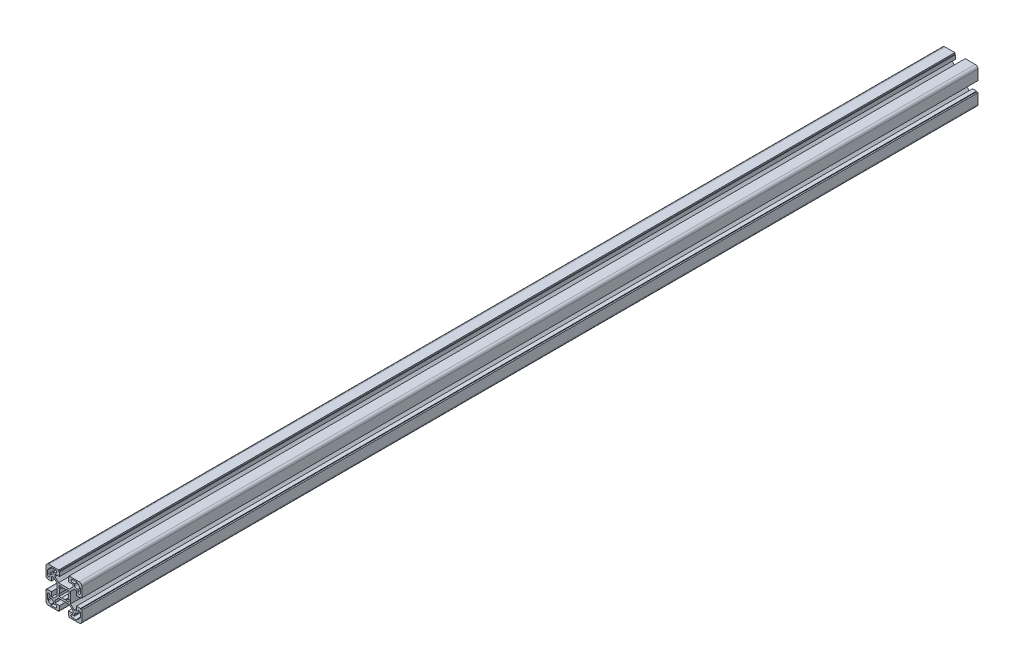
ISO-10303-21;
HEADER;
FILE_DESCRIPTION(('STEP AP214'),'2;1');
FILE_NAME('part.step','',(''),(''),'','','');
FILE_SCHEMA(('AUTOMOTIVE_DESIGN { 1 0 10303 214 1 1 1 1 }'));
ENDSEC;
DATA;
#1=APPLICATION_CONTEXT('core data for automotive mechanical design processes');
#2=APPLICATION_PROTOCOL_DEFINITION('international standard','automotive_design',2000,#1);
#3=PRODUCT_CONTEXT('',#1,'mechanical');
#4=PRODUCT('Part','Part','',(#3));
#5=PRODUCT_RELATED_PRODUCT_CATEGORY('part','',(#4));
#6=PRODUCT_DEFINITION_FORMATION('','',#4);
#7=PRODUCT_DEFINITION_CONTEXT('part definition',#1,'design');
#8=PRODUCT_DEFINITION('design','',#6,#7);
#9=PRODUCT_DEFINITION_SHAPE('','',#8);
#10=(LENGTH_UNIT() NAMED_UNIT(*) SI_UNIT(.MILLI.,.METRE.));
#11=(NAMED_UNIT(*) PLANE_ANGLE_UNIT() SI_UNIT($,.RADIAN.));
#12=(NAMED_UNIT(*) SI_UNIT($,.STERADIAN.) SOLID_ANGLE_UNIT());
#13=UNCERTAINTY_MEASURE_WITH_UNIT(LENGTH_MEASURE(1.E-05),#10,'distance_accuracy_value','');
#14=(GEOMETRIC_REPRESENTATION_CONTEXT(3) GLOBAL_UNCERTAINTY_ASSIGNED_CONTEXT((#13)) GLOBAL_UNIT_ASSIGNED_CONTEXT((#10,
#11,#12)) REPRESENTATION_CONTEXT('',''));
#15=CARTESIAN_POINT('',(0.,0.,0.));
#16=DIRECTION('',(0.,0.,1.));
#17=DIRECTION('',(1.,0.,0.));
#18=AXIS2_PLACEMENT_3D('',#15,#16,#17);
#19=CARTESIAN_POINT('',(-14.5000000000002,-11.75,1000.));
#20=DIRECTION('',(0.,-1.,0.));
#21=DIRECTION('',(1.,0.,0.));
#22=AXIS2_PLACEMENT_3D('',#19,#20,#21);
#23=PLANE('',#22);
#24=DIRECTION('',(1.,0.,0.));
#25=VECTOR('',#24,1.);
#26=CARTESIAN_POINT('',(-14.5000000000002,-11.75,1000.));
#27=LINE('',#26,#25);
#28=CARTESIAN_POINT('',(-14.5000000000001,-11.75,1000.));
#29=VERTEX_POINT('',#28);
#30=CARTESIAN_POINT('',(-15.5000000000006,-11.75,1000.));
#31=VERTEX_POINT('',#30);
#32=EDGE_CURVE('E806',#29,#31,#27,.F.);
#33=ORIENTED_EDGE('',*,*,#32,.T.);
#34=DIRECTION('',(0.,0.,1.));
#35=VECTOR('',#34,1.);
#36=CARTESIAN_POINT('',(-15.5000000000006,-11.75,1000.));
#37=LINE('',#36,#35);
#38=CARTESIAN_POINT('',(-15.5000000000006,-11.75,0.));
#39=VERTEX_POINT('',#38);
#40=EDGE_CURVE('E804',#39,#31,#37,.T.);
#41=ORIENTED_EDGE('',*,*,#40,.F.);
#42=DIRECTION('',(1.,0.,0.));
#43=VECTOR('',#42,1.);
#44=CARTESIAN_POINT('',(-14.5000000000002,-11.75,0.));
#45=LINE('',#44,#43);
#46=CARTESIAN_POINT('',(-14.5000000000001,-11.75,0.));
#47=VERTEX_POINT('',#46);
#48=EDGE_CURVE('E20',#39,#47,#45,.T.);
#49=ORIENTED_EDGE('',*,*,#48,.T.);
#50=DIRECTION('',(0.,0.,-1.));
#51=VECTOR('',#50,1.);
#52=CARTESIAN_POINT('',(-14.5000000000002,-11.75,1000.));
#53=LINE('',#52,#51);
#54=EDGE_CURVE('E801',#47,#29,#53,.F.);
#55=ORIENTED_EDGE('',*,*,#54,.T.);
#56=EDGE_LOOP('',(#33,#41,#49,#55));
#57=FACE_BOUND('',#56,.T.);
#58=ADVANCED_FACE('F17',(#57),#23,.T.);
#59=CARTESIAN_POINT('',(-11.7500000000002,-15.5,1000.));
#60=DIRECTION('',(-1.,0.,0.));
#61=DIRECTION('',(0.,-1.,0.));
#62=AXIS2_PLACEMENT_3D('',#59,#60,#61);
#63=PLANE('',#62);
#64=DIRECTION('',(0.,-1.,0.));
#65=VECTOR('',#64,1.);
#66=CARTESIAN_POINT('',(-11.7500000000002,-15.5,1000.));
#67=LINE('',#66,#65);
#68=CARTESIAN_POINT('',(-11.7500000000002,-15.5,1000.));
#69=VERTEX_POINT('',#68);
#70=CARTESIAN_POINT('',(-11.7500000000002,-14.5,1000.));
#71=VERTEX_POINT('',#70);
#72=EDGE_CURVE('E1218',#69,#71,#67,.F.);
#73=ORIENTED_EDGE('',*,*,#72,.T.);
#74=DIRECTION('',(0.,0.,-1.));
#75=VECTOR('',#74,1.);
#76=CARTESIAN_POINT('',(-11.7500000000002,-14.5,1000.));
#77=LINE('',#76,#75);
#78=CARTESIAN_POINT('',(-11.7500000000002,-14.5,0.));
#79=VERTEX_POINT('',#78);
#80=EDGE_CURVE('E814',#71,#79,#77,.T.);
#81=ORIENTED_EDGE('',*,*,#80,.T.);
#82=DIRECTION('',(0.,-1.,0.));
#83=VECTOR('',#82,1.);
#84=CARTESIAN_POINT('',(-11.7500000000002,-15.5,0.));
#85=LINE('',#84,#83);
#86=CARTESIAN_POINT('',(-11.7500000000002,-15.5,0.));
#87=VERTEX_POINT('',#86);
#88=EDGE_CURVE('E819',#79,#87,#85,.T.);
#89=ORIENTED_EDGE('',*,*,#88,.T.);
#90=DIRECTION('',(0.,0.,-1.));
#91=VECTOR('',#90,1.);
#92=CARTESIAN_POINT('',(-11.7500000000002,-15.5,1000.));
#93=LINE('',#92,#91);
#94=EDGE_CURVE('E1262',#69,#87,#93,.T.);
#95=ORIENTED_EDGE('',*,*,#94,.F.);
#96=EDGE_LOOP('',(#73,#81,#89,#95));
#97=FACE_BOUND('',#96,.T.);
#98=ADVANCED_FACE('F1555',(#97),#63,.T.);
#99=CARTESIAN_POINT('',(-14.5000000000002,-17.25,1000.));
#100=DIRECTION('',(1.,0.,0.));
#101=DIRECTION('',(0.,0.,-1.));
#102=AXIS2_PLACEMENT_3D('',#99,#100,#101);
#103=PLANE('',#102);
#104=DIRECTION('',(0.,1.,0.));
#105=VECTOR('',#104,1.);
#106=CARTESIAN_POINT('',(-14.5000000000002,-17.25,1000.));
#107=LINE('',#106,#105);
#108=CARTESIAN_POINT('',(-14.5000000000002,-17.25,1000.));
#109=VERTEX_POINT('',#108);
#110=CARTESIAN_POINT('',(-14.5000000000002,-18.5,1000.));
#111=VERTEX_POINT('',#110);
#112=EDGE_CURVE('E1214',#109,#111,#107,.F.);
#113=ORIENTED_EDGE('',*,*,#112,.T.);
#114=DIRECTION('',(0.,0.,1.));
#115=VECTOR('',#114,1.);
#116=CARTESIAN_POINT('',(-14.5000000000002,-18.5,1000.));
#117=LINE('',#116,#115);
#118=CARTESIAN_POINT('',(-14.5000000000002,-18.5,0.));
#119=VERTEX_POINT('',#118);
#120=EDGE_CURVE('E1256',#119,#111,#117,.T.);
#121=ORIENTED_EDGE('',*,*,#120,.F.);
#122=DIRECTION('',(0.,1.,0.));
#123=VECTOR('',#122,1.);
#124=CARTESIAN_POINT('',(-14.5000000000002,-17.25,0.));
#125=LINE('',#124,#123);
#126=CARTESIAN_POINT('',(-14.5000000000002,-17.25,0.));
#127=VERTEX_POINT('',#126);
#128=EDGE_CURVE('E1216',#119,#127,#125,.T.);
#129=ORIENTED_EDGE('',*,*,#128,.T.);
#130=DIRECTION('',(0.,0.,-1.));
#131=VECTOR('',#130,1.);
#132=CARTESIAN_POINT('',(-14.5000000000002,-17.25,1000.));
#133=LINE('',#132,#131);
#134=EDGE_CURVE('E1251',#127,#109,#133,.F.);
#135=ORIENTED_EDGE('',*,*,#134,.T.);
#136=EDGE_LOOP('',(#113,#121,#129,#135));
#137=FACE_BOUND('',#136,.T.);
#138=ADVANCED_FACE('F1560',(#137),#103,.T.);
#139=CARTESIAN_POINT('',(-18.5000000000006,-14.5000000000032,1000.));
#140=DIRECTION('',(0.,1.,0.));
#141=DIRECTION('',(0.,0.,1.));
#142=AXIS2_PLACEMENT_3D('',#139,#140,#141);
#143=PLANE('',#142);
#144=DIRECTION('',(1.,0.,0.));
#145=VECTOR('',#144,1.);
#146=CARTESIAN_POINT('',(-18.5000000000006,-14.5000000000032,1000.));
#147=LINE('',#146,#145);
#148=CARTESIAN_POINT('',(-18.5000000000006,-14.5000000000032,1000.));
#149=VERTEX_POINT('',#148);
#150=CARTESIAN_POINT('',(-17.2500000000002,-14.5000000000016,1000.));
#151=VERTEX_POINT('',#150);
#152=EDGE_CURVE('E1210',#149,#151,#147,.T.);
#153=ORIENTED_EDGE('',*,*,#152,.T.);
#154=DIRECTION('',(0.,0.,-1.));
#155=VECTOR('',#154,1.);
#156=CARTESIAN_POINT('',(-17.2500000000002,-14.5,1000.));
#157=LINE('',#156,#155);
#158=CARTESIAN_POINT('',(-17.2500000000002,-14.5000000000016,0.));
#159=VERTEX_POINT('',#158);
#160=EDGE_CURVE('E1248',#151,#159,#157,.T.);
#161=ORIENTED_EDGE('',*,*,#160,.T.);
#162=DIRECTION('',(1.,0.,0.));
#163=VECTOR('',#162,1.);
#164=CARTESIAN_POINT('',(-18.5000000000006,-14.5000000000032,0.));
#165=LINE('',#164,#163);
#166=CARTESIAN_POINT('',(-18.5000000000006,-14.5000000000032,0.));
#167=VERTEX_POINT('',#166);
#168=EDGE_CURVE('E1212',#159,#167,#165,.F.);
#169=ORIENTED_EDGE('',*,*,#168,.T.);
#170=DIRECTION('',(0.,0.,-1.));
#171=VECTOR('',#170,1.);
#172=CARTESIAN_POINT('',(-18.5000000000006,-14.5000000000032,1000.));
#173=LINE('',#172,#171);
#174=EDGE_CURVE('E1242',#149,#167,#173,.T.);
#175=ORIENTED_EDGE('',*,*,#174,.F.);
#176=EDGE_LOOP('',(#153,#161,#169,#175));
#177=FACE_BOUND('',#176,.T.);
#178=ADVANCED_FACE('F1569',(#177),#143,.T.);
#179=CARTESIAN_POINT('',(18.5000000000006,-14.5000000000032,1000.));
#180=DIRECTION('',(0.,1.,0.));
#181=DIRECTION('',(0.,0.,1.));
#182=AXIS2_PLACEMENT_3D('',#179,#180,#181);
#183=PLANE('',#182);
#184=DIRECTION('',(1.,0.,0.));
#185=VECTOR('',#184,1.);
#186=CARTESIAN_POINT('',(18.5000000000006,-14.5000000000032,1000.));
#187=LINE('',#186,#185);
#188=CARTESIAN_POINT('',(17.2500000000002,-14.5000000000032,1000.));
#189=VERTEX_POINT('',#188);
#190=CARTESIAN_POINT('',(18.5000000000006,-14.5000000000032,1000.));
#191=VERTEX_POINT('',#190);
#192=EDGE_CURVE('E1206',#189,#191,#187,.T.);
#193=ORIENTED_EDGE('',*,*,#192,.T.);
#194=DIRECTION('',(0.,0.,1.));
#195=VECTOR('',#194,1.);
#196=CARTESIAN_POINT('',(18.5000000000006,-14.5000000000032,1000.));
#197=LINE('',#196,#195);
#198=CARTESIAN_POINT('',(18.5000000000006,-14.5000000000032,0.));
#199=VERTEX_POINT('',#198);
#200=EDGE_CURVE('E1947',#199,#191,#197,.T.);
#201=ORIENTED_EDGE('',*,*,#200,.F.);
#202=DIRECTION('',(1.,0.,0.));
#203=VECTOR('',#202,1.);
#204=CARTESIAN_POINT('',(18.5000000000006,-14.5000000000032,0.));
#205=LINE('',#204,#203);
#206=CARTESIAN_POINT('',(17.2500000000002,-14.5000000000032,0.));
#207=VERTEX_POINT('',#206);
#208=EDGE_CURVE('E1208',#199,#207,#205,.F.);
#209=ORIENTED_EDGE('',*,*,#208,.T.);
#210=DIRECTION('',(0.,0.,-1.));
#211=VECTOR('',#210,1.);
#212=CARTESIAN_POINT('',(17.2500000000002,-14.5000000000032,1000.));
#213=LINE('',#212,#211);
#214=EDGE_CURVE('E1952',#207,#189,#213,.F.);
#215=ORIENTED_EDGE('',*,*,#214,.T.);
#216=EDGE_LOOP('',(#193,#201,#209,#215));
#217=FACE_BOUND('',#216,.T.);
#218=ADVANCED_FACE('F2472',(#217),#183,.T.);
#219=CARTESIAN_POINT('',(14.5000000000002,-17.25,1000.));
#220=DIRECTION('',(-1.,0.,0.));
#221=DIRECTION('',(0.,0.,1.));
#222=AXIS2_PLACEMENT_3D('',#219,#220,#221);
#223=PLANE('',#222);
#224=DIRECTION('',(0.,1.,0.));
#225=VECTOR('',#224,1.);
#226=CARTESIAN_POINT('',(14.5000000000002,-17.25,1000.));
#227=LINE('',#226,#225);
#228=CARTESIAN_POINT('',(14.5000000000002,-18.5,1000.));
#229=VERTEX_POINT('',#228);
#230=CARTESIAN_POINT('',(14.5000000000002,-17.25,1000.));
#231=VERTEX_POINT('',#230);
#232=EDGE_CURVE('E1202',#229,#231,#227,.T.);
#233=ORIENTED_EDGE('',*,*,#232,.T.);
#234=DIRECTION('',(0.,0.,-1.));
#235=VECTOR('',#234,1.);
#236=CARTESIAN_POINT('',(14.5000000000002,-17.25,1000.));
#237=LINE('',#236,#235);
#238=CARTESIAN_POINT('',(14.5000000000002,-17.25,0.));
#239=VERTEX_POINT('',#238);
#240=EDGE_CURVE('E1955',#231,#239,#237,.T.);
#241=ORIENTED_EDGE('',*,*,#240,.T.);
#242=DIRECTION('',(0.,1.,0.));
#243=VECTOR('',#242,1.);
#244=CARTESIAN_POINT('',(14.5000000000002,-17.25,0.));
#245=LINE('',#244,#243);
#246=CARTESIAN_POINT('',(14.5000000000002,-18.5,0.));
#247=VERTEX_POINT('',#246);
#248=EDGE_CURVE('E1204',#239,#247,#245,.F.);
#249=ORIENTED_EDGE('',*,*,#248,.T.);
#250=DIRECTION('',(0.,0.,1.));
#251=VECTOR('',#250,1.);
#252=CARTESIAN_POINT('',(14.5000000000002,-18.5,1000.));
#253=LINE('',#252,#251);
#254=EDGE_CURVE('E1958',#229,#247,#253,.F.);
#255=ORIENTED_EDGE('',*,*,#254,.F.);
#256=EDGE_LOOP('',(#233,#241,#249,#255));
#257=FACE_BOUND('',#256,.T.);
#258=ADVANCED_FACE('F2468',(#257),#223,.T.);
#259=CARTESIAN_POINT('',(11.7500000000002,-15.5,1000.));
#260=DIRECTION('',(1.,0.,0.));
#261=DIRECTION('',(0.,1.,0.));
#262=AXIS2_PLACEMENT_3D('',#259,#260,#261);
#263=PLANE('',#262);
#264=DIRECTION('',(0.,1.,0.));
#265=VECTOR('',#264,1.);
#266=CARTESIAN_POINT('',(11.7500000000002,-15.5,1000.));
#267=LINE('',#266,#265);
#268=CARTESIAN_POINT('',(11.7500000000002,-14.5,1000.));
#269=VERTEX_POINT('',#268);
#270=CARTESIAN_POINT('',(11.7500000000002,-15.5,1000.));
#271=VERTEX_POINT('',#270);
#272=EDGE_CURVE('E1198',#269,#271,#267,.F.);
#273=ORIENTED_EDGE('',*,*,#272,.T.);
#274=DIRECTION('',(0.,0.,-1.));
#275=VECTOR('',#274,1.);
#276=CARTESIAN_POINT('',(11.7500000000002,-15.5,1000.));
#277=LINE('',#276,#275);
#278=CARTESIAN_POINT('',(11.7500000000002,-15.5,0.));
#279=VERTEX_POINT('',#278);
#280=EDGE_CURVE('E1964',#279,#271,#277,.F.);
#281=ORIENTED_EDGE('',*,*,#280,.F.);
#282=DIRECTION('',(0.,1.,0.));
#283=VECTOR('',#282,1.);
#284=CARTESIAN_POINT('',(11.7500000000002,-15.5,0.));
#285=LINE('',#284,#283);
#286=CARTESIAN_POINT('',(11.7500000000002,-14.5,0.));
#287=VERTEX_POINT('',#286);
#288=EDGE_CURVE('E1200',#279,#287,#285,.T.);
#289=ORIENTED_EDGE('',*,*,#288,.T.);
#290=DIRECTION('',(0.,0.,-1.));
#291=VECTOR('',#290,1.);
#292=CARTESIAN_POINT('',(11.7500000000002,-14.5,1000.));
#293=LINE('',#292,#291);
#294=EDGE_CURVE('E1969',#287,#269,#293,.F.);
#295=ORIENTED_EDGE('',*,*,#294,.T.);
#296=EDGE_LOOP('',(#273,#281,#289,#295));
#297=FACE_BOUND('',#296,.T.);
#298=ADVANCED_FACE('F2465',(#297),#263,.T.);
#299=CARTESIAN_POINT('',(14.5000000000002,-11.75,1000.));
#300=DIRECTION('',(0.,-1.,0.));
#301=DIRECTION('',(1.,0.,0.));
#302=AXIS2_PLACEMENT_3D('',#299,#300,#301);
#303=PLANE('',#302);
#304=DIRECTION('',(1.,0.,0.));
#305=VECTOR('',#304,1.);
#306=CARTESIAN_POINT('',(14.5000000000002,-11.75,1000.));
#307=LINE('',#306,#305);
#308=CARTESIAN_POINT('',(15.5000000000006,-11.75,1000.));
#309=VERTEX_POINT('',#308);
#310=CARTESIAN_POINT('',(14.5000000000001,-11.75,1000.));
#311=VERTEX_POINT('',#310);
#312=EDGE_CURVE('E1194',#309,#311,#307,.F.);
#313=ORIENTED_EDGE('',*,*,#312,.T.);
#314=DIRECTION('',(0.,0.,-1.));
#315=VECTOR('',#314,1.);
#316=CARTESIAN_POINT('',(14.5000000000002,-11.75,1000.));
#317=LINE('',#316,#315);
#318=CARTESIAN_POINT('',(14.5000000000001,-11.75,0.));
#319=VERTEX_POINT('',#318);
#320=EDGE_CURVE('E1940',#311,#319,#317,.T.);
#321=ORIENTED_EDGE('',*,*,#320,.T.);
#322=DIRECTION('',(1.,0.,0.));
#323=VECTOR('',#322,1.);
#324=CARTESIAN_POINT('',(14.5000000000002,-11.75,0.));
#325=LINE('',#324,#323);
#326=CARTESIAN_POINT('',(15.5000000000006,-11.75,0.));
#327=VERTEX_POINT('',#326);
#328=EDGE_CURVE('E1196',#319,#327,#325,.T.);
#329=ORIENTED_EDGE('',*,*,#328,.T.);
#330=DIRECTION('',(0.,0.,-1.));
#331=VECTOR('',#330,1.);
#332=CARTESIAN_POINT('',(15.5000000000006,-11.75,1000.));
#333=LINE('',#332,#331);
#334=EDGE_CURVE('E1237',#309,#327,#333,.T.);
#335=ORIENTED_EDGE('',*,*,#334,.F.);
#336=EDGE_LOOP('',(#313,#321,#329,#335));
#337=FACE_BOUND('',#336,.T.);
#338=ADVANCED_FACE('F1939',(#337),#303,.T.);
#339=CARTESIAN_POINT('',(5.80000000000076,-18.5000000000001,1000.));
#340=DIRECTION('',(1.,0.,0.));
#341=DIRECTION('',(0.,0.,-1.));
#342=AXIS2_PLACEMENT_3D('',#339,#340,#341);
#343=PLANE('',#342);
#344=DIRECTION('',(0.,0.,1.));
#345=VECTOR('',#344,1.);
#346=CARTESIAN_POINT('',(5.80000000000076,-20.,1000.));
#347=LINE('',#346,#345);
#348=CARTESIAN_POINT('',(5.80000000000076,-20.,0.));
#349=VERTEX_POINT('',#348);
#350=CARTESIAN_POINT('',(5.80000000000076,-20.,1000.));
#351=VERTEX_POINT('',#350);
#352=EDGE_CURVE('E1973',#349,#351,#347,.T.);
#353=ORIENTED_EDGE('',*,*,#352,.T.);
#354=DIRECTION('',(0.,1.,0.));
#355=VECTOR('',#354,1.);
#356=CARTESIAN_POINT('',(5.80000000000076,-17.,1000.));
#357=LINE('',#356,#355);
#358=CARTESIAN_POINT('',(5.80000000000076,-18.5000000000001,1000.));
#359=VERTEX_POINT('',#358);
#360=EDGE_CURVE('E1192',#359,#351,#357,.F.);
#361=ORIENTED_EDGE('',*,*,#360,.F.);
#362=DIRECTION('',(0.,0.,1.));
#363=VECTOR('',#362,1.);
#364=CARTESIAN_POINT('',(5.80000000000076,-18.5000000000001,1000.));
#365=LINE('',#364,#363);
#366=CARTESIAN_POINT('',(5.80000000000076,-18.5000000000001,0.));
#367=VERTEX_POINT('',#366);
#368=EDGE_CURVE('E1116',#359,#367,#365,.F.);
#369=ORIENTED_EDGE('',*,*,#368,.T.);
#370=DIRECTION('',(0.,1.,0.));
#371=VECTOR('',#370,1.);
#372=CARTESIAN_POINT('',(5.80000000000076,-17.,0.));
#373=LINE('',#372,#371);
#374=EDGE_CURVE('E1190',#349,#367,#373,.T.);
#375=ORIENTED_EDGE('',*,*,#374,.F.);
#376=EDGE_LOOP('',(#353,#361,#369,#375));
#377=FACE_BOUND('',#376,.T.);
#378=ADVANCED_FACE('F2286',(#377),#343,.F.);
#379=CARTESIAN_POINT('',(20.,-5.79999999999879,1000.));
#380=DIRECTION('',(0.,-1.,0.));
#381=DIRECTION('',(0.,0.,-1.));
#382=AXIS2_PLACEMENT_3D('',#379,#380,#381);
#383=PLANE('',#382);
#384=DIRECTION('',(0.,0.,1.));
#385=VECTOR('',#384,1.);
#386=CARTESIAN_POINT('',(18.5,-5.79999999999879,1000.));
#387=LINE('',#386,#385);
#388=CARTESIAN_POINT('',(18.5,-5.79999999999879,0.));
#389=VERTEX_POINT('',#388);
#390=CARTESIAN_POINT('',(18.5,-5.79999999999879,1000.));
#391=VERTEX_POINT('',#390);
#392=EDGE_CURVE('E1185',#389,#391,#387,.T.);
#393=ORIENTED_EDGE('',*,*,#392,.T.);
#394=DIRECTION('',(1.,0.,0.));
#395=VECTOR('',#394,1.);
#396=CARTESIAN_POINT('',(17.,-5.79999999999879,1000.));
#397=LINE('',#396,#395);
#398=CARTESIAN_POINT('',(20.,-5.79999999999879,1000.));
#399=VERTEX_POINT('',#398);
#400=EDGE_CURVE('E1188',#399,#391,#397,.F.);
#401=ORIENTED_EDGE('',*,*,#400,.F.);
#402=DIRECTION('',(0.,0.,1.));
#403=VECTOR('',#402,1.);
#404=CARTESIAN_POINT('',(20.,-5.79999999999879,1000.));
#405=LINE('',#404,#403);
#406=CARTESIAN_POINT('',(20.,-5.79999999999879,0.));
#407=VERTEX_POINT('',#406);
#408=EDGE_CURVE('E1981',#399,#407,#405,.F.);
#409=ORIENTED_EDGE('',*,*,#408,.T.);
#410=DIRECTION('',(1.,0.,0.));
#411=VECTOR('',#410,1.);
#412=CARTESIAN_POINT('',(17.,-5.79999999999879,0.));
#413=LINE('',#412,#411);
#414=EDGE_CURVE('E1186',#389,#407,#413,.T.);
#415=ORIENTED_EDGE('',*,*,#414,.F.);
#416=EDGE_LOOP('',(#393,#401,#409,#415));
#417=FACE_BOUND('',#416,.T.);
#418=ADVANCED_FACE('F2294',(#417),#383,.F.);
#419=CARTESIAN_POINT('',(18.5,-5.79999999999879,1000.));
#420=DIRECTION('',(-1.,0.,0.));
#421=DIRECTION('',(0.,0.,1.));
#422=AXIS2_PLACEMENT_3D('',#419,#420,#421);
#423=PLANE('',#422);
#424=DIRECTION('',(0.,0.,-1.));
#425=VECTOR('',#424,1.);
#426=CARTESIAN_POINT('',(18.5,-4.99999999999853,1000.));
#427=LINE('',#426,#425);
#428=CARTESIAN_POINT('',(18.5,-4.99999999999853,0.));
#429=VERTEX_POINT('',#428);
#430=CARTESIAN_POINT('',(18.5,-4.99999999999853,1000.));
#431=VERTEX_POINT('',#430);
#432=EDGE_CURVE('E1984',#429,#431,#427,.F.);
#433=ORIENTED_EDGE('',*,*,#432,.T.);
#434=DIRECTION('',(0.,1.,0.));
#435=VECTOR('',#434,1.);
#436=CARTESIAN_POINT('',(18.5,-17.,1000.));
#437=LINE('',#436,#435);
#438=EDGE_CURVE('E1183',#391,#431,#437,.T.);
#439=ORIENTED_EDGE('',*,*,#438,.F.);
#440=ORIENTED_EDGE('',*,*,#392,.F.);
#441=DIRECTION('',(0.,1.,0.));
#442=VECTOR('',#441,1.);
#443=CARTESIAN_POINT('',(18.5,-17.,0.));
#444=LINE('',#443,#442);
#445=EDGE_CURVE('E1180',#429,#389,#444,.F.);
#446=ORIENTED_EDGE('',*,*,#445,.F.);
#447=EDGE_LOOP('',(#433,#439,#440,#446));
#448=FACE_BOUND('',#447,.T.);
#449=ADVANCED_FACE('F2297',(#448),#423,.F.);
#450=CARTESIAN_POINT('',(18.5,5.79999999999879,1000.));
#451=DIRECTION('',(-1.,0.,0.));
#452=DIRECTION('',(0.,0.,1.));
#453=AXIS2_PLACEMENT_3D('',#450,#451,#452);
#454=PLANE('',#453);
#455=DIRECTION('',(0.,0.,1.));
#456=VECTOR('',#455,1.);
#457=CARTESIAN_POINT('',(18.5,5.79999999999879,1000.));
#458=LINE('',#457,#456);
#459=CARTESIAN_POINT('',(18.5,5.79999999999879,0.));
#460=VERTEX_POINT('',#459);
#461=CARTESIAN_POINT('',(18.5,5.79999999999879,1000.));
#462=VERTEX_POINT('',#461);
#463=EDGE_CURVE('E1175',#460,#462,#458,.T.);
#464=ORIENTED_EDGE('',*,*,#463,.T.);
#465=DIRECTION('',(0.,1.,0.));
#466=VECTOR('',#465,1.);
#467=CARTESIAN_POINT('',(18.5,-17.,1000.));
#468=LINE('',#467,#466);
#469=CARTESIAN_POINT('',(18.5,4.99999999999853,1000.));
#470=VERTEX_POINT('',#469);
#471=EDGE_CURVE('E1178',#470,#462,#468,.T.);
#472=ORIENTED_EDGE('',*,*,#471,.F.);
#473=DIRECTION('',(0.,0.,1.));
#474=VECTOR('',#473,1.);
#475=CARTESIAN_POINT('',(18.5,4.99999999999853,1000.));
#476=LINE('',#475,#474);
#477=CARTESIAN_POINT('',(18.5,4.99999999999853,0.));
#478=VERTEX_POINT('',#477);
#479=EDGE_CURVE('E2011',#470,#478,#476,.F.);
#480=ORIENTED_EDGE('',*,*,#479,.T.);
#481=DIRECTION('',(0.,1.,0.));
#482=VECTOR('',#481,1.);
#483=CARTESIAN_POINT('',(18.5,-17.,0.));
#484=LINE('',#483,#482);
#485=EDGE_CURVE('E1176',#460,#478,#484,.F.);
#486=ORIENTED_EDGE('',*,*,#485,.F.);
#487=EDGE_LOOP('',(#464,#472,#480,#486));
#488=FACE_BOUND('',#487,.T.);
#489=ADVANCED_FACE('F2319',(#488),#454,.F.);
#490=CARTESIAN_POINT('',(20.,5.79999999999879,1000.));
#491=DIRECTION('',(0.,1.,0.));
#492=DIRECTION('',(0.,0.,1.));
#493=AXIS2_PLACEMENT_3D('',#490,#491,#492);
#494=PLANE('',#493);
#495=DIRECTION('',(0.,0.,1.));
#496=VECTOR('',#495,1.);
#497=CARTESIAN_POINT('',(20.,5.79999999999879,1000.));
#498=LINE('',#497,#496);
#499=CARTESIAN_POINT('',(20.,5.79999999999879,0.));
#500=VERTEX_POINT('',#499);
#501=CARTESIAN_POINT('',(20.,5.79999999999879,1000.));
#502=VERTEX_POINT('',#501);
#503=EDGE_CURVE('E2014',#500,#502,#498,.T.);
#504=ORIENTED_EDGE('',*,*,#503,.T.);
#505=DIRECTION('',(1.,0.,0.));
#506=VECTOR('',#505,1.);
#507=CARTESIAN_POINT('',(17.,5.79999999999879,1000.));
#508=LINE('',#507,#506);
#509=EDGE_CURVE('E1173',#462,#502,#508,.T.);
#510=ORIENTED_EDGE('',*,*,#509,.F.);
#511=ORIENTED_EDGE('',*,*,#463,.F.);
#512=DIRECTION('',(1.,0.,0.));
#513=VECTOR('',#512,1.);
#514=CARTESIAN_POINT('',(17.,5.79999999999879,0.));
#515=LINE('',#514,#513);
#516=EDGE_CURVE('E1170',#500,#460,#515,.F.);
#517=ORIENTED_EDGE('',*,*,#516,.F.);
#518=EDGE_LOOP('',(#504,#510,#511,#517));
#519=FACE_BOUND('',#518,.T.);
#520=ADVANCED_FACE('F2323',(#519),#494,.F.);
#521=CARTESIAN_POINT('',(5.80000000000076,18.5000000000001,1000.));
#522=DIRECTION('',(1.,0.,0.));
#523=DIRECTION('',(0.,0.,-1.));
#524=AXIS2_PLACEMENT_3D('',#521,#522,#523);
#525=PLANE('',#524);
#526=DIRECTION('',(0.,0.,-1.));
#527=VECTOR('',#526,1.);
#528=CARTESIAN_POINT('',(5.80000000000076,18.5000000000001,1000.));
#529=LINE('',#528,#527);
#530=CARTESIAN_POINT('',(5.80000000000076,18.5000000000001,0.));
#531=VERTEX_POINT('',#530);
#532=CARTESIAN_POINT('',(5.80000000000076,18.5000000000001,1000.));
#533=VERTEX_POINT('',#532);
#534=EDGE_CURVE('E1165',#531,#533,#529,.F.);
#535=ORIENTED_EDGE('',*,*,#534,.T.);
#536=DIRECTION('',(0.,1.,0.));
#537=VECTOR('',#536,1.);
#538=CARTESIAN_POINT('',(5.80000000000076,-17.,1000.));
#539=LINE('',#538,#537);
#540=CARTESIAN_POINT('',(5.80000000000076,20.,1000.));
#541=VERTEX_POINT('',#540);
#542=EDGE_CURVE('E1168',#541,#533,#539,.F.);
#543=ORIENTED_EDGE('',*,*,#542,.F.);
#544=DIRECTION('',(0.,0.,-1.));
#545=VECTOR('',#544,1.);
#546=CARTESIAN_POINT('',(5.80000000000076,20.,1000.));
#547=LINE('',#546,#545);
#548=CARTESIAN_POINT('',(5.80000000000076,20.,0.));
#549=VERTEX_POINT('',#548);
#550=EDGE_CURVE('E2022',#541,#549,#547,.T.);
#551=ORIENTED_EDGE('',*,*,#550,.T.);
#552=DIRECTION('',(0.,1.,0.));
#553=VECTOR('',#552,1.);
#554=CARTESIAN_POINT('',(5.80000000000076,-17.,0.));
#555=LINE('',#554,#553);
#556=EDGE_CURVE('E1166',#531,#549,#555,.T.);
#557=ORIENTED_EDGE('',*,*,#556,.F.);
#558=EDGE_LOOP('',(#535,#543,#551,#557));
#559=FACE_BOUND('',#558,.T.);
#560=ADVANCED_FACE('F2334',(#559),#525,.F.);
#561=CARTESIAN_POINT('',(5.00000000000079,18.5000000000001,1000.));
#562=DIRECTION('',(0.,-1.,0.));
#563=DIRECTION('',(0.,0.,-1.));
#564=AXIS2_PLACEMENT_3D('',#561,#562,#563);
#565=PLANE('',#564);
#566=DIRECTION('',(0.,0.,1.));
#567=VECTOR('',#566,1.);
#568=CARTESIAN_POINT('',(5.00000000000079,18.5000000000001,1000.));
#569=LINE('',#568,#567);
#570=CARTESIAN_POINT('',(5.00000000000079,18.5000000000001,0.));
#571=VERTEX_POINT('',#570);
#572=CARTESIAN_POINT('',(5.00000000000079,18.5000000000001,1000.));
#573=VERTEX_POINT('',#572);
#574=EDGE_CURVE('E2025',#571,#573,#569,.T.);
#575=ORIENTED_EDGE('',*,*,#574,.T.);
#576=DIRECTION('',(1.,0.,0.));
#577=VECTOR('',#576,1.);
#578=CARTESIAN_POINT('',(17.,18.5000000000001,1000.));
#579=LINE('',#578,#577);
#580=EDGE_CURVE('E1163',#533,#573,#579,.F.);
#581=ORIENTED_EDGE('',*,*,#580,.F.);
#582=ORIENTED_EDGE('',*,*,#534,.F.);
#583=DIRECTION('',(1.,0.,0.));
#584=VECTOR('',#583,1.);
#585=CARTESIAN_POINT('',(17.,18.5000000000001,0.));
#586=LINE('',#585,#584);
#587=EDGE_CURVE('E1160',#571,#531,#586,.T.);
#588=ORIENTED_EDGE('',*,*,#587,.F.);
#589=EDGE_LOOP('',(#575,#581,#582,#588));
#590=FACE_BOUND('',#589,.T.);
#591=ADVANCED_FACE('F2338',(#590),#565,.F.);
#592=CARTESIAN_POINT('',(-5.00000000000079,18.5000000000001,1000.));
#593=DIRECTION('',(0.,-1.,0.));
#594=DIRECTION('',(0.,0.,-1.));
#595=AXIS2_PLACEMENT_3D('',#592,#593,#594);
#596=PLANE('',#595);
#597=DIRECTION('',(0.,0.,1.));
#598=VECTOR('',#597,1.);
#599=CARTESIAN_POINT('',(-5.80000000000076,18.5000000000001,1000.));
#600=LINE('',#599,#598);
#601=CARTESIAN_POINT('',(-5.80000000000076,18.5000000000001,0.));
#602=VERTEX_POINT('',#601);
#603=CARTESIAN_POINT('',(-5.80000000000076,18.5000000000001,1000.));
#604=VERTEX_POINT('',#603);
#605=EDGE_CURVE('E1155',#602,#604,#600,.T.);
#606=ORIENTED_EDGE('',*,*,#605,.T.);
#607=DIRECTION('',(1.,0.,0.));
#608=VECTOR('',#607,1.);
#609=CARTESIAN_POINT('',(17.,18.5000000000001,1000.));
#610=LINE('',#609,#608);
#611=CARTESIAN_POINT('',(-5.00000000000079,18.5000000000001,1000.));
#612=VERTEX_POINT('',#611);
#613=EDGE_CURVE('E1158',#612,#604,#610,.F.);
#614=ORIENTED_EDGE('',*,*,#613,.F.);
#615=DIRECTION('',(0.,0.,1.));
#616=VECTOR('',#615,1.);
#617=CARTESIAN_POINT('',(-5.00000000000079,18.5000000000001,1000.));
#618=LINE('',#617,#616);
#619=CARTESIAN_POINT('',(-5.00000000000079,18.5000000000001,0.));
#620=VERTEX_POINT('',#619);
#621=EDGE_CURVE('E2052',#612,#620,#618,.F.);
#622=ORIENTED_EDGE('',*,*,#621,.T.);
#623=DIRECTION('',(1.,0.,0.));
#624=VECTOR('',#623,1.);
#625=CARTESIAN_POINT('',(17.,18.5000000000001,0.));
#626=LINE('',#625,#624);
#627=EDGE_CURVE('E1156',#602,#620,#626,.T.);
#628=ORIENTED_EDGE('',*,*,#627,.F.);
#629=EDGE_LOOP('',(#606,#614,#622,#628));
#630=FACE_BOUND('',#629,.T.);
#631=ADVANCED_FACE('F2360',(#630),#596,.F.);
#632=CARTESIAN_POINT('',(-5.80000000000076,18.5000000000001,1000.));
#633=DIRECTION('',(-1.,0.,0.));
#634=DIRECTION('',(0.,0.,1.));
#635=AXIS2_PLACEMENT_3D('',#632,#633,#634);
#636=PLANE('',#635);
#637=DIRECTION('',(0.,0.,1.));
#638=VECTOR('',#637,1.);
#639=CARTESIAN_POINT('',(-5.80000000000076,20.,1000.));
#640=LINE('',#639,#638);
#641=CARTESIAN_POINT('',(-5.80000000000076,20.,0.));
#642=VERTEX_POINT('',#641);
#643=CARTESIAN_POINT('',(-5.80000000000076,20.,1000.));
#644=VERTEX_POINT('',#643);
#645=EDGE_CURVE('E2055',#642,#644,#640,.T.);
#646=ORIENTED_EDGE('',*,*,#645,.T.);
#647=DIRECTION('',(0.,1.,0.));
#648=VECTOR('',#647,1.);
#649=CARTESIAN_POINT('',(-5.80000000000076,-17.,1000.));
#650=LINE('',#649,#648);
#651=EDGE_CURVE('E1153',#604,#644,#650,.T.);
#652=ORIENTED_EDGE('',*,*,#651,.F.);
#653=ORIENTED_EDGE('',*,*,#605,.F.);
#654=DIRECTION('',(0.,1.,0.));
#655=VECTOR('',#654,1.);
#656=CARTESIAN_POINT('',(-5.80000000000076,-17.,0.));
#657=LINE('',#656,#655);
#658=EDGE_CURVE('E1150',#642,#602,#657,.F.);
#659=ORIENTED_EDGE('',*,*,#658,.F.);
#660=EDGE_LOOP('',(#646,#652,#653,#659));
#661=FACE_BOUND('',#660,.T.);
#662=ADVANCED_FACE('F2364',(#661),#636,.F.);
#663=CARTESIAN_POINT('',(-20.,5.79999999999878,1000.));
#664=DIRECTION('',(0.,1.,0.));
#665=DIRECTION('',(0.,0.,1.));
#666=AXIS2_PLACEMENT_3D('',#663,#664,#665);
#667=PLANE('',#666);
#668=DIRECTION('',(0.,0.,-1.));
#669=VECTOR('',#668,1.);
#670=CARTESIAN_POINT('',(-18.5,5.79999999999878,1000.));
#671=LINE('',#670,#669);
#672=CARTESIAN_POINT('',(-18.5,5.79999999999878,0.));
#673=VERTEX_POINT('',#672);
#674=CARTESIAN_POINT('',(-18.5,5.79999999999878,1000.));
#675=VERTEX_POINT('',#674);
#676=EDGE_CURVE('E1145',#673,#675,#671,.F.);
#677=ORIENTED_EDGE('',*,*,#676,.T.);
#678=DIRECTION('',(1.,0.,0.));
#679=VECTOR('',#678,1.);
#680=CARTESIAN_POINT('',(17.,5.79999999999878,1000.));
#681=LINE('',#680,#679);
#682=CARTESIAN_POINT('',(-20.,5.79999999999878,1000.));
#683=VERTEX_POINT('',#682);
#684=EDGE_CURVE('E1148',#683,#675,#681,.T.);
#685=ORIENTED_EDGE('',*,*,#684,.F.);
#686=DIRECTION('',(0.,0.,1.));
#687=VECTOR('',#686,1.);
#688=CARTESIAN_POINT('',(-20.,5.79999999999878,1000.));
#689=LINE('',#688,#687);
#690=CARTESIAN_POINT('',(-20.,5.79999999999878,0.));
#691=VERTEX_POINT('',#690);
#692=EDGE_CURVE('E2063',#683,#691,#689,.F.);
#693=ORIENTED_EDGE('',*,*,#692,.T.);
#694=DIRECTION('',(1.,0.,0.));
#695=VECTOR('',#694,1.);
#696=CARTESIAN_POINT('',(17.,5.79999999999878,0.));
#697=LINE('',#696,#695);
#698=EDGE_CURVE('E1146',#673,#691,#697,.F.);
#699=ORIENTED_EDGE('',*,*,#698,.F.);
#700=EDGE_LOOP('',(#677,#685,#693,#699));
#701=FACE_BOUND('',#700,.T.);
#702=ADVANCED_FACE('F2375',(#701),#667,.F.);
#703=CARTESIAN_POINT('',(-18.5,5.79999999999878,1000.));
#704=DIRECTION('',(1.,0.,0.));
#705=DIRECTION('',(0.,0.,-1.));
#706=AXIS2_PLACEMENT_3D('',#703,#704,#705);
#707=PLANE('',#706);
#708=DIRECTION('',(0.,0.,1.));
#709=VECTOR('',#708,1.);
#710=CARTESIAN_POINT('',(-18.5,4.99999999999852,1000.));
#711=LINE('',#710,#709);
#712=CARTESIAN_POINT('',(-18.5,4.99999999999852,0.));
#713=VERTEX_POINT('',#712);
#714=CARTESIAN_POINT('',(-18.5,4.99999999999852,1000.));
#715=VERTEX_POINT('',#714);
#716=EDGE_CURVE('E2066',#713,#715,#711,.T.);
#717=ORIENTED_EDGE('',*,*,#716,.T.);
#718=DIRECTION('',(0.,1.,0.));
#719=VECTOR('',#718,1.);
#720=CARTESIAN_POINT('',(-18.5,-17.,1000.));
#721=LINE('',#720,#719);
#722=EDGE_CURVE('E1143',#675,#715,#721,.F.);
#723=ORIENTED_EDGE('',*,*,#722,.F.);
#724=ORIENTED_EDGE('',*,*,#676,.F.);
#725=DIRECTION('',(0.,1.,0.));
#726=VECTOR('',#725,1.);
#727=CARTESIAN_POINT('',(-18.5,-17.,0.));
#728=LINE('',#727,#726);
#729=EDGE_CURVE('E1140',#713,#673,#728,.T.);
#730=ORIENTED_EDGE('',*,*,#729,.F.);
#731=EDGE_LOOP('',(#717,#723,#724,#730));
#732=FACE_BOUND('',#731,.T.);
#733=ADVANCED_FACE('F2379',(#732),#707,.F.);
#734=CARTESIAN_POINT('',(-18.5,-5.79999999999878,1000.));
#735=DIRECTION('',(1.,0.,0.));
#736=DIRECTION('',(0.,0.,-1.));
#737=AXIS2_PLACEMENT_3D('',#734,#735,#736);
#738=PLANE('',#737);
#739=DIRECTION('',(0.,0.,-1.));
#740=VECTOR('',#739,1.);
#741=CARTESIAN_POINT('',(-18.5,-5.79999999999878,1000.));
#742=LINE('',#741,#740);
#743=CARTESIAN_POINT('',(-18.5,-5.79999999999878,0.));
#744=VERTEX_POINT('',#743);
#745=CARTESIAN_POINT('',(-18.5,-5.79999999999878,1000.));
#746=VERTEX_POINT('',#745);
#747=EDGE_CURVE('E1135',#744,#746,#742,.F.);
#748=ORIENTED_EDGE('',*,*,#747,.T.);
#749=DIRECTION('',(0.,1.,0.));
#750=VECTOR('',#749,1.);
#751=CARTESIAN_POINT('',(-18.5,-17.,1000.));
#752=LINE('',#751,#750);
#753=CARTESIAN_POINT('',(-18.5,-4.99999999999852,1000.));
#754=VERTEX_POINT('',#753);
#755=EDGE_CURVE('E1138',#754,#746,#752,.F.);
#756=ORIENTED_EDGE('',*,*,#755,.F.);
#757=DIRECTION('',(0.,0.,1.));
#758=VECTOR('',#757,1.);
#759=CARTESIAN_POINT('',(-18.5,-4.99999999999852,1000.));
#760=LINE('',#759,#758);
#761=CARTESIAN_POINT('',(-18.5,-4.99999999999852,0.));
#762=VERTEX_POINT('',#761);
#763=EDGE_CURVE('E2093',#754,#762,#760,.F.);
#764=ORIENTED_EDGE('',*,*,#763,.T.);
#765=DIRECTION('',(0.,1.,0.));
#766=VECTOR('',#765,1.);
#767=CARTESIAN_POINT('',(-18.5,-17.,0.));
#768=LINE('',#767,#766);
#769=EDGE_CURVE('E1136',#744,#762,#768,.T.);
#770=ORIENTED_EDGE('',*,*,#769,.F.);
#771=EDGE_LOOP('',(#748,#756,#764,#770));
#772=FACE_BOUND('',#771,.T.);
#773=ADVANCED_FACE('F2401',(#772),#738,.F.);
#774=CARTESIAN_POINT('',(-20.,-5.79999999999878,1000.));
#775=DIRECTION('',(0.,-1.,0.));
#776=DIRECTION('',(0.,0.,-1.));
#777=AXIS2_PLACEMENT_3D('',#774,#775,#776);
#778=PLANE('',#777);
#779=DIRECTION('',(0.,0.,1.));
#780=VECTOR('',#779,1.);
#781=CARTESIAN_POINT('',(-20.,-5.79999999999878,1000.));
#782=LINE('',#781,#780);
#783=CARTESIAN_POINT('',(-20.,-5.79999999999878,0.));
#784=VERTEX_POINT('',#783);
#785=CARTESIAN_POINT('',(-20.,-5.79999999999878,1000.));
#786=VERTEX_POINT('',#785);
#787=EDGE_CURVE('E2096',#784,#786,#782,.T.);
#788=ORIENTED_EDGE('',*,*,#787,.T.);
#789=DIRECTION('',(1.,0.,0.));
#790=VECTOR('',#789,1.);
#791=CARTESIAN_POINT('',(17.,-5.79999999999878,1000.));
#792=LINE('',#791,#790);
#793=EDGE_CURVE('E1133',#746,#786,#792,.F.);
#794=ORIENTED_EDGE('',*,*,#793,.F.);
#795=ORIENTED_EDGE('',*,*,#747,.F.);
#796=DIRECTION('',(1.,0.,0.));
#797=VECTOR('',#796,1.);
#798=CARTESIAN_POINT('',(17.,-5.79999999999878,0.));
#799=LINE('',#798,#797);
#800=EDGE_CURVE('E1130',#784,#744,#799,.T.);
#801=ORIENTED_EDGE('',*,*,#800,.F.);
#802=EDGE_LOOP('',(#788,#794,#795,#801));
#803=FACE_BOUND('',#802,.T.);
#804=ADVANCED_FACE('F2405',(#803),#778,.F.);
#805=CARTESIAN_POINT('',(-5.80000000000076,-18.5000000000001,1000.));
#806=DIRECTION('',(-1.,0.,0.));
#807=DIRECTION('',(0.,0.,1.));
#808=AXIS2_PLACEMENT_3D('',#805,#806,#807);
#809=PLANE('',#808);
#810=DIRECTION('',(0.,0.,1.));
#811=VECTOR('',#810,1.);
#812=CARTESIAN_POINT('',(-5.80000000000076,-18.5000000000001,1000.));
#813=LINE('',#812,#811);
#814=CARTESIAN_POINT('',(-5.80000000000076,-18.5000000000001,0.));
#815=VERTEX_POINT('',#814);
#816=CARTESIAN_POINT('',(-5.80000000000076,-18.5000000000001,1000.));
#817=VERTEX_POINT('',#816);
#818=EDGE_CURVE('E1125',#815,#817,#813,.T.);
#819=ORIENTED_EDGE('',*,*,#818,.T.);
#820=DIRECTION('',(0.,1.,0.));
#821=VECTOR('',#820,1.);
#822=CARTESIAN_POINT('',(-5.80000000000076,-17.,1000.));
#823=LINE('',#822,#821);
#824=CARTESIAN_POINT('',(-5.80000000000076,-20.,1000.));
#825=VERTEX_POINT('',#824);
#826=EDGE_CURVE('E1128',#825,#817,#823,.T.);
#827=ORIENTED_EDGE('',*,*,#826,.F.);
#828=DIRECTION('',(0.,0.,1.));
#829=VECTOR('',#828,1.);
#830=CARTESIAN_POINT('',(-5.80000000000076,-20.,1000.));
#831=LINE('',#830,#829);
#832=CARTESIAN_POINT('',(-5.80000000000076,-20.,0.));
#833=VERTEX_POINT('',#832);
#834=EDGE_CURVE('E2104',#825,#833,#831,.F.);
#835=ORIENTED_EDGE('',*,*,#834,.T.);
#836=DIRECTION('',(0.,1.,0.));
#837=VECTOR('',#836,1.);
#838=CARTESIAN_POINT('',(-5.80000000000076,-17.,0.));
#839=LINE('',#838,#837);
#840=EDGE_CURVE('E1126',#815,#833,#839,.F.);
#841=ORIENTED_EDGE('',*,*,#840,.F.);
#842=EDGE_LOOP('',(#819,#827,#835,#841));
#843=FACE_BOUND('',#842,.T.);
#844=ADVANCED_FACE('F2416',(#843),#809,.F.);
#845=CARTESIAN_POINT('',(-5.00000000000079,-18.5000000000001,1000.));
#846=DIRECTION('',(0.,1.,0.));
#847=DIRECTION('',(0.,0.,1.));
#848=AXIS2_PLACEMENT_3D('',#845,#846,#847);
#849=PLANE('',#848);
#850=DIRECTION('',(0.,0.,1.));
#851=VECTOR('',#850,1.);
#852=CARTESIAN_POINT('',(-5.00000000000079,-18.5000000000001,1000.));
#853=LINE('',#852,#851);
#854=CARTESIAN_POINT('',(-5.00000000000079,-18.5000000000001,0.));
#855=VERTEX_POINT('',#854);
#856=CARTESIAN_POINT('',(-5.00000000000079,-18.5000000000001,1000.));
#857=VERTEX_POINT('',#856);
#858=EDGE_CURVE('E2107',#855,#857,#853,.T.);
#859=ORIENTED_EDGE('',*,*,#858,.T.);
#860=DIRECTION('',(1.,0.,0.));
#861=VECTOR('',#860,1.);
#862=CARTESIAN_POINT('',(17.,-18.5000000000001,1000.));
#863=LINE('',#862,#861);
#864=EDGE_CURVE('E1123',#817,#857,#863,.T.);
#865=ORIENTED_EDGE('',*,*,#864,.F.);
#866=ORIENTED_EDGE('',*,*,#818,.F.);
#867=DIRECTION('',(1.,0.,0.));
#868=VECTOR('',#867,1.);
#869=CARTESIAN_POINT('',(17.,-18.5000000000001,0.));
#870=LINE('',#869,#868);
#871=EDGE_CURVE('E1120',#855,#815,#870,.F.);
#872=ORIENTED_EDGE('',*,*,#871,.F.);
#873=EDGE_LOOP('',(#859,#865,#866,#872));
#874=FACE_BOUND('',#873,.T.);
#875=ADVANCED_FACE('F2420',(#874),#849,.F.);
#876=CARTESIAN_POINT('',(5.00000000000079,-18.5000000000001,1000.));
#877=DIRECTION('',(0.,1.,0.));
#878=DIRECTION('',(0.,0.,1.));
#879=AXIS2_PLACEMENT_3D('',#876,#877,#878);
#880=PLANE('',#879);
#881=ORIENTED_EDGE('',*,*,#368,.F.);
#882=DIRECTION('',(1.,0.,0.));
#883=VECTOR('',#882,1.);
#884=CARTESIAN_POINT('',(17.,-18.5000000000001,1000.));
#885=LINE('',#884,#883);
#886=CARTESIAN_POINT('',(5.00000000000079,-18.5000000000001,1000.));
#887=VERTEX_POINT('',#886);
#888=EDGE_CURVE('E1117',#887,#359,#885,.T.);
#889=ORIENTED_EDGE('',*,*,#888,.F.);
#890=DIRECTION('',(0.,0.,1.));
#891=VECTOR('',#890,1.);
#892=CARTESIAN_POINT('',(5.00000000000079,-18.5000000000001,1000.));
#893=LINE('',#892,#891);
#894=CARTESIAN_POINT('',(5.00000000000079,-18.5000000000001,0.));
#895=VERTEX_POINT('',#894);
#896=EDGE_CURVE('E2126',#887,#895,#893,.F.);
#897=ORIENTED_EDGE('',*,*,#896,.T.);
#898=DIRECTION('',(1.,0.,0.));
#899=VECTOR('',#898,1.);
#900=CARTESIAN_POINT('',(17.,-18.5000000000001,0.));
#901=LINE('',#900,#899);
#902=EDGE_CURVE('E1114',#367,#895,#901,.F.);
#903=ORIENTED_EDGE('',*,*,#902,.F.);
#904=EDGE_LOOP('',(#881,#889,#897,#903));
#905=FACE_BOUND('',#904,.T.);
#906=ADVANCED_FACE('F2277',(#905),#880,.F.);
#907=CARTESIAN_POINT('',(14.5000000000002,11.75,1000.));
#908=DIRECTION('',(0.,1.,0.));
#909=DIRECTION('',(-1.,0.,0.));
#910=AXIS2_PLACEMENT_3D('',#907,#908,#909);
#911=PLANE('',#910);
#912=DIRECTION('',(-1.,0.,0.));
#913=VECTOR('',#912,1.);
#914=CARTESIAN_POINT('',(14.5000000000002,11.75,1000.));
#915=LINE('',#914,#913);
#916=CARTESIAN_POINT('',(14.5000000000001,11.75,1000.));
#917=VERTEX_POINT('',#916);
#918=CARTESIAN_POINT('',(15.5000000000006,11.75,1000.));
#919=VERTEX_POINT('',#918);
#920=EDGE_CURVE('E1110',#917,#919,#915,.F.);
#921=ORIENTED_EDGE('',*,*,#920,.T.);
#922=DIRECTION('',(0.,0.,-1.));
#923=VECTOR('',#922,1.);
#924=CARTESIAN_POINT('',(15.5000000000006,11.75,1000.));
#925=LINE('',#924,#923);
#926=CARTESIAN_POINT('',(15.5000000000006,11.75,0.));
#927=VERTEX_POINT('',#926);
#928=EDGE_CURVE('E2129',#927,#919,#925,.F.);
#929=ORIENTED_EDGE('',*,*,#928,.F.);
#930=DIRECTION('',(-1.,0.,0.));
#931=VECTOR('',#930,1.);
#932=CARTESIAN_POINT('',(14.5000000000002,11.75,0.));
#933=LINE('',#932,#931);
#934=CARTESIAN_POINT('',(14.5000000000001,11.75,0.));
#935=VERTEX_POINT('',#934);
#936=EDGE_CURVE('E1112',#927,#935,#933,.T.);
#937=ORIENTED_EDGE('',*,*,#936,.T.);
#938=DIRECTION('',(0.,0.,-1.));
#939=VECTOR('',#938,1.);
#940=CARTESIAN_POINT('',(14.5000000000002,11.75,1000.));
#941=LINE('',#940,#939);
#942=EDGE_CURVE('E2132',#935,#917,#941,.F.);
#943=ORIENTED_EDGE('',*,*,#942,.T.);
#944=EDGE_LOOP('',(#921,#929,#937,#943));
#945=FACE_BOUND('',#944,.T.);
#946=ADVANCED_FACE('F2432',(#945),#911,.T.);
#947=CARTESIAN_POINT('',(11.7500000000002,15.5,1000.));
#948=DIRECTION('',(1.,0.,0.));
#949=DIRECTION('',(0.,1.,0.));
#950=AXIS2_PLACEMENT_3D('',#947,#948,#949);
#951=PLANE('',#950);
#952=DIRECTION('',(0.,1.,0.));
#953=VECTOR('',#952,1.);
#954=CARTESIAN_POINT('',(11.7500000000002,15.5,1000.));
#955=LINE('',#954,#953);
#956=CARTESIAN_POINT('',(11.7500000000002,15.5,1000.));
#957=VERTEX_POINT('',#956);
#958=CARTESIAN_POINT('',(11.7500000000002,14.5,1000.));
#959=VERTEX_POINT('',#958);
#960=EDGE_CURVE('E1106',#957,#959,#955,.F.);
#961=ORIENTED_EDGE('',*,*,#960,.T.);
#962=DIRECTION('',(0.,0.,-1.));
#963=VECTOR('',#962,1.);
#964=CARTESIAN_POINT('',(11.7500000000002,14.5,1000.));
#965=LINE('',#964,#963);
#966=CARTESIAN_POINT('',(11.7500000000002,14.5,0.));
#967=VERTEX_POINT('',#966);
#968=EDGE_CURVE('E2135',#959,#967,#965,.T.);
#969=ORIENTED_EDGE('',*,*,#968,.T.);
#970=DIRECTION('',(0.,1.,0.));
#971=VECTOR('',#970,1.);
#972=CARTESIAN_POINT('',(11.7500000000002,15.5,0.));
#973=LINE('',#972,#971);
#974=CARTESIAN_POINT('',(11.7500000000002,15.5,0.));
#975=VERTEX_POINT('',#974);
#976=EDGE_CURVE('E1108',#967,#975,#973,.T.);
#977=ORIENTED_EDGE('',*,*,#976,.T.);
#978=DIRECTION('',(0.,0.,1.));
#979=VECTOR('',#978,1.);
#980=CARTESIAN_POINT('',(11.7500000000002,15.5,1000.));
#981=LINE('',#980,#979);
#982=EDGE_CURVE('E2138',#957,#975,#981,.F.);
#983=ORIENTED_EDGE('',*,*,#982,.F.);
#984=EDGE_LOOP('',(#961,#969,#977,#983));
#985=FACE_BOUND('',#984,.T.);
#986=ADVANCED_FACE('F2634',(#985),#951,.T.);
#987=CARTESIAN_POINT('',(14.5000000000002,17.25,1000.));
#988=DIRECTION('',(-1.,0.,0.));
#989=DIRECTION('',(0.,0.,1.));
#990=AXIS2_PLACEMENT_3D('',#987,#988,#989);
#991=PLANE('',#990);
#992=DIRECTION('',(0.,1.,0.));
#993=VECTOR('',#992,1.);
#994=CARTESIAN_POINT('',(14.5000000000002,17.25,1000.));
#995=LINE('',#994,#993);
#996=CARTESIAN_POINT('',(14.5000000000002,17.25,1000.));
#997=VERTEX_POINT('',#996);
#998=CARTESIAN_POINT('',(14.5000000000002,18.5,1000.));
#999=VERTEX_POINT('',#998);
#1000=EDGE_CURVE('E1102',#997,#999,#995,.T.);
#1001=ORIENTED_EDGE('',*,*,#1000,.T.);
#1002=DIRECTION('',(0.,0.,-1.));
#1003=VECTOR('',#1002,1.);
#1004=CARTESIAN_POINT('',(14.5000000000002,18.5,1000.));
#1005=LINE('',#1004,#1003);
#1006=CARTESIAN_POINT('',(14.5000000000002,18.5,0.));
#1007=VERTEX_POINT('',#1006);
#1008=EDGE_CURVE('E2144',#1007,#999,#1005,.F.);
#1009=ORIENTED_EDGE('',*,*,#1008,.F.);
#1010=DIRECTION('',(0.,1.,0.));
#1011=VECTOR('',#1010,1.);
#1012=CARTESIAN_POINT('',(14.5000000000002,17.25,0.));
#1013=LINE('',#1012,#1011);
#1014=CARTESIAN_POINT('',(14.5000000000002,17.25,0.));
#1015=VERTEX_POINT('',#1014);
#1016=EDGE_CURVE('E1104',#1007,#1015,#1013,.F.);
#1017=ORIENTED_EDGE('',*,*,#1016,.T.);
#1018=DIRECTION('',(0.,0.,-1.));
#1019=VECTOR('',#1018,1.);
#1020=CARTESIAN_POINT('',(14.5000000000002,17.25,1000.));
#1021=LINE('',#1020,#1019);
#1022=EDGE_CURVE('E2150',#1015,#997,#1021,.F.);
#1023=ORIENTED_EDGE('',*,*,#1022,.T.);
#1024=EDGE_LOOP('',(#1001,#1009,#1017,#1023));
#1025=FACE_BOUND('',#1024,.T.);
#1026=ADVANCED_FACE('F2643',(#1025),#991,.T.);
#1027=CARTESIAN_POINT('',(18.5000000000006,14.5000000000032,1000.));
#1028=DIRECTION('',(0.,-1.,0.));
#1029=DIRECTION('',(0.,0.,-1.));
#1030=AXIS2_PLACEMENT_3D('',#1027,#1028,#1029);
#1031=PLANE('',#1030);
#1032=DIRECTION('',(1.,0.,0.));
#1033=VECTOR('',#1032,1.);
#1034=CARTESIAN_POINT('',(18.5000000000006,14.5000000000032,1000.));
#1035=LINE('',#1034,#1033);
#1036=CARTESIAN_POINT('',(18.5000000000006,14.5000000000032,1000.));
#1037=VERTEX_POINT('',#1036);
#1038=CARTESIAN_POINT('',(17.2500000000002,14.5000000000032,1000.));
#1039=VERTEX_POINT('',#1038);
#1040=EDGE_CURVE('E1098',#1037,#1039,#1035,.F.);
#1041=ORIENTED_EDGE('',*,*,#1040,.T.);
#1042=DIRECTION('',(0.,0.,-1.));
#1043=VECTOR('',#1042,1.);
#1044=CARTESIAN_POINT('',(17.2500000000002,14.5000000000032,1000.));
#1045=LINE('',#1044,#1043);
#1046=CARTESIAN_POINT('',(17.2500000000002,14.5000000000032,0.));
#1047=VERTEX_POINT('',#1046);
#1048=EDGE_CURVE('E2153',#1039,#1047,#1045,.T.);
#1049=ORIENTED_EDGE('',*,*,#1048,.T.);
#1050=DIRECTION('',(1.,0.,0.));
#1051=VECTOR('',#1050,1.);
#1052=CARTESIAN_POINT('',(18.5000000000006,14.5000000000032,0.));
#1053=LINE('',#1052,#1051);
#1054=CARTESIAN_POINT('',(18.5000000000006,14.5000000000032,0.));
#1055=VERTEX_POINT('',#1054);
#1056=EDGE_CURVE('E1100',#1047,#1055,#1053,.T.);
#1057=ORIENTED_EDGE('',*,*,#1056,.T.);
#1058=DIRECTION('',(0.,0.,1.));
#1059=VECTOR('',#1058,1.);
#1060=CARTESIAN_POINT('',(18.5000000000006,14.5000000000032,1000.));
#1061=LINE('',#1060,#1059);
#1062=EDGE_CURVE('E2156',#1037,#1055,#1061,.F.);
#1063=ORIENTED_EDGE('',*,*,#1062,.F.);
#1064=EDGE_LOOP('',(#1041,#1049,#1057,#1063));
#1065=FACE_BOUND('',#1064,.T.);
#1066=ADVANCED_FACE('F2653',(#1065),#1031,.T.);
#1067=CARTESIAN_POINT('',(4.58333333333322,1.99826313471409,1000.));
#1068=DIRECTION('',(-0.399652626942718,0.91666666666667,0.));
#1069=DIRECTION('',(-0.91666666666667,-0.399652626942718,0.));
#1070=AXIS2_PLACEMENT_3D('',#1067,#1068,#1069);
#1071=PLANE('',#1070);
#1072=DIRECTION('',(-0.91666666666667,-0.399652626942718,0.));
#1073=VECTOR('',#1072,1.);
#1074=CARTESIAN_POINT('',(4.58333333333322,1.99826313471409,1000.));
#1075=LINE('',#1074,#1073);
#1076=CARTESIAN_POINT('',(4.58333333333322,1.99826313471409,1000.));
#1077=VERTEX_POINT('',#1076);
#1078=CARTESIAN_POINT('',(5.49999999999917,2.39791576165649,1000.));
#1079=VERTEX_POINT('',#1078);
#1080=EDGE_CURVE('E1094',#1077,#1079,#1075,.F.);
#1081=ORIENTED_EDGE('',*,*,#1080,.T.);
#1082=DIRECTION('',(0.,0.,1.));
#1083=VECTOR('',#1082,1.);
#1084=CARTESIAN_POINT('',(5.49999999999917,2.39791576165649,1000.));
#1085=LINE('',#1084,#1083);
#1086=CARTESIAN_POINT('',(5.49999999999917,2.39791576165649,-4.44089209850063E-13));
#1087=VERTEX_POINT('',#1086);
#1088=EDGE_CURVE('E2168',#1087,#1079,#1085,.T.);
#1089=ORIENTED_EDGE('',*,*,#1088,.F.);
#1090=DIRECTION('',(-0.91666666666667,-0.399652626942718,0.));
#1091=VECTOR('',#1090,1.);
#1092=CARTESIAN_POINT('',(4.58333333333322,1.99826313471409,-8.88178419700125E-13));
#1093=LINE('',#1092,#1091);
#1094=CARTESIAN_POINT('',(4.58333333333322,1.99826313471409,-4.44089209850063E-13));
#1095=VERTEX_POINT('',#1094);
#1096=EDGE_CURVE('E1096',#1087,#1095,#1093,.T.);
#1097=ORIENTED_EDGE('',*,*,#1096,.T.);
#1098=DIRECTION('',(0.,0.,-1.));
#1099=VECTOR('',#1098,1.);
#1100=CARTESIAN_POINT('',(4.58333333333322,1.99826313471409,1000.));
#1101=LINE('',#1100,#1099);
#1102=EDGE_CURVE('E2174',#1095,#1077,#1101,.F.);
#1103=ORIENTED_EDGE('',*,*,#1102,.T.);
#1104=EDGE_LOOP('',(#1081,#1089,#1097,#1103));
#1105=FACE_BOUND('',#1104,.T.);
#1106=ADVANCED_FACE('F2663',(#1105),#1071,.T.);
#1107=CARTESIAN_POINT('',(4.58333333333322,-1.99826313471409,1000.));
#1108=DIRECTION('',(-0.399652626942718,-0.91666666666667,0.));
#1109=DIRECTION('',(0.91666666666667,-0.399652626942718,0.));
#1110=AXIS2_PLACEMENT_3D('',#1107,#1108,#1109);
#1111=PLANE('',#1110);
#1112=DIRECTION('',(0.91666666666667,-0.399652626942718,0.));
#1113=VECTOR('',#1112,1.);
#1114=CARTESIAN_POINT('',(4.58333333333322,-1.99826313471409,1000.));
#1115=LINE('',#1114,#1113);
#1116=CARTESIAN_POINT('',(5.49999999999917,-2.39791576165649,1000.));
#1117=VERTEX_POINT('',#1116);
#1118=CARTESIAN_POINT('',(4.58333333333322,-1.99826313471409,1000.));
#1119=VERTEX_POINT('',#1118);
#1120=EDGE_CURVE('E1090',#1117,#1119,#1115,.F.);
#1121=ORIENTED_EDGE('',*,*,#1120,.T.);
#1122=DIRECTION('',(0.,0.,-1.));
#1123=VECTOR('',#1122,1.);
#1124=CARTESIAN_POINT('',(4.58333333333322,-1.99826313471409,1000.));
#1125=LINE('',#1124,#1123);
#1126=CARTESIAN_POINT('',(4.58333333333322,-1.99826313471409,-4.44089209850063E-13));
#1127=VERTEX_POINT('',#1126);
#1128=EDGE_CURVE('E2177',#1119,#1127,#1125,.T.);
#1129=ORIENTED_EDGE('',*,*,#1128,.T.);
#1130=DIRECTION('',(0.91666666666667,-0.399652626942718,0.));
#1131=VECTOR('',#1130,1.);
#1132=CARTESIAN_POINT('',(4.58333333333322,-1.99826313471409,-8.88178419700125E-13));
#1133=LINE('',#1132,#1131);
#1134=CARTESIAN_POINT('',(5.49999999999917,-2.39791576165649,-4.44089209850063E-13));
#1135=VERTEX_POINT('',#1134);
#1136=EDGE_CURVE('E1092',#1127,#1135,#1133,.T.);
#1137=ORIENTED_EDGE('',*,*,#1136,.T.);
#1138=DIRECTION('',(0.,0.,1.));
#1139=VECTOR('',#1138,1.);
#1140=CARTESIAN_POINT('',(5.49999999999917,-2.39791576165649,1000.));
#1141=LINE('',#1140,#1139);
#1142=EDGE_CURVE('E2180',#1117,#1135,#1141,.F.);
#1143=ORIENTED_EDGE('',*,*,#1142,.F.);
#1144=EDGE_LOOP('',(#1121,#1129,#1137,#1143));
#1145=FACE_BOUND('',#1144,.T.);
#1146=ADVANCED_FACE('F2673',(#1145),#1111,.T.);
#1147=CARTESIAN_POINT('',(2.39791576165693,-5.49999999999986,1000.));
#1148=DIRECTION('',(0.916666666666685,0.399652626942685,0.));
#1149=DIRECTION('',(-0.399652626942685,0.916666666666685,0.));
#1150=AXIS2_PLACEMENT_3D('',#1147,#1148,#1149);
#1151=PLANE('',#1150);
#1152=DIRECTION('',(-0.399652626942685,0.916666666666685,0.));
#1153=VECTOR('',#1152,1.);
#1154=CARTESIAN_POINT('',(2.39791576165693,-5.49999999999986,1000.));
#1155=LINE('',#1154,#1153);
#1156=CARTESIAN_POINT('',(1.99826313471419,-4.58333333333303,1000.));
#1157=VERTEX_POINT('',#1156);
#1158=CARTESIAN_POINT('',(2.39791576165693,-5.49999999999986,1000.));
#1159=VERTEX_POINT('',#1158);
#1160=EDGE_CURVE('E1086',#1157,#1159,#1155,.F.);
#1161=ORIENTED_EDGE('',*,*,#1160,.T.);
#1162=DIRECTION('',(0.,0.,1.));
#1163=VECTOR('',#1162,1.);
#1164=CARTESIAN_POINT('',(2.39791576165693,-5.49999999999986,1000.));
#1165=LINE('',#1164,#1163);
#1166=CARTESIAN_POINT('',(2.39791576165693,-5.49999999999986,0.));
#1167=VERTEX_POINT('',#1166);
#1168=EDGE_CURVE('E2183',#1167,#1159,#1165,.T.);
#1169=ORIENTED_EDGE('',*,*,#1168,.F.);
#1170=DIRECTION('',(-0.399652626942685,0.916666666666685,0.));
#1171=VECTOR('',#1170,1.);
#1172=CARTESIAN_POINT('',(2.39791576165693,-5.49999999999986,0.));
#1173=LINE('',#1172,#1171);
#1174=CARTESIAN_POINT('',(1.99826313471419,-4.58333333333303,0.));
#1175=VERTEX_POINT('',#1174);
#1176=EDGE_CURVE('E1088',#1167,#1175,#1173,.T.);
#1177=ORIENTED_EDGE('',*,*,#1176,.T.);
#1178=DIRECTION('',(0.,0.,-1.));
#1179=VECTOR('',#1178,1.);
#1180=CARTESIAN_POINT('',(1.99826313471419,-4.58333333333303,1000.));
#1181=LINE('',#1180,#1179);
#1182=EDGE_CURVE('E2189',#1175,#1157,#1181,.F.);
#1183=ORIENTED_EDGE('',*,*,#1182,.T.);
#1184=EDGE_LOOP('',(#1161,#1169,#1177,#1183));
#1185=FACE_BOUND('',#1184,.T.);
#1186=ADVANCED_FACE('F2683',(#1185),#1151,.T.);
#1187=CARTESIAN_POINT('',(-2.39791576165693,-5.49999999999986,1000.));
#1188=DIRECTION('',(-0.916666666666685,0.399652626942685,0.));
#1189=DIRECTION('',(-0.399652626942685,-0.916666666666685,0.));
#1190=AXIS2_PLACEMENT_3D('',#1187,#1188,#1189);
#1191=PLANE('',#1190);
#1192=DIRECTION('',(-0.399652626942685,-0.916666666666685,0.));
#1193=VECTOR('',#1192,1.);
#1194=CARTESIAN_POINT('',(-2.39791576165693,-5.49999999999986,1000.));
#1195=LINE('',#1194,#1193);
#1196=CARTESIAN_POINT('',(-2.39791576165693,-5.49999999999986,1000.));
#1197=VERTEX_POINT('',#1196);
#1198=CARTESIAN_POINT('',(-1.99826313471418,-4.58333333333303,1000.));
#1199=VERTEX_POINT('',#1198);
#1200=EDGE_CURVE('E1082',#1197,#1199,#1195,.F.);
#1201=ORIENTED_EDGE('',*,*,#1200,.T.);
#1202=DIRECTION('',(0.,0.,-1.));
#1203=VECTOR('',#1202,1.);
#1204=CARTESIAN_POINT('',(-1.99826313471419,-4.58333333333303,1000.));
#1205=LINE('',#1204,#1203);
#1206=CARTESIAN_POINT('',(-1.99826313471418,-4.58333333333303,0.));
#1207=VERTEX_POINT('',#1206);
#1208=EDGE_CURVE('E2192',#1199,#1207,#1205,.T.);
#1209=ORIENTED_EDGE('',*,*,#1208,.T.);
#1210=DIRECTION('',(-0.399652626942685,-0.916666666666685,0.));
#1211=VECTOR('',#1210,1.);
#1212=CARTESIAN_POINT('',(-2.39791576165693,-5.49999999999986,0.));
#1213=LINE('',#1212,#1211);
#1214=CARTESIAN_POINT('',(-2.39791576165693,-5.49999999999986,0.));
#1215=VERTEX_POINT('',#1214);
#1216=EDGE_CURVE('E1084',#1207,#1215,#1213,.T.);
#1217=ORIENTED_EDGE('',*,*,#1216,.T.);
#1218=DIRECTION('',(0.,0.,1.));
#1219=VECTOR('',#1218,1.);
#1220=CARTESIAN_POINT('',(-2.39791576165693,-5.49999999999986,1000.));
#1221=LINE('',#1220,#1219);
#1222=EDGE_CURVE('E2195',#1197,#1215,#1221,.F.);
#1223=ORIENTED_EDGE('',*,*,#1222,.F.);
#1224=EDGE_LOOP('',(#1201,#1209,#1217,#1223));
#1225=FACE_BOUND('',#1224,.T.);
#1226=ADVANCED_FACE('F2693',(#1225),#1191,.T.);
#1227=CARTESIAN_POINT('',(-4.58333333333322,-1.99826313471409,1000.));
#1228=DIRECTION('',(0.399652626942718,-0.91666666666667,0.));
#1229=DIRECTION('',(0.91666666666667,0.399652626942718,0.));
#1230=AXIS2_PLACEMENT_3D('',#1227,#1228,#1229);
#1231=PLANE('',#1230);
#1232=DIRECTION('',(0.91666666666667,0.399652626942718,0.));
#1233=VECTOR('',#1232,1.);
#1234=CARTESIAN_POINT('',(-4.58333333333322,-1.99826313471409,1000.));
#1235=LINE('',#1234,#1233);
#1236=CARTESIAN_POINT('',(-4.58333333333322,-1.99826313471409,1000.));
#1237=VERTEX_POINT('',#1236);
#1238=CARTESIAN_POINT('',(-5.49999999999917,-2.39791576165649,1000.));
#1239=VERTEX_POINT('',#1238);
#1240=EDGE_CURVE('E1077',#1237,#1239,#1235,.F.);
#1241=ORIENTED_EDGE('',*,*,#1240,.T.);
#1242=DIRECTION('',(0.,0.,1.));
#1243=VECTOR('',#1242,1.);
#1244=CARTESIAN_POINT('',(-5.49999999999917,-2.39791576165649,1000.));
#1245=LINE('',#1244,#1243);
#1246=CARTESIAN_POINT('',(-5.49999999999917,-2.39791576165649,-4.44089209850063E-13));
#1247=VERTEX_POINT('',#1246);
#1248=EDGE_CURVE('E2198',#1247,#1239,#1245,.T.);
#1249=ORIENTED_EDGE('',*,*,#1248,.F.);
#1250=DIRECTION('',(0.91666666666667,0.399652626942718,0.));
#1251=VECTOR('',#1250,1.);
#1252=CARTESIAN_POINT('',(-4.58333333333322,-1.99826313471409,-8.88178419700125E-13));
#1253=LINE('',#1252,#1251);
#1254=CARTESIAN_POINT('',(-4.58333333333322,-1.99826313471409,-4.44089209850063E-13));
#1255=VERTEX_POINT('',#1254);
#1256=EDGE_CURVE('E1079',#1247,#1255,#1253,.T.);
#1257=ORIENTED_EDGE('',*,*,#1256,.T.);
#1258=DIRECTION('',(0.,0.,-1.));
#1259=VECTOR('',#1258,1.);
#1260=CARTESIAN_POINT('',(-4.58333333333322,-1.99826313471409,1000.));
#1261=LINE('',#1260,#1259);
#1262=EDGE_CURVE('E2204',#1255,#1237,#1261,.F.);
#1263=ORIENTED_EDGE('',*,*,#1262,.T.);
#1264=EDGE_LOOP('',(#1241,#1249,#1257,#1263));
#1265=FACE_BOUND('',#1264,.T.);
#1266=ADVANCED_FACE('F2703',(#1265),#1231,.T.);
#1267=CARTESIAN_POINT('',(-4.58333333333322,1.99826313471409,1000.));
#1268=DIRECTION('',(0.399652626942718,0.91666666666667,0.));
#1269=DIRECTION('',(-0.91666666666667,0.399652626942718,0.));
#1270=AXIS2_PLACEMENT_3D('',#1267,#1268,#1269);
#1271=PLANE('',#1270);
#1272=DIRECTION('',(-0.91666666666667,0.399652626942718,0.));
#1273=VECTOR('',#1272,1.);
#1274=CARTESIAN_POINT('',(-4.58333333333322,1.99826313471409,1000.));
#1275=LINE('',#1274,#1273);
#1276=CARTESIAN_POINT('',(-5.49999999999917,2.39791576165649,1000.));
#1277=VERTEX_POINT('',#1276);
#1278=CARTESIAN_POINT('',(-4.58333333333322,1.99826313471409,1000.));
#1279=VERTEX_POINT('',#1278);
#1280=EDGE_CURVE('E1073',#1277,#1279,#1275,.F.);
#1281=ORIENTED_EDGE('',*,*,#1280,.T.);
#1282=DIRECTION('',(0.,0.,-1.));
#1283=VECTOR('',#1282,1.);
#1284=CARTESIAN_POINT('',(-4.58333333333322,1.99826313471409,1000.));
#1285=LINE('',#1284,#1283);
#1286=CARTESIAN_POINT('',(-4.58333333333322,1.99826313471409,-4.44089209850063E-13));
#1287=VERTEX_POINT('',#1286);
#1288=EDGE_CURVE('E2207',#1279,#1287,#1285,.T.);
#1289=ORIENTED_EDGE('',*,*,#1288,.T.);
#1290=DIRECTION('',(-0.91666666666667,0.399652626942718,0.));
#1291=VECTOR('',#1290,1.);
#1292=CARTESIAN_POINT('',(-4.58333333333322,1.99826313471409,-8.88178419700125E-13));
#1293=LINE('',#1292,#1291);
#1294=CARTESIAN_POINT('',(-5.49999999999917,2.39791576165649,-4.44089209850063E-13));
#1295=VERTEX_POINT('',#1294);
#1296=EDGE_CURVE('E1075',#1287,#1295,#1293,.T.);
#1297=ORIENTED_EDGE('',*,*,#1296,.T.);
#1298=DIRECTION('',(0.,0.,1.));
#1299=VECTOR('',#1298,1.);
#1300=CARTESIAN_POINT('',(-5.49999999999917,2.39791576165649,1000.));
#1301=LINE('',#1300,#1299);
#1302=EDGE_CURVE('E2210',#1277,#1295,#1301,.F.);
#1303=ORIENTED_EDGE('',*,*,#1302,.F.);
#1304=EDGE_LOOP('',(#1281,#1289,#1297,#1303));
#1305=FACE_BOUND('',#1304,.T.);
#1306=ADVANCED_FACE('F2713',(#1305),#1271,.T.);
#1307=CARTESIAN_POINT('',(-2.39791576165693,5.49999999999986,1000.));
#1308=DIRECTION('',(-0.916666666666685,-0.399652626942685,0.));
#1309=DIRECTION('',(0.399652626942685,-0.916666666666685,0.));
#1310=AXIS2_PLACEMENT_3D('',#1307,#1308,#1309);
#1311=PLANE('',#1310);
#1312=DIRECTION('',(0.399652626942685,-0.916666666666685,0.));
#1313=VECTOR('',#1312,1.);
#1314=CARTESIAN_POINT('',(-2.39791576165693,5.49999999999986,1000.));
#1315=LINE('',#1314,#1313);
#1316=CARTESIAN_POINT('',(-1.99826313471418,4.58333333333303,1000.));
#1317=VERTEX_POINT('',#1316);
#1318=CARTESIAN_POINT('',(-2.39791576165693,5.49999999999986,1000.));
#1319=VERTEX_POINT('',#1318);
#1320=EDGE_CURVE('E1069',#1317,#1319,#1315,.F.);
#1321=ORIENTED_EDGE('',*,*,#1320,.T.);
#1322=DIRECTION('',(0.,0.,-1.));
#1323=VECTOR('',#1322,1.);
#1324=CARTESIAN_POINT('',(-2.39791576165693,5.49999999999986,1000.));
#1325=LINE('',#1324,#1323);
#1326=CARTESIAN_POINT('',(-2.39791576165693,5.49999999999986,0.));
#1327=VERTEX_POINT('',#1326);
#1328=EDGE_CURVE('E2213',#1327,#1319,#1325,.F.);
#1329=ORIENTED_EDGE('',*,*,#1328,.F.);
#1330=DIRECTION('',(0.399652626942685,-0.916666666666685,0.));
#1331=VECTOR('',#1330,1.);
#1332=CARTESIAN_POINT('',(-2.39791576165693,5.49999999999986,0.));
#1333=LINE('',#1332,#1331);
#1334=CARTESIAN_POINT('',(-1.99826313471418,4.58333333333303,0.));
#1335=VERTEX_POINT('',#1334);
#1336=EDGE_CURVE('E1071',#1327,#1335,#1333,.T.);
#1337=ORIENTED_EDGE('',*,*,#1336,.T.);
#1338=DIRECTION('',(0.,0.,-1.));
#1339=VECTOR('',#1338,1.);
#1340=CARTESIAN_POINT('',(-1.99826313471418,4.58333333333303,1000.));
#1341=LINE('',#1340,#1339);
#1342=EDGE_CURVE('E2219',#1335,#1317,#1341,.F.);
#1343=ORIENTED_EDGE('',*,*,#1342,.T.);
#1344=EDGE_LOOP('',(#1321,#1329,#1337,#1343));
#1345=FACE_BOUND('',#1344,.T.);
#1346=ADVANCED_FACE('F2723',(#1345),#1311,.T.);
#1347=CARTESIAN_POINT('',(2.39791576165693,5.49999999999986,1000.));
#1348=DIRECTION('',(0.916666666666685,-0.399652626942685,0.));
#1349=DIRECTION('',(0.399652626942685,0.916666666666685,0.));
#1350=AXIS2_PLACEMENT_3D('',#1347,#1348,#1349);
#1351=PLANE('',#1350);
#1352=DIRECTION('',(0.399652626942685,0.916666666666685,0.));
#1353=VECTOR('',#1352,1.);
#1354=CARTESIAN_POINT('',(2.39791576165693,5.49999999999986,1000.));
#1355=LINE('',#1354,#1353);
#1356=CARTESIAN_POINT('',(2.39791576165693,5.49999999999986,1000.));
#1357=VERTEX_POINT('',#1356);
#1358=CARTESIAN_POINT('',(1.99826313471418,4.58333333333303,1000.));
#1359=VERTEX_POINT('',#1358);
#1360=EDGE_CURVE('E1065',#1357,#1359,#1355,.F.);
#1361=ORIENTED_EDGE('',*,*,#1360,.T.);
#1362=DIRECTION('',(0.,0.,-1.));
#1363=VECTOR('',#1362,1.);
#1364=CARTESIAN_POINT('',(1.99826313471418,4.58333333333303,1000.));
#1365=LINE('',#1364,#1363);
#1366=CARTESIAN_POINT('',(1.99826313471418,4.58333333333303,0.));
#1367=VERTEX_POINT('',#1366);
#1368=EDGE_CURVE('E2222',#1359,#1367,#1365,.T.);
#1369=ORIENTED_EDGE('',*,*,#1368,.T.);
#1370=DIRECTION('',(0.399652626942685,0.916666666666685,0.));
#1371=VECTOR('',#1370,1.);
#1372=CARTESIAN_POINT('',(2.39791576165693,5.49999999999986,0.));
#1373=LINE('',#1372,#1371);
#1374=CARTESIAN_POINT('',(2.39791576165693,5.49999999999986,0.));
#1375=VERTEX_POINT('',#1374);
#1376=EDGE_CURVE('E1067',#1367,#1375,#1373,.T.);
#1377=ORIENTED_EDGE('',*,*,#1376,.T.);
#1378=DIRECTION('',(0.,0.,-1.));
#1379=VECTOR('',#1378,1.);
#1380=CARTESIAN_POINT('',(2.39791576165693,5.49999999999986,1000.));
#1381=LINE('',#1380,#1379);
#1382=EDGE_CURVE('E2165',#1357,#1375,#1381,.T.);
#1383=ORIENTED_EDGE('',*,*,#1382,.F.);
#1384=EDGE_LOOP('',(#1361,#1369,#1377,#1383));
#1385=FACE_BOUND('',#1384,.T.);
#1386=ADVANCED_FACE('F2733',(#1385),#1351,.T.);
#1387=CARTESIAN_POINT('',(-18.5000000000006,14.5000000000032,1000.));
#1388=DIRECTION('',(0.,-1.,0.));
#1389=DIRECTION('',(0.,0.,-1.));
#1390=AXIS2_PLACEMENT_3D('',#1387,#1388,#1389);
#1391=PLANE('',#1390);
#1392=DIRECTION('',(1.,0.,0.));
#1393=VECTOR('',#1392,1.);
#1394=CARTESIAN_POINT('',(-18.5000000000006,14.5000000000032,1000.));
#1395=LINE('',#1394,#1393);
#1396=CARTESIAN_POINT('',(-17.2500000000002,14.5000000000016,1000.));
#1397=VERTEX_POINT('',#1396);
#1398=CARTESIAN_POINT('',(-18.5000000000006,14.5000000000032,1000.));
#1399=VERTEX_POINT('',#1398);
#1400=EDGE_CURVE('E1061',#1397,#1399,#1395,.F.);
#1401=ORIENTED_EDGE('',*,*,#1400,.T.);
#1402=DIRECTION('',(0.,0.,-1.));
#1403=VECTOR('',#1402,1.);
#1404=CARTESIAN_POINT('',(-18.5000000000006,14.5000000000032,1000.));
#1405=LINE('',#1404,#1403);
#1406=CARTESIAN_POINT('',(-18.5000000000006,14.5000000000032,0.));
#1407=VERTEX_POINT('',#1406);
#1408=EDGE_CURVE('E2231',#1407,#1399,#1405,.F.);
#1409=ORIENTED_EDGE('',*,*,#1408,.F.);
#1410=DIRECTION('',(1.,0.,0.));
#1411=VECTOR('',#1410,1.);
#1412=CARTESIAN_POINT('',(-18.5000000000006,14.5000000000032,0.));
#1413=LINE('',#1412,#1411);
#1414=CARTESIAN_POINT('',(-17.2500000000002,14.5000000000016,0.));
#1415=VERTEX_POINT('',#1414);
#1416=EDGE_CURVE('E1063',#1407,#1415,#1413,.T.);
#1417=ORIENTED_EDGE('',*,*,#1416,.T.);
#1418=DIRECTION('',(0.,0.,-1.));
#1419=VECTOR('',#1418,1.);
#1420=CARTESIAN_POINT('',(-17.2500000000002,14.5,1000.));
#1421=LINE('',#1420,#1419);
#1422=EDGE_CURVE('E2237',#1415,#1397,#1421,.F.);
#1423=ORIENTED_EDGE('',*,*,#1422,.T.);
#1424=EDGE_LOOP('',(#1401,#1409,#1417,#1423));
#1425=FACE_BOUND('',#1424,.T.);
#1426=ADVANCED_FACE('F2743',(#1425),#1391,.T.);
#1427=CARTESIAN_POINT('',(-14.5000000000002,17.25,1000.));
#1428=DIRECTION('',(1.,0.,0.));
#1429=DIRECTION('',(0.,0.,-1.));
#1430=AXIS2_PLACEMENT_3D('',#1427,#1428,#1429);
#1431=PLANE('',#1430);
#1432=DIRECTION('',(0.,1.,0.));
#1433=VECTOR('',#1432,1.);
#1434=CARTESIAN_POINT('',(-14.5000000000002,17.25,1000.));
#1435=LINE('',#1434,#1433);
#1436=CARTESIAN_POINT('',(-14.5000000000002,18.5,1000.));
#1437=VERTEX_POINT('',#1436);
#1438=CARTESIAN_POINT('',(-14.5000000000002,17.25,1000.));
#1439=VERTEX_POINT('',#1438);
#1440=EDGE_CURVE('E1057',#1437,#1439,#1435,.F.);
#1441=ORIENTED_EDGE('',*,*,#1440,.T.);
#1442=DIRECTION('',(0.,0.,-1.));
#1443=VECTOR('',#1442,1.);
#1444=CARTESIAN_POINT('',(-14.5000000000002,17.25,1000.));
#1445=LINE('',#1444,#1443);
#1446=CARTESIAN_POINT('',(-14.5000000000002,17.25,0.));
#1447=VERTEX_POINT('',#1446);
#1448=EDGE_CURVE('E2240',#1439,#1447,#1445,.T.);
#1449=ORIENTED_EDGE('',*,*,#1448,.T.);
#1450=DIRECTION('',(0.,1.,0.));
#1451=VECTOR('',#1450,1.);
#1452=CARTESIAN_POINT('',(-14.5000000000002,17.25,0.));
#1453=LINE('',#1452,#1451);
#1454=CARTESIAN_POINT('',(-14.5000000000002,18.5,0.));
#1455=VERTEX_POINT('',#1454);
#1456=EDGE_CURVE('E1059',#1447,#1455,#1453,.T.);
#1457=ORIENTED_EDGE('',*,*,#1456,.T.);
#1458=DIRECTION('',(0.,0.,-1.));
#1459=VECTOR('',#1458,1.);
#1460=CARTESIAN_POINT('',(-14.5000000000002,18.5,1000.));
#1461=LINE('',#1460,#1459);
#1462=EDGE_CURVE('E2243',#1437,#1455,#1461,.T.);
#1463=ORIENTED_EDGE('',*,*,#1462,.F.);
#1464=EDGE_LOOP('',(#1441,#1449,#1457,#1463));
#1465=FACE_BOUND('',#1464,.T.);
#1466=ADVANCED_FACE('F2753',(#1465),#1431,.T.);
#1467=CARTESIAN_POINT('',(-11.7500000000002,15.5,1000.));
#1468=DIRECTION('',(-1.,0.,0.));
#1469=DIRECTION('',(0.,-1.,0.));
#1470=AXIS2_PLACEMENT_3D('',#1467,#1468,#1469);
#1471=PLANE('',#1470);
#1472=DIRECTION('',(0.,-1.,0.));
#1473=VECTOR('',#1472,1.);
#1474=CARTESIAN_POINT('',(-11.7500000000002,15.5,1000.));
#1475=LINE('',#1474,#1473);
#1476=CARTESIAN_POINT('',(-11.7500000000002,14.5,1000.));
#1477=VERTEX_POINT('',#1476);
#1478=CARTESIAN_POINT('',(-11.7500000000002,15.5,1000.));
#1479=VERTEX_POINT('',#1478);
#1480=EDGE_CURVE('E1053',#1477,#1479,#1475,.F.);
#1481=ORIENTED_EDGE('',*,*,#1480,.T.);
#1482=DIRECTION('',(0.,0.,1.));
#1483=VECTOR('',#1482,1.);
#1484=CARTESIAN_POINT('',(-11.7500000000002,15.5,1000.));
#1485=LINE('',#1484,#1483);
#1486=CARTESIAN_POINT('',(-11.7500000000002,15.5,0.));
#1487=VERTEX_POINT('',#1486);
#1488=EDGE_CURVE('E2249',#1487,#1479,#1485,.T.);
#1489=ORIENTED_EDGE('',*,*,#1488,.F.);
#1490=DIRECTION('',(0.,-1.,0.));
#1491=VECTOR('',#1490,1.);
#1492=CARTESIAN_POINT('',(-11.7500000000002,15.5,0.));
#1493=LINE('',#1492,#1491);
#1494=CARTESIAN_POINT('',(-11.7500000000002,14.5,0.));
#1495=VERTEX_POINT('',#1494);
#1496=EDGE_CURVE('E1055',#1487,#1495,#1493,.T.);
#1497=ORIENTED_EDGE('',*,*,#1496,.T.);
#1498=DIRECTION('',(0.,0.,-1.));
#1499=VECTOR('',#1498,1.);
#1500=CARTESIAN_POINT('',(-11.7500000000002,14.5,1000.));
#1501=LINE('',#1500,#1499);
#1502=EDGE_CURVE('E2255',#1495,#1477,#1501,.F.);
#1503=ORIENTED_EDGE('',*,*,#1502,.T.);
#1504=EDGE_LOOP('',(#1481,#1489,#1497,#1503));
#1505=FACE_BOUND('',#1504,.T.);
#1506=ADVANCED_FACE('F2763',(#1505),#1471,.T.);
#1507=CARTESIAN_POINT('',(-14.5000000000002,11.75,1000.));
#1508=DIRECTION('',(0.,1.,0.));
#1509=DIRECTION('',(-1.,0.,0.));
#1510=AXIS2_PLACEMENT_3D('',#1507,#1508,#1509);
#1511=PLANE('',#1510);
#1512=DIRECTION('',(-1.,0.,0.));
#1513=VECTOR('',#1512,1.);
#1514=CARTESIAN_POINT('',(-14.5000000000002,11.75,1000.));
#1515=LINE('',#1514,#1513);
#1516=CARTESIAN_POINT('',(-15.5000000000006,11.75,1000.));
#1517=VERTEX_POINT('',#1516);
#1518=CARTESIAN_POINT('',(-14.5000000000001,11.75,1000.));
#1519=VERTEX_POINT('',#1518);
#1520=EDGE_CURVE('E1049',#1517,#1519,#1515,.F.);
#1521=ORIENTED_EDGE('',*,*,#1520,.T.);
#1522=DIRECTION('',(0.,0.,-1.));
#1523=VECTOR('',#1522,1.);
#1524=CARTESIAN_POINT('',(-14.5000000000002,11.75,1000.));
#1525=LINE('',#1524,#1523);
#1526=CARTESIAN_POINT('',(-14.5000000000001,11.75,0.));
#1527=VERTEX_POINT('',#1526);
#1528=EDGE_CURVE('E2119',#1519,#1527,#1525,.T.);
#1529=ORIENTED_EDGE('',*,*,#1528,.T.);
#1530=DIRECTION('',(-1.,0.,0.));
#1531=VECTOR('',#1530,1.);
#1532=CARTESIAN_POINT('',(-14.5000000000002,11.75,0.));
#1533=LINE('',#1532,#1531);
#1534=CARTESIAN_POINT('',(-15.5000000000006,11.75,0.));
#1535=VERTEX_POINT('',#1534);
#1536=EDGE_CURVE('E1051',#1527,#1535,#1533,.T.);
#1537=ORIENTED_EDGE('',*,*,#1536,.T.);
#1538=DIRECTION('',(0.,0.,1.));
#1539=VECTOR('',#1538,1.);
#1540=CARTESIAN_POINT('',(-15.5000000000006,11.75,1000.));
#1541=LINE('',#1540,#1539);
#1542=EDGE_CURVE('E2225',#1517,#1535,#1541,.F.);
#1543=ORIENTED_EDGE('',*,*,#1542,.F.);
#1544=EDGE_LOOP('',(#1521,#1529,#1537,#1543));
#1545=FACE_BOUND('',#1544,.T.);
#1546=ADVANCED_FACE('F2773',(#1545),#1511,.T.);
#1547=CARTESIAN_POINT('',(-15.5000000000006,-11.75,1000.));
#1548=DIRECTION('',(-1.,0.,0.));
#1549=DIRECTION('',(0.,0.,1.));
#1550=AXIS2_PLACEMENT_3D('',#1547,#1548,#1549);
#1551=PLANE('',#1550);
#1552=DIRECTION('',(0.,1.,0.));
#1553=VECTOR('',#1552,1.);
#1554=CARTESIAN_POINT('',(-15.5000000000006,-17.,1000.));
#1555=LINE('',#1554,#1553);
#1556=CARTESIAN_POINT('',(-15.5000000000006,-9.50000000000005,1000.));
#1557=VERTEX_POINT('',#1556);
#1558=EDGE_CURVE('E1040',#1557,#31,#1555,.F.);
#1559=ORIENTED_EDGE('',*,*,#1558,.F.);
#1560=DIRECTION('',(0.,0.,-1.));
#1561=VECTOR('',#1560,1.);
#1562=CARTESIAN_POINT('',(-15.5000000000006,-9.50000000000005,1000.));
#1563=LINE('',#1562,#1561);
#1564=CARTESIAN_POINT('',(-15.5000000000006,-9.50000000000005,0.));
#1565=VERTEX_POINT('',#1564);
#1566=EDGE_CURVE('E1235',#1557,#1565,#1563,.T.);
#1567=ORIENTED_EDGE('',*,*,#1566,.T.);
#1568=DIRECTION('',(0.,1.,0.));
#1569=VECTOR('',#1568,1.);
#1570=CARTESIAN_POINT('',(-15.5000000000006,-11.75,0.));
#1571=LINE('',#1570,#1569);
#1572=EDGE_CURVE('E822',#1565,#39,#1571,.F.);
#1573=ORIENTED_EDGE('',*,*,#1572,.T.);
#1574=ORIENTED_EDGE('',*,*,#40,.T.);
#1575=EDGE_LOOP('',(#1559,#1567,#1573,#1574));
#1576=FACE_BOUND('',#1575,.T.);
#1577=ADVANCED_FACE('F1223',(#1576),#1551,.T.);
#1578=CARTESIAN_POINT('',(-14.5000000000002,-14.5,1000.));
#1579=DIRECTION('',(0.,0.,-1.));
#1580=DIRECTION('',(-1.,0.,0.));
#1581=AXIS2_PLACEMENT_3D('',#1578,#1579,#1580);
#1582=CYLINDRICAL_SURFACE('',#1581,2.75);
#1583=ORIENTED_EDGE('',*,*,#80,.F.);
#1584=CARTESIAN_POINT('',(-14.5000000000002,-14.5,1000.));
#1585=DIRECTION('',(0.,0.,-1.));
#1586=DIRECTION('',(-1.,0.,0.));
#1587=AXIS2_PLACEMENT_3D('',#1584,#1585,#1586);
#1588=CIRCLE('',#1587,2.75);
#1589=EDGE_CURVE('E813',#29,#71,#1588,.T.);
#1590=ORIENTED_EDGE('',*,*,#1589,.F.);
#1591=ORIENTED_EDGE('',*,*,#54,.F.);
#1592=CARTESIAN_POINT('',(-14.5000000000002,-14.5,0.));
#1593=DIRECTION('',(0.,0.,-1.));
#1594=DIRECTION('',(-1.,0.,0.));
#1595=AXIS2_PLACEMENT_3D('',#1592,#1593,#1594);
#1596=CIRCLE('',#1595,2.75);
#1597=EDGE_CURVE('E811',#47,#79,#1596,.T.);
#1598=ORIENTED_EDGE('',*,*,#1597,.T.);
#1599=EDGE_LOOP('',(#1583,#1590,#1591,#1598));
#1600=FACE_BOUND('',#1599,.T.);
#1601=ADVANCED_FACE('F810',(#1600),#1582,.F.);
#1602=CARTESIAN_POINT('',(-9.50000000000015,-15.5,1000.));
#1603=DIRECTION('',(0.,-1.,0.));
#1604=DIRECTION('',(0.,0.,-1.));
#1605=AXIS2_PLACEMENT_3D('',#1602,#1603,#1604);
#1606=PLANE('',#1605);
#1607=DIRECTION('',(1.,0.,0.));
#1608=VECTOR('',#1607,1.);
#1609=CARTESIAN_POINT('',(17.,-15.5,1000.));
#1610=LINE('',#1609,#1608);
#1611=CARTESIAN_POINT('',(-9.50000000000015,-15.5,1000.));
#1612=VERTEX_POINT('',#1611);
#1613=EDGE_CURVE('E1037',#69,#1612,#1610,.T.);
#1614=ORIENTED_EDGE('',*,*,#1613,.F.);
#1615=ORIENTED_EDGE('',*,*,#94,.T.);
#1616=DIRECTION('',(1.,0.,0.));
#1617=VECTOR('',#1616,1.);
#1618=CARTESIAN_POINT('',(-9.50000000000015,-15.5,0.));
#1619=LINE('',#1618,#1617);
#1620=CARTESIAN_POINT('',(-9.50000000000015,-15.5,0.));
#1621=VERTEX_POINT('',#1620);
#1622=EDGE_CURVE('E821',#87,#1621,#1619,.T.);
#1623=ORIENTED_EDGE('',*,*,#1622,.T.);
#1624=DIRECTION('',(0.,0.,-1.));
#1625=VECTOR('',#1624,1.);
#1626=CARTESIAN_POINT('',(-9.50000000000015,-15.5,1000.));
#1627=LINE('',#1626,#1625);
#1628=EDGE_CURVE('E1259',#1621,#1612,#1627,.F.);
#1629=ORIENTED_EDGE('',*,*,#1628,.T.);
#1630=EDGE_LOOP('',(#1614,#1615,#1623,#1629));
#1631=FACE_BOUND('',#1630,.T.);
#1632=ADVANCED_FACE('F1552',(#1631),#1606,.T.);
#1633=CARTESIAN_POINT('',(-9.50000000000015,-17.,1000.));
#1634=DIRECTION('',(0.,0.,-1.));
#1635=DIRECTION('',(-1.,0.,0.));
#1636=AXIS2_PLACEMENT_3D('',#1633,#1634,#1635);
#1637=CYLINDRICAL_SURFACE('',#1636,1.5);
#1638=DIRECTION('',(0.,0.,1.));
#1639=VECTOR('',#1638,1.);
#1640=CARTESIAN_POINT('',(-9.50000000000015,-18.5,1000.));
#1641=LINE('',#1640,#1639);
#1642=CARTESIAN_POINT('',(-9.50000000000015,-18.5,1000.));
#1643=VERTEX_POINT('',#1642);
#1644=CARTESIAN_POINT('',(-9.50000000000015,-18.5,0.));
#1645=VERTEX_POINT('',#1644);
#1646=EDGE_CURVE('E1254',#1643,#1645,#1641,.F.);
#1647=ORIENTED_EDGE('',*,*,#1646,.F.);
#1648=CARTESIAN_POINT('',(-9.50000000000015,-17.,1000.));
#1649=DIRECTION('',(0.,0.,-1.));
#1650=DIRECTION('',(-1.,0.,0.));
#1651=AXIS2_PLACEMENT_3D('',#1648,#1649,#1650);
#1652=CIRCLE('',#1651,1.5);
#1653=EDGE_CURVE('E1035',#1612,#1643,#1652,.T.);
#1654=ORIENTED_EDGE('',*,*,#1653,.F.);
#1655=ORIENTED_EDGE('',*,*,#1628,.F.);
#1656=CARTESIAN_POINT('',(-9.50000000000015,-17.,0.));
#1657=DIRECTION('',(0.,0.,-1.));
#1658=DIRECTION('',(-1.,0.,0.));
#1659=AXIS2_PLACEMENT_3D('',#1656,#1657,#1658);
#1660=CIRCLE('',#1659,1.5);
#1661=EDGE_CURVE('E825',#1621,#1645,#1660,.T.);
#1662=ORIENTED_EDGE('',*,*,#1661,.T.);
#1663=EDGE_LOOP('',(#1647,#1654,#1655,#1662));
#1664=FACE_BOUND('',#1663,.T.);
#1665=ADVANCED_FACE('F1546',(#1664),#1637,.F.);
#1666=CARTESIAN_POINT('',(-14.5000000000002,-18.5,1000.));
#1667=DIRECTION('',(0.,1.,0.));
#1668=DIRECTION('',(0.,0.,1.));
#1669=AXIS2_PLACEMENT_3D('',#1666,#1667,#1668);
#1670=PLANE('',#1669);
#1671=DIRECTION('',(1.,0.,0.));
#1672=VECTOR('',#1671,1.);
#1673=CARTESIAN_POINT('',(17.,-18.5,1000.));
#1674=LINE('',#1673,#1672);
#1675=EDGE_CURVE('E1032',#1643,#111,#1674,.F.);
#1676=ORIENTED_EDGE('',*,*,#1675,.F.);
#1677=ORIENTED_EDGE('',*,*,#1646,.T.);
#1678=DIRECTION('',(1.,0.,0.));
#1679=VECTOR('',#1678,1.);
#1680=CARTESIAN_POINT('',(-14.5000000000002,-18.5,0.));
#1681=LINE('',#1680,#1679);
#1682=EDGE_CURVE('E1540',#1645,#119,#1681,.F.);
#1683=ORIENTED_EDGE('',*,*,#1682,.T.);
#1684=ORIENTED_EDGE('',*,*,#120,.T.);
#1685=EDGE_LOOP('',(#1676,#1677,#1683,#1684));
#1686=FACE_BOUND('',#1685,.T.);
#1687=ADVANCED_FACE('F1557',(#1686),#1670,.T.);
#1688=CARTESIAN_POINT('',(-14.5000000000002,-14.5,1000.));
#1689=DIRECTION('',(0.,0.,-1.));
#1690=DIRECTION('',(-1.,0.,0.));
#1691=AXIS2_PLACEMENT_3D('',#1688,#1689,#1690);
#1692=CYLINDRICAL_SURFACE('',#1691,2.75000000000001);
#1693=ORIENTED_EDGE('',*,*,#160,.F.);
#1694=CARTESIAN_POINT('',(-14.5000000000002,-14.5,1000.));
#1695=DIRECTION('',(0.,0.,-1.));
#1696=DIRECTION('',(-1.,0.,0.));
#1697=AXIS2_PLACEMENT_3D('',#1694,#1695,#1696);
#1698=CIRCLE('',#1697,2.75000000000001);
#1699=EDGE_CURVE('E1029',#109,#151,#1698,.T.);
#1700=ORIENTED_EDGE('',*,*,#1699,.F.);
#1701=ORIENTED_EDGE('',*,*,#134,.F.);
#1702=CARTESIAN_POINT('',(-14.5000000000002,-14.5,0.));
#1703=DIRECTION('',(0.,0.,-1.));
#1704=DIRECTION('',(-1.,0.,0.));
#1705=AXIS2_PLACEMENT_3D('',#1702,#1703,#1704);
#1706=CIRCLE('',#1705,2.75000000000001);
#1707=EDGE_CURVE('E1537',#127,#159,#1706,.T.);
#1708=ORIENTED_EDGE('',*,*,#1707,.T.);
#1709=EDGE_LOOP('',(#1693,#1700,#1701,#1708));
#1710=FACE_BOUND('',#1709,.T.);
#1711=ADVANCED_FACE('F1566',(#1710),#1692,.F.);
#1712=CARTESIAN_POINT('',(-18.5000000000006,-9.50000000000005,1000.));
#1713=DIRECTION('',(1.,0.,0.));
#1714=DIRECTION('',(0.,0.,-1.));
#1715=AXIS2_PLACEMENT_3D('',#1712,#1713,#1714);
#1716=PLANE('',#1715);
#1717=DIRECTION('',(0.,1.,0.));
#1718=VECTOR('',#1717,1.);
#1719=CARTESIAN_POINT('',(-18.5000000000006,-17.,1000.));
#1720=LINE('',#1719,#1718);
#1721=CARTESIAN_POINT('',(-18.5000000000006,-9.50000000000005,1000.));
#1722=VERTEX_POINT('',#1721);
#1723=EDGE_CURVE('E1046',#149,#1722,#1720,.T.);
#1724=ORIENTED_EDGE('',*,*,#1723,.F.);
#1725=ORIENTED_EDGE('',*,*,#174,.T.);
#1726=DIRECTION('',(0.,1.,0.));
#1727=VECTOR('',#1726,1.);
#1728=CARTESIAN_POINT('',(-18.5000000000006,-9.50000000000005,0.));
#1729=LINE('',#1728,#1727);
#1730=CARTESIAN_POINT('',(-18.5000000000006,-9.50000000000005,0.));
#1731=VERTEX_POINT('',#1730);
#1732=EDGE_CURVE('E1534',#167,#1731,#1729,.T.);
#1733=ORIENTED_EDGE('',*,*,#1732,.T.);
#1734=DIRECTION('',(0.,0.,-1.));
#1735=VECTOR('',#1734,1.);
#1736=CARTESIAN_POINT('',(-18.5000000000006,-9.50000000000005,1000.));
#1737=LINE('',#1736,#1735);
#1738=EDGE_CURVE('E1233',#1731,#1722,#1737,.F.);
#1739=ORIENTED_EDGE('',*,*,#1738,.T.);
#1740=EDGE_LOOP('',(#1724,#1725,#1733,#1739));
#1741=FACE_BOUND('',#1740,.T.);
#1742=ADVANCED_FACE('F1571',(#1741),#1716,.T.);
#1743=CARTESIAN_POINT('',(-17.0000000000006,-9.50000000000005,1000.));
#1744=DIRECTION('',(0.,0.,-1.));
#1745=DIRECTION('',(-1.,0.,0.));
#1746=AXIS2_PLACEMENT_3D('',#1743,#1744,#1745);
#1747=CYLINDRICAL_SURFACE('',#1746,1.49999999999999);
#1748=ORIENTED_EDGE('',*,*,#1566,.F.);
#1749=CARTESIAN_POINT('',(-17.0000000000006,-9.50000000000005,1000.));
#1750=DIRECTION('',(0.,0.,-1.));
#1751=DIRECTION('',(-1.,0.,0.));
#1752=AXIS2_PLACEMENT_3D('',#1749,#1750,#1751);
#1753=CIRCLE('',#1752,1.49999999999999);
#1754=EDGE_CURVE('E1043',#1722,#1557,#1753,.T.);
#1755=ORIENTED_EDGE('',*,*,#1754,.F.);
#1756=ORIENTED_EDGE('',*,*,#1738,.F.);
#1757=CARTESIAN_POINT('',(-17.0000000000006,-9.50000000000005,0.));
#1758=DIRECTION('',(0.,0.,-1.));
#1759=DIRECTION('',(-1.,0.,0.));
#1760=AXIS2_PLACEMENT_3D('',#1757,#1758,#1759);
#1761=CIRCLE('',#1760,1.49999999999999);
#1762=EDGE_CURVE('E1236',#1731,#1565,#1761,.T.);
#1763=ORIENTED_EDGE('',*,*,#1762,.T.);
#1764=EDGE_LOOP('',(#1748,#1755,#1756,#1763));
#1765=FACE_BOUND('',#1764,.T.);
#1766=ADVANCED_FACE('F1231',(#1765),#1747,.F.);
#1767=CARTESIAN_POINT('',(15.5000000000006,-11.75,1000.));
#1768=DIRECTION('',(1.,0.,0.));
#1769=DIRECTION('',(0.,0.,-1.));
#1770=AXIS2_PLACEMENT_3D('',#1767,#1768,#1769);
#1771=PLANE('',#1770);
#1772=DIRECTION('',(0.,1.,0.));
#1773=VECTOR('',#1772,1.);
#1774=CARTESIAN_POINT('',(15.5000000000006,-17.,1000.));
#1775=LINE('',#1774,#1773);
#1776=CARTESIAN_POINT('',(15.5000000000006,-9.50000000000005,1000.));
#1777=VERTEX_POINT('',#1776);
#1778=EDGE_CURVE('E1024',#309,#1777,#1775,.T.);
#1779=ORIENTED_EDGE('',*,*,#1778,.F.);
#1780=ORIENTED_EDGE('',*,*,#334,.T.);
#1781=DIRECTION('',(0.,1.,0.));
#1782=VECTOR('',#1781,1.);
#1783=CARTESIAN_POINT('',(15.5000000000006,-11.75,0.));
#1784=LINE('',#1783,#1782);
#1785=CARTESIAN_POINT('',(15.5000000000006,-9.50000000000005,0.));
#1786=VERTEX_POINT('',#1785);
#1787=EDGE_CURVE('E1530',#327,#1786,#1784,.T.);
#1788=ORIENTED_EDGE('',*,*,#1787,.T.);
#1789=DIRECTION('',(0.,0.,-1.));
#1790=VECTOR('',#1789,1.);
#1791=CARTESIAN_POINT('',(15.5000000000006,-9.50000000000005,1000.));
#1792=LINE('',#1791,#1790);
#1793=EDGE_CURVE('E1240',#1786,#1777,#1792,.F.);
#1794=ORIENTED_EDGE('',*,*,#1793,.T.);
#1795=EDGE_LOOP('',(#1779,#1780,#1788,#1794));
#1796=FACE_BOUND('',#1795,.T.);
#1797=ADVANCED_FACE('F1579',(#1796),#1771,.T.);
#1798=CARTESIAN_POINT('',(17.0000000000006,-9.50000000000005,1000.));
#1799=DIRECTION('',(0.,0.,-1.));
#1800=DIRECTION('',(-1.,0.,0.));
#1801=AXIS2_PLACEMENT_3D('',#1798,#1799,#1800);
#1802=CYLINDRICAL_SURFACE('',#1801,1.49999999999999);
#1803=DIRECTION('',(0.,0.,1.));
#1804=VECTOR('',#1803,1.);
#1805=CARTESIAN_POINT('',(18.5000000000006,-9.50000000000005,1000.));
#1806=LINE('',#1805,#1804);
#1807=CARTESIAN_POINT('',(18.5000000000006,-9.50000000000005,1000.));
#1808=VERTEX_POINT('',#1807);
#1809=CARTESIAN_POINT('',(18.5000000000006,-9.50000000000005,0.));
#1810=VERTEX_POINT('',#1809);
#1811=EDGE_CURVE('E1945',#1808,#1810,#1806,.F.);
#1812=ORIENTED_EDGE('',*,*,#1811,.F.);
#1813=CARTESIAN_POINT('',(17.0000000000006,-9.50000000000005,1000.));
#1814=DIRECTION('',(0.,0.,-1.));
#1815=DIRECTION('',(-1.,0.,0.));
#1816=AXIS2_PLACEMENT_3D('',#1813,#1814,#1815);
#1817=CIRCLE('',#1816,1.49999999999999);
#1818=EDGE_CURVE('E1022',#1777,#1808,#1817,.T.);
#1819=ORIENTED_EDGE('',*,*,#1818,.F.);
#1820=ORIENTED_EDGE('',*,*,#1793,.F.);
#1821=CARTESIAN_POINT('',(17.0000000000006,-9.50000000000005,0.));
#1822=DIRECTION('',(0.,0.,-1.));
#1823=DIRECTION('',(-1.,0.,0.));
#1824=AXIS2_PLACEMENT_3D('',#1821,#1822,#1823);
#1825=CIRCLE('',#1824,1.49999999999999);
#1826=EDGE_CURVE('E1527',#1786,#1810,#1825,.T.);
#1827=ORIENTED_EDGE('',*,*,#1826,.T.);
#1828=EDGE_LOOP('',(#1812,#1819,#1820,#1827));
#1829=FACE_BOUND('',#1828,.T.);
#1830=ADVANCED_FACE('F1919',(#1829),#1802,.F.);
#1831=CARTESIAN_POINT('',(18.5000000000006,-9.50000000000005,1000.));
#1832=DIRECTION('',(-1.,0.,0.));
#1833=DIRECTION('',(0.,0.,1.));
#1834=AXIS2_PLACEMENT_3D('',#1831,#1832,#1833);
#1835=PLANE('',#1834);
#1836=DIRECTION('',(0.,1.,0.));
#1837=VECTOR('',#1836,1.);
#1838=CARTESIAN_POINT('',(18.5000000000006,-17.,1000.));
#1839=LINE('',#1838,#1837);
#1840=EDGE_CURVE('E1019',#1808,#191,#1839,.F.);
#1841=ORIENTED_EDGE('',*,*,#1840,.F.);
#1842=ORIENTED_EDGE('',*,*,#1811,.T.);
#1843=DIRECTION('',(0.,1.,0.));
#1844=VECTOR('',#1843,1.);
#1845=CARTESIAN_POINT('',(18.5000000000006,-9.50000000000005,0.));
#1846=LINE('',#1845,#1844);
#1847=EDGE_CURVE('E1524',#1810,#199,#1846,.F.);
#1848=ORIENTED_EDGE('',*,*,#1847,.T.);
#1849=ORIENTED_EDGE('',*,*,#200,.T.);
#1850=EDGE_LOOP('',(#1841,#1842,#1848,#1849));
#1851=FACE_BOUND('',#1850,.T.);
#1852=ADVANCED_FACE('F1915',(#1851),#1835,.T.);
#1853=CARTESIAN_POINT('',(14.5000000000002,-14.5,1000.));
#1854=DIRECTION('',(0.,0.,-1.));
#1855=DIRECTION('',(-1.,0.,0.));
#1856=AXIS2_PLACEMENT_3D('',#1853,#1854,#1855);
#1857=CYLINDRICAL_SURFACE('',#1856,2.75000000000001);
#1858=ORIENTED_EDGE('',*,*,#240,.F.);
#1859=CARTESIAN_POINT('',(14.5000000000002,-14.5,1000.));
#1860=DIRECTION('',(0.,0.,-1.));
#1861=DIRECTION('',(-1.,0.,0.));
#1862=AXIS2_PLACEMENT_3D('',#1859,#1860,#1861);
#1863=CIRCLE('',#1862,2.75000000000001);
#1864=EDGE_CURVE('E1016',#189,#231,#1863,.T.);
#1865=ORIENTED_EDGE('',*,*,#1864,.F.);
#1866=ORIENTED_EDGE('',*,*,#214,.F.);
#1867=CARTESIAN_POINT('',(14.5000000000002,-14.5,0.));
#1868=DIRECTION('',(0.,0.,-1.));
#1869=DIRECTION('',(-1.,0.,0.));
#1870=AXIS2_PLACEMENT_3D('',#1867,#1868,#1869);
#1871=CIRCLE('',#1870,2.75000000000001);
#1872=EDGE_CURVE('E1521',#207,#239,#1871,.T.);
#1873=ORIENTED_EDGE('',*,*,#1872,.T.);
#1874=EDGE_LOOP('',(#1858,#1865,#1866,#1873));
#1875=FACE_BOUND('',#1874,.T.);
#1876=ADVANCED_FACE('F1911',(#1875),#1857,.F.);
#1877=CARTESIAN_POINT('',(14.5000000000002,-18.5,1000.));
#1878=DIRECTION('',(0.,1.,0.));
#1879=DIRECTION('',(0.,0.,1.));
#1880=AXIS2_PLACEMENT_3D('',#1877,#1878,#1879);
#1881=PLANE('',#1880);
#1882=DIRECTION('',(1.,0.,0.));
#1883=VECTOR('',#1882,1.);
#1884=CARTESIAN_POINT('',(17.,-18.5,1000.));
#1885=LINE('',#1884,#1883);
#1886=CARTESIAN_POINT('',(9.50000000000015,-18.5,1000.));
#1887=VERTEX_POINT('',#1886);
#1888=EDGE_CURVE('E1013',#229,#1887,#1885,.F.);
#1889=ORIENTED_EDGE('',*,*,#1888,.F.);
#1890=ORIENTED_EDGE('',*,*,#254,.T.);
#1891=DIRECTION('',(1.,0.,0.));
#1892=VECTOR('',#1891,1.);
#1893=CARTESIAN_POINT('',(14.5000000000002,-18.5,0.));
#1894=LINE('',#1893,#1892);
#1895=CARTESIAN_POINT('',(9.50000000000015,-18.5,0.));
#1896=VERTEX_POINT('',#1895);
#1897=EDGE_CURVE('E1518',#247,#1896,#1894,.F.);
#1898=ORIENTED_EDGE('',*,*,#1897,.T.);
#1899=DIRECTION('',(0.,0.,-1.));
#1900=VECTOR('',#1899,1.);
#1901=CARTESIAN_POINT('',(9.50000000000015,-18.5,1000.));
#1902=LINE('',#1901,#1900);
#1903=EDGE_CURVE('E1961',#1896,#1887,#1902,.F.);
#1904=ORIENTED_EDGE('',*,*,#1903,.T.);
#1905=EDGE_LOOP('',(#1889,#1890,#1898,#1904));
#1906=FACE_BOUND('',#1905,.T.);
#1907=ADVANCED_FACE('F1907',(#1906),#1881,.T.);
#1908=CARTESIAN_POINT('',(9.50000000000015,-17.,1000.));
#1909=DIRECTION('',(0.,0.,-1.));
#1910=DIRECTION('',(-1.,0.,0.));
#1911=AXIS2_PLACEMENT_3D('',#1908,#1909,#1910);
#1912=CYLINDRICAL_SURFACE('',#1911,1.5);
#1913=CARTESIAN_POINT('',(9.50000000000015,-17.,1000.));
#1914=DIRECTION('',(0.,0.,-1.));
#1915=DIRECTION('',(-1.,0.,0.));
#1916=AXIS2_PLACEMENT_3D('',#1913,#1914,#1915);
#1917=CIRCLE('',#1916,1.5);
#1918=CARTESIAN_POINT('',(9.50000000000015,-15.5,1000.));
#1919=VERTEX_POINT('',#1918);
#1920=EDGE_CURVE('E1011',#1887,#1919,#1917,.T.);
#1921=ORIENTED_EDGE('',*,*,#1920,.F.);
#1922=ORIENTED_EDGE('',*,*,#1903,.F.);
#1923=CARTESIAN_POINT('',(9.50000000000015,-17.,0.));
#1924=DIRECTION('',(0.,0.,-1.));
#1925=DIRECTION('',(-1.,0.,0.));
#1926=AXIS2_PLACEMENT_3D('',#1923,#1924,#1925);
#1927=CIRCLE('',#1926,1.5);
#1928=CARTESIAN_POINT('',(9.50000000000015,-15.5,0.));
#1929=VERTEX_POINT('',#1928);
#1930=EDGE_CURVE('E1515',#1896,#1929,#1927,.T.);
#1931=ORIENTED_EDGE('',*,*,#1930,.T.);
#1932=DIRECTION('',(0.,0.,-1.));
#1933=VECTOR('',#1932,1.);
#1934=CARTESIAN_POINT('',(9.50000000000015,-15.5,1000.));
#1935=LINE('',#1934,#1933);
#1936=EDGE_CURVE('E1967',#1919,#1929,#1935,.T.);
#1937=ORIENTED_EDGE('',*,*,#1936,.F.);
#1938=EDGE_LOOP('',(#1921,#1922,#1931,#1937));
#1939=FACE_BOUND('',#1938,.T.);
#1940=ADVANCED_FACE('F1903',(#1939),#1912,.F.);
#1941=CARTESIAN_POINT('',(9.50000000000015,-15.5,1000.));
#1942=DIRECTION('',(0.,-1.,0.));
#1943=DIRECTION('',(0.,0.,-1.));
#1944=AXIS2_PLACEMENT_3D('',#1941,#1942,#1943);
#1945=PLANE('',#1944);
#1946=DIRECTION('',(1.,0.,0.));
#1947=VECTOR('',#1946,1.);
#1948=CARTESIAN_POINT('',(17.,-15.5,1000.));
#1949=LINE('',#1948,#1947);
#1950=EDGE_CURVE('E1008',#1919,#271,#1949,.T.);
#1951=ORIENTED_EDGE('',*,*,#1950,.F.);
#1952=ORIENTED_EDGE('',*,*,#1936,.T.);
#1953=DIRECTION('',(1.,0.,0.));
#1954=VECTOR('',#1953,1.);
#1955=CARTESIAN_POINT('',(9.50000000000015,-15.5,0.));
#1956=LINE('',#1955,#1954);
#1957=EDGE_CURVE('E1512',#1929,#279,#1956,.T.);
#1958=ORIENTED_EDGE('',*,*,#1957,.T.);
#1959=ORIENTED_EDGE('',*,*,#280,.T.);
#1960=EDGE_LOOP('',(#1951,#1952,#1958,#1959));
#1961=FACE_BOUND('',#1960,.T.);
#1962=ADVANCED_FACE('F1899',(#1961),#1945,.T.);
#1963=CARTESIAN_POINT('',(14.5000000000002,-14.5,1000.));
#1964=DIRECTION('',(0.,0.,-1.));
#1965=DIRECTION('',(-1.,0.,0.));
#1966=AXIS2_PLACEMENT_3D('',#1963,#1964,#1965);
#1967=CYLINDRICAL_SURFACE('',#1966,2.75);
#1968=ORIENTED_EDGE('',*,*,#320,.F.);
#1969=CARTESIAN_POINT('',(14.5000000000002,-14.5,1000.));
#1970=DIRECTION('',(0.,0.,-1.));
#1971=DIRECTION('',(-1.,0.,0.));
#1972=AXIS2_PLACEMENT_3D('',#1969,#1970,#1971);
#1973=CIRCLE('',#1972,2.75);
#1974=EDGE_CURVE('E1026',#269,#311,#1973,.T.);
#1975=ORIENTED_EDGE('',*,*,#1974,.F.);
#1976=ORIENTED_EDGE('',*,*,#294,.F.);
#1977=CARTESIAN_POINT('',(14.5000000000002,-14.5,0.));
#1978=DIRECTION('',(0.,0.,-1.));
#1979=DIRECTION('',(-1.,0.,0.));
#1980=AXIS2_PLACEMENT_3D('',#1977,#1978,#1979);
#1981=CIRCLE('',#1980,2.75);
#1982=EDGE_CURVE('E1509',#287,#319,#1981,.T.);
#1983=ORIENTED_EDGE('',*,*,#1982,.T.);
#1984=EDGE_LOOP('',(#1968,#1975,#1976,#1983));
#1985=FACE_BOUND('',#1984,.T.);
#1986=ADVANCED_FACE('F1895',(#1985),#1967,.F.);
#1987=CARTESIAN_POINT('',(5.80000000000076,-20.,1000.));
#1988=DIRECTION('',(0.,1.,0.));
#1989=DIRECTION('',(0.,0.,1.));
#1990=AXIS2_PLACEMENT_3D('',#1987,#1988,#1989);
#1991=PLANE('',#1990);
#1992=DIRECTION('',(0.,0.,-1.));
#1993=VECTOR('',#1992,1.);
#1994=CARTESIAN_POINT('',(17.,-20.,1000.));
#1995=LINE('',#1994,#1993);
#1996=CARTESIAN_POINT('',(17.,-20.,1000.));
#1997=VERTEX_POINT('',#1996);
#1998=CARTESIAN_POINT('',(17.,-20.,0.));
#1999=VERTEX_POINT('',#1998);
#2000=EDGE_CURVE('E1976',#1997,#1999,#1995,.T.);
#2001=ORIENTED_EDGE('',*,*,#2000,.F.);
#2002=DIRECTION('',(1.,0.,0.));
#2003=VECTOR('',#2002,1.);
#2004=CARTESIAN_POINT('',(17.,-20.,1000.));
#2005=LINE('',#2004,#2003);
#2006=EDGE_CURVE('E1006',#351,#1997,#2005,.T.);
#2007=ORIENTED_EDGE('',*,*,#2006,.F.);
#2008=ORIENTED_EDGE('',*,*,#352,.F.);
#2009=DIRECTION('',(1.,0.,0.));
#2010=VECTOR('',#2009,1.);
#2011=CARTESIAN_POINT('',(5.80000000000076,-20.,0.));
#2012=LINE('',#2011,#2010);
#2013=EDGE_CURVE('E1506',#349,#1999,#2012,.T.);
#2014=ORIENTED_EDGE('',*,*,#2013,.T.);
#2015=EDGE_LOOP('',(#2001,#2007,#2008,#2014));
#2016=FACE_BOUND('',#2015,.T.);
#2017=ADVANCED_FACE('F1891',(#2016),#1991,.F.);
#2018=CARTESIAN_POINT('',(17.,-17.,1000.));
#2019=DIRECTION('',(0.,0.,-1.));
#2020=DIRECTION('',(-1.,0.,0.));
#2021=AXIS2_PLACEMENT_3D('',#2018,#2019,#2020);
#2022=CYLINDRICAL_SURFACE('',#2021,3.00000000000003);
#2023=CARTESIAN_POINT('',(17.,-17.,1000.));
#2024=DIRECTION('',(0.,0.,-1.));
#2025=DIRECTION('',(-1.,0.,0.));
#2026=AXIS2_PLACEMENT_3D('',#2023,#2024,#2025);
#2027=CIRCLE('',#2026,3.00000000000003);
#2028=CARTESIAN_POINT('',(20.,-17.,1000.));
#2029=VERTEX_POINT('',#2028);
#2030=EDGE_CURVE('E1004',#1997,#2029,#2027,.F.);
#2031=ORIENTED_EDGE('',*,*,#2030,.F.);
#2032=ORIENTED_EDGE('',*,*,#2000,.T.);
#2033=CARTESIAN_POINT('',(17.,-17.,0.));
#2034=DIRECTION('',(0.,0.,-1.));
#2035=DIRECTION('',(-1.,0.,0.));
#2036=AXIS2_PLACEMENT_3D('',#2033,#2034,#2035);
#2037=CIRCLE('',#2036,3.00000000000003);
#2038=CARTESIAN_POINT('',(20.,-17.,0.));
#2039=VERTEX_POINT('',#2038);
#2040=EDGE_CURVE('E1503',#1999,#2039,#2037,.F.);
#2041=ORIENTED_EDGE('',*,*,#2040,.T.);
#2042=DIRECTION('',(0.,0.,1.));
#2043=VECTOR('',#2042,1.);
#2044=CARTESIAN_POINT('',(20.,-17.,1000.));
#2045=LINE('',#2044,#2043);
#2046=EDGE_CURVE('E1978',#2039,#2029,#2045,.T.);
#2047=ORIENTED_EDGE('',*,*,#2046,.T.);
#2048=EDGE_LOOP('',(#2031,#2032,#2041,#2047));
#2049=FACE_BOUND('',#2048,.T.);
#2050=ADVANCED_FACE('F1887',(#2049),#2022,.T.);
#2051=CARTESIAN_POINT('',(20.,-17.,1000.));
#2052=DIRECTION('',(-1.,0.,0.));
#2053=DIRECTION('',(0.,-1.,0.));
#2054=AXIS2_PLACEMENT_3D('',#2051,#2052,#2053);
#2055=PLANE('',#2054);
#2056=ORIENTED_EDGE('',*,*,#408,.F.);
#2057=DIRECTION('',(0.,1.,0.));
#2058=VECTOR('',#2057,1.);
#2059=CARTESIAN_POINT('',(20.,-17.,1000.));
#2060=LINE('',#2059,#2058);
#2061=EDGE_CURVE('E1001',#2029,#399,#2060,.T.);
#2062=ORIENTED_EDGE('',*,*,#2061,.F.);
#2063=ORIENTED_EDGE('',*,*,#2046,.F.);
#2064=DIRECTION('',(0.,-1.,0.));
#2065=VECTOR('',#2064,1.);
#2066=CARTESIAN_POINT('',(20.,-17.,0.));
#2067=LINE('',#2066,#2065);
#2068=EDGE_CURVE('E1500',#2039,#407,#2067,.F.);
#2069=ORIENTED_EDGE('',*,*,#2068,.T.);
#2070=EDGE_LOOP('',(#2056,#2062,#2063,#2069));
#2071=FACE_BOUND('',#2070,.T.);
#2072=ADVANCED_FACE('F1883',(#2071),#2055,.F.);
#2073=CARTESIAN_POINT('',(18.5,-4.99999999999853,1000.));
#2074=DIRECTION('',(0.,-1.,0.));
#2075=DIRECTION('',(0.,0.,-1.));
#2076=AXIS2_PLACEMENT_3D('',#2073,#2074,#2075);
#2077=PLANE('',#2076);
#2078=DIRECTION('',(0.,0.,1.));
#2079=VECTOR('',#2078,1.);
#2080=CARTESIAN_POINT('',(14.,-4.99999999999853,1000.));
#2081=LINE('',#2080,#2079);
#2082=CARTESIAN_POINT('',(14.,-4.99999999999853,0.));
#2083=VERTEX_POINT('',#2082);
#2084=CARTESIAN_POINT('',(14.,-4.99999999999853,1000.));
#2085=VERTEX_POINT('',#2084);
#2086=EDGE_CURVE('E1987',#2083,#2085,#2081,.T.);
#2087=ORIENTED_EDGE('',*,*,#2086,.T.);
#2088=DIRECTION('',(1.,0.,0.));
#2089=VECTOR('',#2088,1.);
#2090=CARTESIAN_POINT('',(17.,-4.99999999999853,1000.));
#2091=LINE('',#2090,#2089);
#2092=EDGE_CURVE('E999',#431,#2085,#2091,.F.);
#2093=ORIENTED_EDGE('',*,*,#2092,.F.);
#2094=ORIENTED_EDGE('',*,*,#432,.F.);
#2095=DIRECTION('',(1.,0.,0.));
#2096=VECTOR('',#2095,1.);
#2097=CARTESIAN_POINT('',(18.5,-4.99999999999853,0.));
#2098=LINE('',#2097,#2096);
#2099=EDGE_CURVE('E1497',#429,#2083,#2098,.F.);
#2100=ORIENTED_EDGE('',*,*,#2099,.T.);
#2101=EDGE_LOOP('',(#2087,#2093,#2094,#2100));
#2102=FACE_BOUND('',#2101,.T.);
#2103=ADVANCED_FACE('F1879',(#2102),#2077,.F.);
#2104=CARTESIAN_POINT('',(14.,-4.99999999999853,1000.));
#2105=DIRECTION('',(1.,0.,0.));
#2106=DIRECTION('',(0.,1.,0.));
#2107=AXIS2_PLACEMENT_3D('',#2104,#2105,#2106);
#2108=PLANE('',#2107);
#2109=DIRECTION('',(0.,0.,-1.));
#2110=VECTOR('',#2109,1.);
#2111=CARTESIAN_POINT('',(14.,-10.0499999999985,1000.));
#2112=LINE('',#2111,#2110);
#2113=CARTESIAN_POINT('',(14.,-10.0499999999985,0.));
#2114=VERTEX_POINT('',#2113);
#2115=CARTESIAN_POINT('',(14.,-10.0499999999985,1000.));
#2116=VERTEX_POINT('',#2115);
#2117=EDGE_CURVE('E1990',#2114,#2116,#2112,.F.);
#2118=ORIENTED_EDGE('',*,*,#2117,.T.);
#2119=DIRECTION('',(0.,1.,0.));
#2120=VECTOR('',#2119,1.);
#2121=CARTESIAN_POINT('',(14.,-17.,1000.));
#2122=LINE('',#2121,#2120);
#2123=EDGE_CURVE('E997',#2085,#2116,#2122,.F.);
#2124=ORIENTED_EDGE('',*,*,#2123,.F.);
#2125=ORIENTED_EDGE('',*,*,#2086,.F.);
#2126=DIRECTION('',(0.,1.,0.));
#2127=VECTOR('',#2126,1.);
#2128=CARTESIAN_POINT('',(14.,-4.99999999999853,0.));
#2129=LINE('',#2128,#2127);
#2130=EDGE_CURVE('E1494',#2083,#2114,#2129,.F.);
#2131=ORIENTED_EDGE('',*,*,#2130,.T.);
#2132=EDGE_LOOP('',(#2118,#2124,#2125,#2131));
#2133=FACE_BOUND('',#2132,.T.);
#2134=ADVANCED_FACE('F1875',(#2133),#2108,.F.);
#2135=CARTESIAN_POINT('',(14.,-10.0499999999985,1000.));
#2136=DIRECTION('',(0.,-1.,0.));
#2137=DIRECTION('',(0.,0.,-1.));
#2138=AXIS2_PLACEMENT_3D('',#2135,#2136,#2137);
#2139=PLANE('',#2138);
#2140=DIRECTION('',(0.,0.,1.));
#2141=VECTOR('',#2140,1.);
#2142=CARTESIAN_POINT('',(11.4642135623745,-10.0499999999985,1000.));
#2143=LINE('',#2142,#2141);
#2144=CARTESIAN_POINT('',(11.4642135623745,-10.0499999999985,-4.44089209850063E-13));
#2145=VERTEX_POINT('',#2144);
#2146=CARTESIAN_POINT('',(11.4642135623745,-10.0499999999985,1000.));
#2147=VERTEX_POINT('',#2146);
#2148=EDGE_CURVE('E1993',#2145,#2147,#2143,.T.);
#2149=ORIENTED_EDGE('',*,*,#2148,.T.);
#2150=DIRECTION('',(1.,0.,0.));
#2151=VECTOR('',#2150,1.);
#2152=CARTESIAN_POINT('',(17.,-10.0499999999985,1000.));
#2153=LINE('',#2152,#2151);
#2154=EDGE_CURVE('E995',#2116,#2147,#2153,.F.);
#2155=ORIENTED_EDGE('',*,*,#2154,.F.);
#2156=ORIENTED_EDGE('',*,*,#2117,.F.);
#2157=DIRECTION('',(1.,0.,0.));
#2158=VECTOR('',#2157,1.);
#2159=CARTESIAN_POINT('',(14.,-10.0499999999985,0.));
#2160=LINE('',#2159,#2158);
#2161=EDGE_CURVE('E1491',#2114,#2145,#2160,.F.);
#2162=ORIENTED_EDGE('',*,*,#2161,.T.);
#2163=EDGE_LOOP('',(#2149,#2155,#2156,#2162));
#2164=FACE_BOUND('',#2163,.T.);
#2165=ADVANCED_FACE('F1871',(#2164),#2139,.F.);
#2166=CARTESIAN_POINT('',(11.4642135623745,-10.0499999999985,1000.));
#2167=DIRECTION('',(-0.707106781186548,-0.707106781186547,0.));
#2168=DIRECTION('',(0.707106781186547,-0.707106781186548,0.));
#2169=AXIS2_PLACEMENT_3D('',#2166,#2167,#2168);
#2170=PLANE('',#2169);
#2171=DIRECTION('',(0.,0.,1.));
#2172=VECTOR('',#2171,1.);
#2173=CARTESIAN_POINT('',(7.50000000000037,-6.08578643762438,1000.));
#2174=LINE('',#2173,#2172);
#2175=CARTESIAN_POINT('',(7.50000000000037,-6.08578643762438,-3.88578058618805E-13));
#2176=VERTEX_POINT('',#2175);
#2177=CARTESIAN_POINT('',(7.50000000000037,-6.08578643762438,1000.));
#2178=VERTEX_POINT('',#2177);
#2179=EDGE_CURVE('E1996',#2176,#2178,#2174,.T.);
#2180=ORIENTED_EDGE('',*,*,#2179,.T.);
#2181=DIRECTION('',(-0.707106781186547,0.707106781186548,0.));
#2182=VECTOR('',#2181,1.);
#2183=CARTESIAN_POINT('',(11.4642135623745,-10.0499999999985,1000.));
#2184=LINE('',#2183,#2182);
#2185=EDGE_CURVE('E993',#2147,#2178,#2184,.T.);
#2186=ORIENTED_EDGE('',*,*,#2185,.F.);
#2187=ORIENTED_EDGE('',*,*,#2148,.F.);
#2188=DIRECTION('',(0.707106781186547,-0.707106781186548,0.));
#2189=VECTOR('',#2188,1.);
#2190=CARTESIAN_POINT('',(11.4642135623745,-10.0499999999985,-8.88178419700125E-13));
#2191=LINE('',#2190,#2189);
#2192=EDGE_CURVE('E1488',#2145,#2176,#2191,.F.);
#2193=ORIENTED_EDGE('',*,*,#2192,.T.);
#2194=EDGE_LOOP('',(#2180,#2186,#2187,#2193));
#2195=FACE_BOUND('',#2194,.T.);
#2196=ADVANCED_FACE('F1867',(#2195),#2170,.F.);
#2197=CARTESIAN_POINT('',(7.50000000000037,-6.08578643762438,1000.));
#2198=DIRECTION('',(-1.,0.,0.));
#2199=DIRECTION('',(0.,0.,1.));
#2200=AXIS2_PLACEMENT_3D('',#2197,#2198,#2199);
#2201=PLANE('',#2200);
#2202=DIRECTION('',(0.,0.,1.));
#2203=VECTOR('',#2202,1.);
#2204=CARTESIAN_POINT('',(7.50000000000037,6.08578643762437,1000.));
#2205=LINE('',#2204,#2203);
#2206=CARTESIAN_POINT('',(7.50000000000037,6.08578643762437,-4.44089209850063E-13));
#2207=VERTEX_POINT('',#2206);
#2208=CARTESIAN_POINT('',(7.50000000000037,6.08578643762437,1000.));
#2209=VERTEX_POINT('',#2208);
#2210=EDGE_CURVE('E1999',#2207,#2209,#2205,.T.);
#2211=ORIENTED_EDGE('',*,*,#2210,.T.);
#2212=DIRECTION('',(0.,1.,0.));
#2213=VECTOR('',#2212,1.);
#2214=CARTESIAN_POINT('',(7.50000000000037,-17.,1000.));
#2215=LINE('',#2214,#2213);
#2216=EDGE_CURVE('E991',#2178,#2209,#2215,.T.);
#2217=ORIENTED_EDGE('',*,*,#2216,.F.);
#2218=ORIENTED_EDGE('',*,*,#2179,.F.);
#2219=DIRECTION('',(0.,1.,0.));
#2220=VECTOR('',#2219,1.);
#2221=CARTESIAN_POINT('',(7.50000000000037,-6.08578643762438,0.));
#2222=LINE('',#2221,#2220);
#2223=EDGE_CURVE('E1485',#2176,#2207,#2222,.T.);
#2224=ORIENTED_EDGE('',*,*,#2223,.T.);
#2225=EDGE_LOOP('',(#2211,#2217,#2218,#2224));
#2226=FACE_BOUND('',#2225,.T.);
#2227=ADVANCED_FACE('F1863',(#2226),#2201,.F.);
#2228=CARTESIAN_POINT('',(11.4642135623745,10.0499999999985,1000.));
#2229=DIRECTION('',(-0.707106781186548,0.707106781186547,0.));
#2230=DIRECTION('',(-0.707106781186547,-0.707106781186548,0.));
#2231=AXIS2_PLACEMENT_3D('',#2228,#2229,#2230);
#2232=PLANE('',#2231);
#2233=DIRECTION('',(0.,0.,1.));
#2234=VECTOR('',#2233,1.);
#2235=CARTESIAN_POINT('',(11.4642135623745,10.0499999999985,1000.));
#2236=LINE('',#2235,#2234);
#2237=CARTESIAN_POINT('',(11.4642135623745,10.0499999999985,-3.88578058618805E-13));
#2238=VERTEX_POINT('',#2237);
#2239=CARTESIAN_POINT('',(11.4642135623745,10.0499999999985,1000.));
#2240=VERTEX_POINT('',#2239);
#2241=EDGE_CURVE('E2002',#2238,#2240,#2236,.T.);
#2242=ORIENTED_EDGE('',*,*,#2241,.T.);
#2243=DIRECTION('',(0.707106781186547,0.707106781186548,0.));
#2244=VECTOR('',#2243,1.);
#2245=CARTESIAN_POINT('',(7.50000000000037,6.08578643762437,1000.));
#2246=LINE('',#2245,#2244);
#2247=EDGE_CURVE('E989',#2209,#2240,#2246,.T.);
#2248=ORIENTED_EDGE('',*,*,#2247,.F.);
#2249=ORIENTED_EDGE('',*,*,#2210,.F.);
#2250=DIRECTION('',(-0.707106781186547,-0.707106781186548,0.));
#2251=VECTOR('',#2250,1.);
#2252=CARTESIAN_POINT('',(11.4642135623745,10.0499999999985,-8.88178419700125E-13));
#2253=LINE('',#2252,#2251);
#2254=EDGE_CURVE('E1482',#2207,#2238,#2253,.F.);
#2255=ORIENTED_EDGE('',*,*,#2254,.T.);
#2256=EDGE_LOOP('',(#2242,#2248,#2249,#2255));
#2257=FACE_BOUND('',#2256,.T.);
#2258=ADVANCED_FACE('F1859',(#2257),#2232,.F.);
#2259=CARTESIAN_POINT('',(14.,10.0499999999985,1000.));
#2260=DIRECTION('',(0.,1.,0.));
#2261=DIRECTION('',(0.,0.,1.));
#2262=AXIS2_PLACEMENT_3D('',#2259,#2260,#2261);
#2263=PLANE('',#2262);
#2264=DIRECTION('',(0.,0.,1.));
#2265=VECTOR('',#2264,1.);
#2266=CARTESIAN_POINT('',(14.,10.0499999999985,1000.));
#2267=LINE('',#2266,#2265);
#2268=CARTESIAN_POINT('',(14.,10.0499999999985,0.));
#2269=VERTEX_POINT('',#2268);
#2270=CARTESIAN_POINT('',(14.,10.0499999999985,1000.));
#2271=VERTEX_POINT('',#2270);
#2272=EDGE_CURVE('E2005',#2269,#2271,#2267,.T.);
#2273=ORIENTED_EDGE('',*,*,#2272,.T.);
#2274=DIRECTION('',(1.,0.,0.));
#2275=VECTOR('',#2274,1.);
#2276=CARTESIAN_POINT('',(17.,10.0499999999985,1000.));
#2277=LINE('',#2276,#2275);
#2278=EDGE_CURVE('E987',#2240,#2271,#2277,.T.);
#2279=ORIENTED_EDGE('',*,*,#2278,.F.);
#2280=ORIENTED_EDGE('',*,*,#2241,.F.);
#2281=DIRECTION('',(1.,0.,0.));
#2282=VECTOR('',#2281,1.);
#2283=CARTESIAN_POINT('',(14.,10.0499999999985,0.));
#2284=LINE('',#2283,#2282);
#2285=EDGE_CURVE('E1479',#2238,#2269,#2284,.T.);
#2286=ORIENTED_EDGE('',*,*,#2285,.T.);
#2287=EDGE_LOOP('',(#2273,#2279,#2280,#2286));
#2288=FACE_BOUND('',#2287,.T.);
#2289=ADVANCED_FACE('F1855',(#2288),#2263,.F.);
#2290=CARTESIAN_POINT('',(14.,4.99999999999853,1000.));
#2291=DIRECTION('',(1.,0.,0.));
#2292=DIRECTION('',(0.,1.,0.));
#2293=AXIS2_PLACEMENT_3D('',#2290,#2291,#2292);
#2294=PLANE('',#2293);
#2295=DIRECTION('',(0.,0.,1.));
#2296=VECTOR('',#2295,1.);
#2297=CARTESIAN_POINT('',(14.,4.99999999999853,1000.));
#2298=LINE('',#2297,#2296);
#2299=CARTESIAN_POINT('',(14.,4.99999999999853,0.));
#2300=VERTEX_POINT('',#2299);
#2301=CARTESIAN_POINT('',(14.,4.99999999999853,1000.));
#2302=VERTEX_POINT('',#2301);
#2303=EDGE_CURVE('E2008',#2300,#2302,#2298,.T.);
#2304=ORIENTED_EDGE('',*,*,#2303,.T.);
#2305=DIRECTION('',(0.,1.,0.));
#2306=VECTOR('',#2305,1.);
#2307=CARTESIAN_POINT('',(14.,-17.,1000.));
#2308=LINE('',#2307,#2306);
#2309=EDGE_CURVE('E985',#2271,#2302,#2308,.F.);
#2310=ORIENTED_EDGE('',*,*,#2309,.F.);
#2311=ORIENTED_EDGE('',*,*,#2272,.F.);
#2312=DIRECTION('',(0.,1.,0.));
#2313=VECTOR('',#2312,1.);
#2314=CARTESIAN_POINT('',(14.,4.99999999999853,0.));
#2315=LINE('',#2314,#2313);
#2316=EDGE_CURVE('E1476',#2269,#2300,#2315,.F.);
#2317=ORIENTED_EDGE('',*,*,#2316,.T.);
#2318=EDGE_LOOP('',(#2304,#2310,#2311,#2317));
#2319=FACE_BOUND('',#2318,.T.);
#2320=ADVANCED_FACE('F1851',(#2319),#2294,.F.);
#2321=CARTESIAN_POINT('',(18.5,4.99999999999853,1000.));
#2322=DIRECTION('',(0.,1.,0.));
#2323=DIRECTION('',(0.,0.,1.));
#2324=AXIS2_PLACEMENT_3D('',#2321,#2322,#2323);
#2325=PLANE('',#2324);
#2326=ORIENTED_EDGE('',*,*,#479,.F.);
#2327=DIRECTION('',(1.,0.,0.));
#2328=VECTOR('',#2327,1.);
#2329=CARTESIAN_POINT('',(17.,4.99999999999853,1000.));
#2330=LINE('',#2329,#2328);
#2331=EDGE_CURVE('E982',#2302,#470,#2330,.T.);
#2332=ORIENTED_EDGE('',*,*,#2331,.F.);
#2333=ORIENTED_EDGE('',*,*,#2303,.F.);
#2334=DIRECTION('',(1.,0.,0.));
#2335=VECTOR('',#2334,1.);
#2336=CARTESIAN_POINT('',(18.5,4.99999999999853,0.));
#2337=LINE('',#2336,#2335);
#2338=EDGE_CURVE('E1473',#2300,#478,#2337,.T.);
#2339=ORIENTED_EDGE('',*,*,#2338,.T.);
#2340=EDGE_LOOP('',(#2326,#2332,#2333,#2339));
#2341=FACE_BOUND('',#2340,.T.);
#2342=ADVANCED_FACE('F1847',(#2341),#2325,.F.);
#2343=CARTESIAN_POINT('',(20.,17.,1000.));
#2344=DIRECTION('',(-1.,0.,0.));
#2345=DIRECTION('',(0.,-1.,0.));
#2346=AXIS2_PLACEMENT_3D('',#2343,#2344,#2345);
#2347=PLANE('',#2346);
#2348=DIRECTION('',(0.,0.,-1.));
#2349=VECTOR('',#2348,1.);
#2350=CARTESIAN_POINT('',(20.,17.,1000.));
#2351=LINE('',#2350,#2349);
#2352=CARTESIAN_POINT('',(20.,17.,1000.));
#2353=VERTEX_POINT('',#2352);
#2354=CARTESIAN_POINT('',(20.,17.,0.));
#2355=VERTEX_POINT('',#2354);
#2356=EDGE_CURVE('E2017',#2353,#2355,#2351,.T.);
#2357=ORIENTED_EDGE('',*,*,#2356,.F.);
#2358=DIRECTION('',(0.,1.,0.));
#2359=VECTOR('',#2358,1.);
#2360=CARTESIAN_POINT('',(20.,-17.,1000.));
#2361=LINE('',#2360,#2359);
#2362=EDGE_CURVE('E980',#502,#2353,#2361,.T.);
#2363=ORIENTED_EDGE('',*,*,#2362,.F.);
#2364=ORIENTED_EDGE('',*,*,#503,.F.);
#2365=DIRECTION('',(0.,-1.,0.));
#2366=VECTOR('',#2365,1.);
#2367=CARTESIAN_POINT('',(20.,17.,0.));
#2368=LINE('',#2367,#2366);
#2369=EDGE_CURVE('E1470',#500,#2355,#2368,.F.);
#2370=ORIENTED_EDGE('',*,*,#2369,.T.);
#2371=EDGE_LOOP('',(#2357,#2363,#2364,#2370));
#2372=FACE_BOUND('',#2371,.T.);
#2373=ADVANCED_FACE('F1843',(#2372),#2347,.F.);
#2374=CARTESIAN_POINT('',(17.,17.,1000.));
#2375=DIRECTION('',(0.,0.,-1.));
#2376=DIRECTION('',(-1.,0.,0.));
#2377=AXIS2_PLACEMENT_3D('',#2374,#2375,#2376);
#2378=CYLINDRICAL_SURFACE('',#2377,3.00000000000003);
#2379=CARTESIAN_POINT('',(17.,17.,1000.));
#2380=DIRECTION('',(0.,0.,-1.));
#2381=DIRECTION('',(-1.,0.,0.));
#2382=AXIS2_PLACEMENT_3D('',#2379,#2380,#2381);
#2383=CIRCLE('',#2382,3.00000000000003);
#2384=CARTESIAN_POINT('',(17.,20.,1000.));
#2385=VERTEX_POINT('',#2384);
#2386=EDGE_CURVE('E978',#2353,#2385,#2383,.F.);
#2387=ORIENTED_EDGE('',*,*,#2386,.F.);
#2388=ORIENTED_EDGE('',*,*,#2356,.T.);
#2389=CARTESIAN_POINT('',(17.,17.,0.));
#2390=DIRECTION('',(0.,0.,-1.));
#2391=DIRECTION('',(-1.,0.,0.));
#2392=AXIS2_PLACEMENT_3D('',#2389,#2390,#2391);
#2393=CIRCLE('',#2392,3.00000000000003);
#2394=CARTESIAN_POINT('',(17.,20.,0.));
#2395=VERTEX_POINT('',#2394);
#2396=EDGE_CURVE('E1467',#2355,#2395,#2393,.F.);
#2397=ORIENTED_EDGE('',*,*,#2396,.T.);
#2398=DIRECTION('',(0.,0.,-1.));
#2399=VECTOR('',#2398,1.);
#2400=CARTESIAN_POINT('',(17.,20.,1000.));
#2401=LINE('',#2400,#2399);
#2402=EDGE_CURVE('E2019',#2395,#2385,#2401,.F.);
#2403=ORIENTED_EDGE('',*,*,#2402,.T.);
#2404=EDGE_LOOP('',(#2387,#2388,#2397,#2403));
#2405=FACE_BOUND('',#2404,.T.);
#2406=ADVANCED_FACE('F1839',(#2405),#2378,.T.);
#2407=CARTESIAN_POINT('',(5.80000000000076,20.,1000.));
#2408=DIRECTION('',(0.,-1.,0.));
#2409=DIRECTION('',(0.,0.,-1.));
#2410=AXIS2_PLACEMENT_3D('',#2407,#2408,#2409);
#2411=PLANE('',#2410);
#2412=ORIENTED_EDGE('',*,*,#550,.F.);
#2413=DIRECTION('',(1.,0.,0.));
#2414=VECTOR('',#2413,1.);
#2415=CARTESIAN_POINT('',(17.,20.,1000.));
#2416=LINE('',#2415,#2414);
#2417=EDGE_CURVE('E975',#2385,#541,#2416,.F.);
#2418=ORIENTED_EDGE('',*,*,#2417,.F.);
#2419=ORIENTED_EDGE('',*,*,#2402,.F.);
#2420=DIRECTION('',(1.,0.,0.));
#2421=VECTOR('',#2420,1.);
#2422=CARTESIAN_POINT('',(5.80000000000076,20.,0.));
#2423=LINE('',#2422,#2421);
#2424=EDGE_CURVE('E1464',#2395,#549,#2423,.F.);
#2425=ORIENTED_EDGE('',*,*,#2424,.T.);
#2426=EDGE_LOOP('',(#2412,#2418,#2419,#2425));
#2427=FACE_BOUND('',#2426,.T.);
#2428=ADVANCED_FACE('F1835',(#2427),#2411,.F.);
#2429=CARTESIAN_POINT('',(5.0000000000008,14.0000000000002,1000.));
#2430=DIRECTION('',(1.,0.,0.));
#2431=DIRECTION('',(0.,1.,0.));
#2432=AXIS2_PLACEMENT_3D('',#2429,#2430,#2431);
#2433=PLANE('',#2432);
#2434=DIRECTION('',(0.,0.,1.));
#2435=VECTOR('',#2434,1.);
#2436=CARTESIAN_POINT('',(5.0000000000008,14.0000000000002,1000.));
#2437=LINE('',#2436,#2435);
#2438=CARTESIAN_POINT('',(5.0000000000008,14.0000000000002,0.));
#2439=VERTEX_POINT('',#2438);
#2440=CARTESIAN_POINT('',(5.00000000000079,14.0000000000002,1000.));
#2441=VERTEX_POINT('',#2440);
#2442=EDGE_CURVE('E2028',#2439,#2441,#2437,.T.);
#2443=ORIENTED_EDGE('',*,*,#2442,.T.);
#2444=DIRECTION('',(0.,1.,0.));
#2445=VECTOR('',#2444,1.);
#2446=CARTESIAN_POINT('',(5.00000000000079,-17.,1000.));
#2447=LINE('',#2446,#2445);
#2448=EDGE_CURVE('E973',#573,#2441,#2447,.F.);
#2449=ORIENTED_EDGE('',*,*,#2448,.F.);
#2450=ORIENTED_EDGE('',*,*,#574,.F.);
#2451=DIRECTION('',(0.,1.,0.));
#2452=VECTOR('',#2451,1.);
#2453=CARTESIAN_POINT('',(5.0000000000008,14.0000000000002,0.));
#2454=LINE('',#2453,#2452);
#2455=EDGE_CURVE('E1461',#571,#2439,#2454,.F.);
#2456=ORIENTED_EDGE('',*,*,#2455,.T.);
#2457=EDGE_LOOP('',(#2443,#2449,#2450,#2456));
#2458=FACE_BOUND('',#2457,.T.);
#2459=ADVANCED_FACE('F1831',(#2458),#2433,.F.);
#2460=CARTESIAN_POINT('',(10.0500000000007,14.0000000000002,1000.));
#2461=DIRECTION('',(0.,1.,0.));
#2462=DIRECTION('',(-1.,0.,0.));
#2463=AXIS2_PLACEMENT_3D('',#2460,#2461,#2462);
#2464=PLANE('',#2463);
#2465=DIRECTION('',(0.,0.,-1.));
#2466=VECTOR('',#2465,1.);
#2467=CARTESIAN_POINT('',(10.0500000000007,14.0000000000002,1000.));
#2468=LINE('',#2467,#2466);
#2469=CARTESIAN_POINT('',(10.0500000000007,14.0000000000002,0.));
#2470=VERTEX_POINT('',#2469);
#2471=CARTESIAN_POINT('',(10.0500000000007,14.0000000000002,1000.));
#2472=VERTEX_POINT('',#2471);
#2473=EDGE_CURVE('E2031',#2470,#2472,#2468,.F.);
#2474=ORIENTED_EDGE('',*,*,#2473,.T.);
#2475=DIRECTION('',(1.,0.,0.));
#2476=VECTOR('',#2475,1.);
#2477=CARTESIAN_POINT('',(17.,14.0000000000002,1000.));
#2478=LINE('',#2477,#2476);
#2479=EDGE_CURVE('E971',#2441,#2472,#2478,.T.);
#2480=ORIENTED_EDGE('',*,*,#2479,.F.);
#2481=ORIENTED_EDGE('',*,*,#2442,.F.);
#2482=DIRECTION('',(-1.,0.,0.));
#2483=VECTOR('',#2482,1.);
#2484=CARTESIAN_POINT('',(10.0500000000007,14.0000000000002,0.));
#2485=LINE('',#2484,#2483);
#2486=EDGE_CURVE('E1458',#2439,#2470,#2485,.F.);
#2487=ORIENTED_EDGE('',*,*,#2486,.T.);
#2488=EDGE_LOOP('',(#2474,#2480,#2481,#2487));
#2489=FACE_BOUND('',#2488,.T.);
#2490=ADVANCED_FACE('F1827',(#2489),#2464,.F.);
#2491=CARTESIAN_POINT('',(10.0500000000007,11.4642135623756,1000.));
#2492=DIRECTION('',(1.,0.,0.));
#2493=DIRECTION('',(0.,0.,-1.));
#2494=AXIS2_PLACEMENT_3D('',#2491,#2492,#2493);
#2495=PLANE('',#2494);
#2496=DIRECTION('',(0.,0.,1.));
#2497=VECTOR('',#2496,1.);
#2498=CARTESIAN_POINT('',(10.0500000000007,11.4642135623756,1000.));
#2499=LINE('',#2498,#2497);
#2500=CARTESIAN_POINT('',(10.0500000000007,11.4642135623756,0.));
#2501=VERTEX_POINT('',#2500);
#2502=CARTESIAN_POINT('',(10.0500000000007,11.4642135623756,1000.));
#2503=VERTEX_POINT('',#2502);
#2504=EDGE_CURVE('E2034',#2501,#2503,#2499,.T.);
#2505=ORIENTED_EDGE('',*,*,#2504,.T.);
#2506=DIRECTION('',(0.,1.,0.));
#2507=VECTOR('',#2506,1.);
#2508=CARTESIAN_POINT('',(10.0500000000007,-17.,1000.));
#2509=LINE('',#2508,#2507);
#2510=EDGE_CURVE('E969',#2472,#2503,#2509,.F.);
#2511=ORIENTED_EDGE('',*,*,#2510,.F.);
#2512=ORIENTED_EDGE('',*,*,#2473,.F.);
#2513=DIRECTION('',(0.,1.,0.));
#2514=VECTOR('',#2513,1.);
#2515=CARTESIAN_POINT('',(10.0500000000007,11.4642135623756,0.));
#2516=LINE('',#2515,#2514);
#2517=EDGE_CURVE('E1455',#2470,#2501,#2516,.F.);
#2518=ORIENTED_EDGE('',*,*,#2517,.T.);
#2519=EDGE_LOOP('',(#2505,#2511,#2512,#2518));
#2520=FACE_BOUND('',#2519,.T.);
#2521=ADVANCED_FACE('F1823',(#2520),#2495,.F.);
#2522=CARTESIAN_POINT('',(6.08578643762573,7.50000000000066,1000.));
#2523=DIRECTION('',(0.707106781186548,-0.707106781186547,0.));
#2524=DIRECTION('',(0.707106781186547,0.707106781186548,0.));
#2525=AXIS2_PLACEMENT_3D('',#2522,#2523,#2524);
#2526=PLANE('',#2525);
#2527=DIRECTION('',(0.,0.,1.));
#2528=VECTOR('',#2527,1.);
#2529=CARTESIAN_POINT('',(6.08578643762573,7.50000000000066,1000.));
#2530=LINE('',#2529,#2528);
#2531=CARTESIAN_POINT('',(6.08578643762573,7.50000000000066,0.));
#2532=VERTEX_POINT('',#2531);
#2533=CARTESIAN_POINT('',(6.08578643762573,7.50000000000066,1000.));
#2534=VERTEX_POINT('',#2533);
#2535=EDGE_CURVE('E2037',#2532,#2534,#2530,.T.);
#2536=ORIENTED_EDGE('',*,*,#2535,.T.);
#2537=DIRECTION('',(-0.707106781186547,-0.707106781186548,0.));
#2538=VECTOR('',#2537,1.);
#2539=CARTESIAN_POINT('',(10.0500000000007,11.4642135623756,1000.));
#2540=LINE('',#2539,#2538);
#2541=EDGE_CURVE('E967',#2503,#2534,#2540,.T.);
#2542=ORIENTED_EDGE('',*,*,#2541,.F.);
#2543=ORIENTED_EDGE('',*,*,#2504,.F.);
#2544=DIRECTION('',(0.707106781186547,0.707106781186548,0.));
#2545=VECTOR('',#2544,1.);
#2546=CARTESIAN_POINT('',(6.08578643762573,7.50000000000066,0.));
#2547=LINE('',#2546,#2545);
#2548=EDGE_CURVE('E1452',#2501,#2532,#2547,.F.);
#2549=ORIENTED_EDGE('',*,*,#2548,.T.);
#2550=EDGE_LOOP('',(#2536,#2542,#2543,#2549));
#2551=FACE_BOUND('',#2550,.T.);
#2552=ADVANCED_FACE('F1819',(#2551),#2526,.F.);
#2553=CARTESIAN_POINT('',(-6.08578643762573,7.50000000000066,1000.));
#2554=DIRECTION('',(0.,-1.,0.));
#2555=DIRECTION('',(1.,0.,0.));
#2556=AXIS2_PLACEMENT_3D('',#2553,#2554,#2555);
#2557=PLANE('',#2556);
#2558=DIRECTION('',(0.,0.,1.));
#2559=VECTOR('',#2558,1.);
#2560=CARTESIAN_POINT('',(-6.08578643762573,7.50000000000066,1000.));
#2561=LINE('',#2560,#2559);
#2562=CARTESIAN_POINT('',(-6.08578643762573,7.50000000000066,0.));
#2563=VERTEX_POINT('',#2562);
#2564=CARTESIAN_POINT('',(-6.08578643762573,7.50000000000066,1000.));
#2565=VERTEX_POINT('',#2564);
#2566=EDGE_CURVE('E2040',#2563,#2565,#2561,.T.);
#2567=ORIENTED_EDGE('',*,*,#2566,.T.);
#2568=DIRECTION('',(1.,0.,0.));
#2569=VECTOR('',#2568,1.);
#2570=CARTESIAN_POINT('',(17.,7.50000000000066,1000.));
#2571=LINE('',#2570,#2569);
#2572=EDGE_CURVE('E965',#2534,#2565,#2571,.F.);
#2573=ORIENTED_EDGE('',*,*,#2572,.F.);
#2574=ORIENTED_EDGE('',*,*,#2535,.F.);
#2575=DIRECTION('',(1.,0.,0.));
#2576=VECTOR('',#2575,1.);
#2577=CARTESIAN_POINT('',(-6.08578643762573,7.50000000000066,0.));
#2578=LINE('',#2577,#2576);
#2579=EDGE_CURVE('E1449',#2532,#2563,#2578,.F.);
#2580=ORIENTED_EDGE('',*,*,#2579,.T.);
#2581=EDGE_LOOP('',(#2567,#2573,#2574,#2580));
#2582=FACE_BOUND('',#2581,.T.);
#2583=ADVANCED_FACE('F1815',(#2582),#2557,.F.);
#2584=CARTESIAN_POINT('',(-6.08578643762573,7.50000000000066,1000.));
#2585=DIRECTION('',(-0.707106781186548,-0.707106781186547,0.));
#2586=DIRECTION('',(0.707106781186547,-0.707106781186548,0.));
#2587=AXIS2_PLACEMENT_3D('',#2584,#2585,#2586);
#2588=PLANE('',#2587);
#2589=DIRECTION('',(0.,0.,1.));
#2590=VECTOR('',#2589,1.);
#2591=CARTESIAN_POINT('',(-10.0500000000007,11.4642135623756,1000.));
#2592=LINE('',#2591,#2590);
#2593=CARTESIAN_POINT('',(-10.0500000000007,11.4642135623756,0.));
#2594=VERTEX_POINT('',#2593);
#2595=CARTESIAN_POINT('',(-10.0500000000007,11.4642135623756,1000.));
#2596=VERTEX_POINT('',#2595);
#2597=EDGE_CURVE('E2043',#2594,#2596,#2592,.T.);
#2598=ORIENTED_EDGE('',*,*,#2597,.T.);
#2599=DIRECTION('',(-0.707106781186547,0.707106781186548,0.));
#2600=VECTOR('',#2599,1.);
#2601=CARTESIAN_POINT('',(-6.08578643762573,7.50000000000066,1000.));
#2602=LINE('',#2601,#2600);
#2603=EDGE_CURVE('E963',#2565,#2596,#2602,.T.);
#2604=ORIENTED_EDGE('',*,*,#2603,.F.);
#2605=ORIENTED_EDGE('',*,*,#2566,.F.);
#2606=DIRECTION('',(0.707106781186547,-0.707106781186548,0.));
#2607=VECTOR('',#2606,1.);
#2608=CARTESIAN_POINT('',(-6.08578643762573,7.50000000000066,0.));
#2609=LINE('',#2608,#2607);
#2610=EDGE_CURVE('E1446',#2563,#2594,#2609,.F.);
#2611=ORIENTED_EDGE('',*,*,#2610,.T.);
#2612=EDGE_LOOP('',(#2598,#2604,#2605,#2611));
#2613=FACE_BOUND('',#2612,.T.);
#2614=ADVANCED_FACE('F1811',(#2613),#2588,.F.);
#2615=CARTESIAN_POINT('',(-10.0500000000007,11.4642135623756,1000.));
#2616=DIRECTION('',(-1.,0.,0.));
#2617=DIRECTION('',(0.,0.,1.));
#2618=AXIS2_PLACEMENT_3D('',#2615,#2616,#2617);
#2619=PLANE('',#2618);
#2620=DIRECTION('',(0.,0.,1.));
#2621=VECTOR('',#2620,1.);
#2622=CARTESIAN_POINT('',(-10.0500000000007,14.0000000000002,1000.));
#2623=LINE('',#2622,#2621);
#2624=CARTESIAN_POINT('',(-10.0500000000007,14.0000000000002,0.));
#2625=VERTEX_POINT('',#2624);
#2626=CARTESIAN_POINT('',(-10.0500000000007,14.0000000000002,1000.));
#2627=VERTEX_POINT('',#2626);
#2628=EDGE_CURVE('E2046',#2625,#2627,#2623,.T.);
#2629=ORIENTED_EDGE('',*,*,#2628,.T.);
#2630=DIRECTION('',(0.,1.,0.));
#2631=VECTOR('',#2630,1.);
#2632=CARTESIAN_POINT('',(-10.0500000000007,-17.,1000.));
#2633=LINE('',#2632,#2631);
#2634=EDGE_CURVE('E961',#2596,#2627,#2633,.T.);
#2635=ORIENTED_EDGE('',*,*,#2634,.F.);
#2636=ORIENTED_EDGE('',*,*,#2597,.F.);
#2637=DIRECTION('',(0.,1.,0.));
#2638=VECTOR('',#2637,1.);
#2639=CARTESIAN_POINT('',(-10.0500000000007,11.4642135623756,0.));
#2640=LINE('',#2639,#2638);
#2641=EDGE_CURVE('E1443',#2594,#2625,#2640,.T.);
#2642=ORIENTED_EDGE('',*,*,#2641,.T.);
#2643=EDGE_LOOP('',(#2629,#2635,#2636,#2642));
#2644=FACE_BOUND('',#2643,.T.);
#2645=ADVANCED_FACE('F1807',(#2644),#2619,.F.);
#2646=CARTESIAN_POINT('',(-10.0500000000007,14.0000000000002,1000.));
#2647=DIRECTION('',(0.,1.,0.));
#2648=DIRECTION('',(0.,0.,1.));
#2649=AXIS2_PLACEMENT_3D('',#2646,#2647,#2648);
#2650=PLANE('',#2649);
#2651=DIRECTION('',(0.,0.,1.));
#2652=VECTOR('',#2651,1.);
#2653=CARTESIAN_POINT('',(-5.00000000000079,14.0000000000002,1000.));
#2654=LINE('',#2653,#2652);
#2655=CARTESIAN_POINT('',(-5.00000000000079,14.0000000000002,0.));
#2656=VERTEX_POINT('',#2655);
#2657=CARTESIAN_POINT('',(-5.00000000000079,14.0000000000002,1000.));
#2658=VERTEX_POINT('',#2657);
#2659=EDGE_CURVE('E2049',#2656,#2658,#2654,.T.);
#2660=ORIENTED_EDGE('',*,*,#2659,.T.);
#2661=DIRECTION('',(1.,0.,0.));
#2662=VECTOR('',#2661,1.);
#2663=CARTESIAN_POINT('',(17.,14.0000000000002,1000.));
#2664=LINE('',#2663,#2662);
#2665=EDGE_CURVE('E959',#2627,#2658,#2664,.T.);
#2666=ORIENTED_EDGE('',*,*,#2665,.F.);
#2667=ORIENTED_EDGE('',*,*,#2628,.F.);
#2668=DIRECTION('',(1.,0.,0.));
#2669=VECTOR('',#2668,1.);
#2670=CARTESIAN_POINT('',(-10.0500000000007,14.0000000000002,0.));
#2671=LINE('',#2670,#2669);
#2672=EDGE_CURVE('E1440',#2625,#2656,#2671,.T.);
#2673=ORIENTED_EDGE('',*,*,#2672,.T.);
#2674=EDGE_LOOP('',(#2660,#2666,#2667,#2673));
#2675=FACE_BOUND('',#2674,.T.);
#2676=ADVANCED_FACE('F1803',(#2675),#2650,.F.);
#2677=CARTESIAN_POINT('',(-5.00000000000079,14.0000000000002,1000.));
#2678=DIRECTION('',(-1.,0.,0.));
#2679=DIRECTION('',(0.,-1.,0.));
#2680=AXIS2_PLACEMENT_3D('',#2677,#2678,#2679);
#2681=PLANE('',#2680);
#2682=ORIENTED_EDGE('',*,*,#621,.F.);
#2683=DIRECTION('',(0.,1.,0.));
#2684=VECTOR('',#2683,1.);
#2685=CARTESIAN_POINT('',(-5.00000000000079,-17.,1000.));
#2686=LINE('',#2685,#2684);
#2687=EDGE_CURVE('E956',#2658,#612,#2686,.T.);
#2688=ORIENTED_EDGE('',*,*,#2687,.F.);
#2689=ORIENTED_EDGE('',*,*,#2659,.F.);
#2690=DIRECTION('',(0.,-1.,0.));
#2691=VECTOR('',#2690,1.);
#2692=CARTESIAN_POINT('',(-5.00000000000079,14.0000000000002,0.));
#2693=LINE('',#2692,#2691);
#2694=EDGE_CURVE('E1437',#2656,#620,#2693,.F.);
#2695=ORIENTED_EDGE('',*,*,#2694,.T.);
#2696=EDGE_LOOP('',(#2682,#2688,#2689,#2695));
#2697=FACE_BOUND('',#2696,.T.);
#2698=ADVANCED_FACE('F1799',(#2697),#2681,.F.);
#2699=CARTESIAN_POINT('',(-5.80000000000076,20.,1000.));
#2700=DIRECTION('',(0.,-1.,0.));
#2701=DIRECTION('',(1.,0.,0.));
#2702=AXIS2_PLACEMENT_3D('',#2699,#2700,#2701);
#2703=PLANE('',#2702);
#2704=DIRECTION('',(0.,0.,-1.));
#2705=VECTOR('',#2704,1.);
#2706=CARTESIAN_POINT('',(-17.,20.,1000.));
#2707=LINE('',#2706,#2705);
#2708=CARTESIAN_POINT('',(-17.,20.,1000.));
#2709=VERTEX_POINT('',#2708);
#2710=CARTESIAN_POINT('',(-17.,20.,0.));
#2711=VERTEX_POINT('',#2710);
#2712=EDGE_CURVE('E2058',#2709,#2711,#2707,.T.);
#2713=ORIENTED_EDGE('',*,*,#2712,.F.);
#2714=DIRECTION('',(1.,0.,0.));
#2715=VECTOR('',#2714,1.);
#2716=CARTESIAN_POINT('',(17.,20.,1000.));
#2717=LINE('',#2716,#2715);
#2718=EDGE_CURVE('E954',#644,#2709,#2717,.F.);
#2719=ORIENTED_EDGE('',*,*,#2718,.F.);
#2720=ORIENTED_EDGE('',*,*,#645,.F.);
#2721=DIRECTION('',(1.,0.,0.));
#2722=VECTOR('',#2721,1.);
#2723=CARTESIAN_POINT('',(-5.80000000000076,20.,0.));
#2724=LINE('',#2723,#2722);
#2725=EDGE_CURVE('E1434',#642,#2711,#2724,.F.);
#2726=ORIENTED_EDGE('',*,*,#2725,.T.);
#2727=EDGE_LOOP('',(#2713,#2719,#2720,#2726));
#2728=FACE_BOUND('',#2727,.T.);
#2729=ADVANCED_FACE('F1795',(#2728),#2703,.F.);
#2730=CARTESIAN_POINT('',(-17.,17.,1000.));
#2731=DIRECTION('',(0.,0.,-1.));
#2732=DIRECTION('',(-1.,0.,0.));
#2733=AXIS2_PLACEMENT_3D('',#2730,#2731,#2732);
#2734=CYLINDRICAL_SURFACE('',#2733,3.00000000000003);
#2735=CARTESIAN_POINT('',(-17.,17.,1000.));
#2736=DIRECTION('',(0.,0.,-1.));
#2737=DIRECTION('',(-1.,0.,0.));
#2738=AXIS2_PLACEMENT_3D('',#2735,#2736,#2737);
#2739=CIRCLE('',#2738,3.00000000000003);
#2740=CARTESIAN_POINT('',(-20.,17.,1000.));
#2741=VERTEX_POINT('',#2740);
#2742=EDGE_CURVE('E952',#2709,#2741,#2739,.F.);
#2743=ORIENTED_EDGE('',*,*,#2742,.F.);
#2744=ORIENTED_EDGE('',*,*,#2712,.T.);
#2745=CARTESIAN_POINT('',(-17.,17.,0.));
#2746=DIRECTION('',(0.,0.,-1.));
#2747=DIRECTION('',(-1.,0.,0.));
#2748=AXIS2_PLACEMENT_3D('',#2745,#2746,#2747);
#2749=CIRCLE('',#2748,3.00000000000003);
#2750=CARTESIAN_POINT('',(-20.,17.,0.));
#2751=VERTEX_POINT('',#2750);
#2752=EDGE_CURVE('E1431',#2711,#2751,#2749,.F.);
#2753=ORIENTED_EDGE('',*,*,#2752,.T.);
#2754=DIRECTION('',(0.,0.,1.));
#2755=VECTOR('',#2754,1.);
#2756=CARTESIAN_POINT('',(-20.,17.,1000.));
#2757=LINE('',#2756,#2755);
#2758=EDGE_CURVE('E2060',#2751,#2741,#2757,.T.);
#2759=ORIENTED_EDGE('',*,*,#2758,.T.);
#2760=EDGE_LOOP('',(#2743,#2744,#2753,#2759));
#2761=FACE_BOUND('',#2760,.T.);
#2762=ADVANCED_FACE('F1791',(#2761),#2734,.T.);
#2763=CARTESIAN_POINT('',(-20.,17.,1000.));
#2764=DIRECTION('',(1.,0.,0.));
#2765=DIRECTION('',(0.,1.,0.));
#2766=AXIS2_PLACEMENT_3D('',#2763,#2764,#2765);
#2767=PLANE('',#2766);
#2768=ORIENTED_EDGE('',*,*,#692,.F.);
#2769=DIRECTION('',(0.,1.,0.));
#2770=VECTOR('',#2769,1.);
#2771=CARTESIAN_POINT('',(-20.,-17.,1000.));
#2772=LINE('',#2771,#2770);
#2773=EDGE_CURVE('E949',#2741,#683,#2772,.F.);
#2774=ORIENTED_EDGE('',*,*,#2773,.F.);
#2775=ORIENTED_EDGE('',*,*,#2758,.F.);
#2776=DIRECTION('',(0.,1.,0.));
#2777=VECTOR('',#2776,1.);
#2778=CARTESIAN_POINT('',(-20.,17.,0.));
#2779=LINE('',#2778,#2777);
#2780=EDGE_CURVE('E1428',#2751,#691,#2779,.F.);
#2781=ORIENTED_EDGE('',*,*,#2780,.T.);
#2782=EDGE_LOOP('',(#2768,#2774,#2775,#2781));
#2783=FACE_BOUND('',#2782,.T.);
#2784=ADVANCED_FACE('F1787',(#2783),#2767,.F.);
#2785=CARTESIAN_POINT('',(-18.5,4.99999999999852,1000.));
#2786=DIRECTION('',(0.,1.,0.));
#2787=DIRECTION('',(-1.,0.,0.));
#2788=AXIS2_PLACEMENT_3D('',#2785,#2786,#2787);
#2789=PLANE('',#2788);
#2790=DIRECTION('',(0.,0.,1.));
#2791=VECTOR('',#2790,1.);
#2792=CARTESIAN_POINT('',(-14.,4.99999999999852,1000.));
#2793=LINE('',#2792,#2791);
#2794=CARTESIAN_POINT('',(-14.,4.99999999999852,0.));
#2795=VERTEX_POINT('',#2794);
#2796=CARTESIAN_POINT('',(-14.,4.99999999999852,1000.));
#2797=VERTEX_POINT('',#2796);
#2798=EDGE_CURVE('E2069',#2795,#2797,#2793,.T.);
#2799=ORIENTED_EDGE('',*,*,#2798,.T.);
#2800=DIRECTION('',(1.,0.,0.));
#2801=VECTOR('',#2800,1.);
#2802=CARTESIAN_POINT('',(17.,4.99999999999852,1000.));
#2803=LINE('',#2802,#2801);
#2804=EDGE_CURVE('E947',#715,#2797,#2803,.T.);
#2805=ORIENTED_EDGE('',*,*,#2804,.F.);
#2806=ORIENTED_EDGE('',*,*,#716,.F.);
#2807=DIRECTION('',(-1.,0.,0.));
#2808=VECTOR('',#2807,1.);
#2809=CARTESIAN_POINT('',(-18.5,4.99999999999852,0.));
#2810=LINE('',#2809,#2808);
#2811=EDGE_CURVE('E1425',#713,#2795,#2810,.F.);
#2812=ORIENTED_EDGE('',*,*,#2811,.T.);
#2813=EDGE_LOOP('',(#2799,#2805,#2806,#2812));
#2814=FACE_BOUND('',#2813,.T.);
#2815=ADVANCED_FACE('F1783',(#2814),#2789,.F.);
#2816=CARTESIAN_POINT('',(-14.,4.99999999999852,1000.));
#2817=DIRECTION('',(-1.,0.,0.));
#2818=DIRECTION('',(0.,-1.,0.));
#2819=AXIS2_PLACEMENT_3D('',#2816,#2817,#2818);
#2820=PLANE('',#2819);
#2821=DIRECTION('',(0.,0.,1.));
#2822=VECTOR('',#2821,1.);
#2823=CARTESIAN_POINT('',(-14.,10.0499999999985,1000.));
#2824=LINE('',#2823,#2822);
#2825=CARTESIAN_POINT('',(-14.,10.0499999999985,0.));
#2826=VERTEX_POINT('',#2825);
#2827=CARTESIAN_POINT('',(-14.,10.0499999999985,1000.));
#2828=VERTEX_POINT('',#2827);
#2829=EDGE_CURVE('E2072',#2826,#2828,#2824,.T.);
#2830=ORIENTED_EDGE('',*,*,#2829,.T.);
#2831=DIRECTION('',(0.,1.,0.));
#2832=VECTOR('',#2831,1.);
#2833=CARTESIAN_POINT('',(-14.,-17.,1000.));
#2834=LINE('',#2833,#2832);
#2835=EDGE_CURVE('E945',#2797,#2828,#2834,.T.);
#2836=ORIENTED_EDGE('',*,*,#2835,.F.);
#2837=ORIENTED_EDGE('',*,*,#2798,.F.);
#2838=DIRECTION('',(0.,-1.,0.));
#2839=VECTOR('',#2838,1.);
#2840=CARTESIAN_POINT('',(-14.,4.99999999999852,0.));
#2841=LINE('',#2840,#2839);
#2842=EDGE_CURVE('E1422',#2795,#2826,#2841,.F.);
#2843=ORIENTED_EDGE('',*,*,#2842,.T.);
#2844=EDGE_LOOP('',(#2830,#2836,#2837,#2843));
#2845=FACE_BOUND('',#2844,.T.);
#2846=ADVANCED_FACE('F1779',(#2845),#2820,.F.);
#2847=CARTESIAN_POINT('',(-14.,10.0499999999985,1000.));
#2848=DIRECTION('',(0.,1.,0.));
#2849=DIRECTION('',(0.,0.,1.));
#2850=AXIS2_PLACEMENT_3D('',#2847,#2848,#2849);
#2851=PLANE('',#2850);
#2852=DIRECTION('',(0.,0.,1.));
#2853=VECTOR('',#2852,1.);
#2854=CARTESIAN_POINT('',(-11.4642135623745,10.0499999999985,1000.));
#2855=LINE('',#2854,#2853);
#2856=CARTESIAN_POINT('',(-11.4642135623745,10.0499999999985,0.));
#2857=VERTEX_POINT('',#2856);
#2858=CARTESIAN_POINT('',(-11.4642135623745,10.0499999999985,1000.));
#2859=VERTEX_POINT('',#2858);
#2860=EDGE_CURVE('E2075',#2857,#2859,#2855,.T.);
#2861=ORIENTED_EDGE('',*,*,#2860,.T.);
#2862=DIRECTION('',(1.,0.,0.));
#2863=VECTOR('',#2862,1.);
#2864=CARTESIAN_POINT('',(17.,10.0499999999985,1000.));
#2865=LINE('',#2864,#2863);
#2866=EDGE_CURVE('E943',#2828,#2859,#2865,.T.);
#2867=ORIENTED_EDGE('',*,*,#2866,.F.);
#2868=ORIENTED_EDGE('',*,*,#2829,.F.);
#2869=DIRECTION('',(1.,0.,0.));
#2870=VECTOR('',#2869,1.);
#2871=CARTESIAN_POINT('',(-14.,10.0499999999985,0.));
#2872=LINE('',#2871,#2870);
#2873=EDGE_CURVE('E1419',#2826,#2857,#2872,.T.);
#2874=ORIENTED_EDGE('',*,*,#2873,.T.);
#2875=EDGE_LOOP('',(#2861,#2867,#2868,#2874));
#2876=FACE_BOUND('',#2875,.T.);
#2877=ADVANCED_FACE('F1775',(#2876),#2851,.F.);
#2878=CARTESIAN_POINT('',(-11.4642135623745,10.0499999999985,1000.));
#2879=DIRECTION('',(0.707106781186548,0.707106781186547,0.));
#2880=DIRECTION('',(-0.707106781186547,0.707106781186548,0.));
#2881=AXIS2_PLACEMENT_3D('',#2878,#2879,#2880);
#2882=PLANE('',#2881);
#2883=DIRECTION('',(0.,0.,-1.));
#2884=VECTOR('',#2883,1.);
#2885=CARTESIAN_POINT('',(-7.50000000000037,6.08578643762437,1000.));
#2886=LINE('',#2885,#2884);
#2887=CARTESIAN_POINT('',(-7.50000000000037,6.08578643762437,0.));
#2888=VERTEX_POINT('',#2887);
#2889=CARTESIAN_POINT('',(-7.50000000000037,6.08578643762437,1000.));
#2890=VERTEX_POINT('',#2889);
#2891=EDGE_CURVE('E2078',#2888,#2890,#2886,.F.);
#2892=ORIENTED_EDGE('',*,*,#2891,.T.);
#2893=DIRECTION('',(0.707106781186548,-0.707106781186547,0.));
#2894=VECTOR('',#2893,1.);
#2895=CARTESIAN_POINT('',(-11.4642135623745,10.0499999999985,1000.));
#2896=LINE('',#2895,#2894);
#2897=EDGE_CURVE('E941',#2859,#2890,#2896,.T.);
#2898=ORIENTED_EDGE('',*,*,#2897,.F.);
#2899=ORIENTED_EDGE('',*,*,#2860,.F.);
#2900=DIRECTION('',(-0.707106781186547,0.707106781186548,0.));
#2901=VECTOR('',#2900,1.);
#2902=CARTESIAN_POINT('',(-11.4642135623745,10.0499999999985,0.));
#2903=LINE('',#2902,#2901);
#2904=EDGE_CURVE('E1416',#2857,#2888,#2903,.F.);
#2905=ORIENTED_EDGE('',*,*,#2904,.T.);
#2906=EDGE_LOOP('',(#2892,#2898,#2899,#2905));
#2907=FACE_BOUND('',#2906,.T.);
#2908=ADVANCED_FACE('F1771',(#2907),#2882,.F.);
#2909=CARTESIAN_POINT('',(-7.50000000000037,-6.08578643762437,1000.));
#2910=DIRECTION('',(1.,0.,0.));
#2911=DIRECTION('',(0.,0.,-1.));
#2912=AXIS2_PLACEMENT_3D('',#2909,#2910,#2911);
#2913=PLANE('',#2912);
#2914=DIRECTION('',(0.,0.,1.));
#2915=VECTOR('',#2914,1.);
#2916=CARTESIAN_POINT('',(-7.50000000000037,-6.08578643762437,1000.));
#2917=LINE('',#2916,#2915);
#2918=CARTESIAN_POINT('',(-7.50000000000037,-6.08578643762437,0.));
#2919=VERTEX_POINT('',#2918);
#2920=CARTESIAN_POINT('',(-7.50000000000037,-6.08578643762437,1000.));
#2921=VERTEX_POINT('',#2920);
#2922=EDGE_CURVE('E2081',#2919,#2921,#2917,.T.);
#2923=ORIENTED_EDGE('',*,*,#2922,.T.);
#2924=DIRECTION('',(0.,1.,0.));
#2925=VECTOR('',#2924,1.);
#2926=CARTESIAN_POINT('',(-7.50000000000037,-17.,1000.));
#2927=LINE('',#2926,#2925);
#2928=EDGE_CURVE('E939',#2890,#2921,#2927,.F.);
#2929=ORIENTED_EDGE('',*,*,#2928,.F.);
#2930=ORIENTED_EDGE('',*,*,#2891,.F.);
#2931=DIRECTION('',(0.,1.,0.));
#2932=VECTOR('',#2931,1.);
#2933=CARTESIAN_POINT('',(-7.50000000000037,-6.08578643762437,0.));
#2934=LINE('',#2933,#2932);
#2935=EDGE_CURVE('E1413',#2888,#2919,#2934,.F.);
#2936=ORIENTED_EDGE('',*,*,#2935,.T.);
#2937=EDGE_LOOP('',(#2923,#2929,#2930,#2936));
#2938=FACE_BOUND('',#2937,.T.);
#2939=ADVANCED_FACE('F1767',(#2938),#2913,.F.);
#2940=CARTESIAN_POINT('',(-11.4642135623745,-10.0499999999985,1000.));
#2941=DIRECTION('',(0.707106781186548,-0.707106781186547,0.));
#2942=DIRECTION('',(0.707106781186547,0.707106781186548,0.));
#2943=AXIS2_PLACEMENT_3D('',#2940,#2941,#2942);
#2944=PLANE('',#2943);
#2945=DIRECTION('',(0.,0.,-1.));
#2946=VECTOR('',#2945,1.);
#2947=CARTESIAN_POINT('',(-11.4642135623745,-10.0499999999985,1000.));
#2948=LINE('',#2947,#2946);
#2949=CARTESIAN_POINT('',(-11.4642135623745,-10.0499999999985,0.));
#2950=VERTEX_POINT('',#2949);
#2951=CARTESIAN_POINT('',(-11.4642135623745,-10.0499999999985,1000.));
#2952=VERTEX_POINT('',#2951);
#2953=EDGE_CURVE('E2084',#2950,#2952,#2948,.F.);
#2954=ORIENTED_EDGE('',*,*,#2953,.T.);
#2955=DIRECTION('',(-0.707106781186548,-0.707106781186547,0.));
#2956=VECTOR('',#2955,1.);
#2957=CARTESIAN_POINT('',(-7.50000000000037,-6.08578643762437,1000.));
#2958=LINE('',#2957,#2956);
#2959=EDGE_CURVE('E937',#2921,#2952,#2958,.T.);
#2960=ORIENTED_EDGE('',*,*,#2959,.F.);
#2961=ORIENTED_EDGE('',*,*,#2922,.F.);
#2962=DIRECTION('',(0.707106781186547,0.707106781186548,0.));
#2963=VECTOR('',#2962,1.);
#2964=CARTESIAN_POINT('',(-11.4642135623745,-10.0499999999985,0.));
#2965=LINE('',#2964,#2963);
#2966=EDGE_CURVE('E1410',#2919,#2950,#2965,.F.);
#2967=ORIENTED_EDGE('',*,*,#2966,.T.);
#2968=EDGE_LOOP('',(#2954,#2960,#2961,#2967));
#2969=FACE_BOUND('',#2968,.T.);
#2970=ADVANCED_FACE('F1763',(#2969),#2944,.F.);
#2971=CARTESIAN_POINT('',(-14.,-10.0499999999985,1000.));
#2972=DIRECTION('',(0.,-1.,0.));
#2973=DIRECTION('',(0.,0.,-1.));
#2974=AXIS2_PLACEMENT_3D('',#2971,#2972,#2973);
#2975=PLANE('',#2974);
#2976=DIRECTION('',(0.,0.,1.));
#2977=VECTOR('',#2976,1.);
#2978=CARTESIAN_POINT('',(-14.,-10.0499999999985,1000.));
#2979=LINE('',#2978,#2977);
#2980=CARTESIAN_POINT('',(-14.,-10.0499999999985,0.));
#2981=VERTEX_POINT('',#2980);
#2982=CARTESIAN_POINT('',(-14.,-10.0499999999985,1000.));
#2983=VERTEX_POINT('',#2982);
#2984=EDGE_CURVE('E2087',#2981,#2983,#2979,.T.);
#2985=ORIENTED_EDGE('',*,*,#2984,.T.);
#2986=DIRECTION('',(1.,0.,0.));
#2987=VECTOR('',#2986,1.);
#2988=CARTESIAN_POINT('',(17.,-10.0499999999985,1000.));
#2989=LINE('',#2988,#2987);
#2990=EDGE_CURVE('E935',#2952,#2983,#2989,.F.);
#2991=ORIENTED_EDGE('',*,*,#2990,.F.);
#2992=ORIENTED_EDGE('',*,*,#2953,.F.);
#2993=DIRECTION('',(1.,0.,0.));
#2994=VECTOR('',#2993,1.);
#2995=CARTESIAN_POINT('',(-14.,-10.0499999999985,0.));
#2996=LINE('',#2995,#2994);
#2997=EDGE_CURVE('E1407',#2950,#2981,#2996,.F.);
#2998=ORIENTED_EDGE('',*,*,#2997,.T.);
#2999=EDGE_LOOP('',(#2985,#2991,#2992,#2998));
#3000=FACE_BOUND('',#2999,.T.);
#3001=ADVANCED_FACE('F1759',(#3000),#2975,.F.);
#3002=CARTESIAN_POINT('',(-14.,-4.99999999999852,1000.));
#3003=DIRECTION('',(-1.,0.,0.));
#3004=DIRECTION('',(0.,-1.,0.));
#3005=AXIS2_PLACEMENT_3D('',#3002,#3003,#3004);
#3006=PLANE('',#3005);
#3007=DIRECTION('',(0.,0.,1.));
#3008=VECTOR('',#3007,1.);
#3009=CARTESIAN_POINT('',(-14.,-4.99999999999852,1000.));
#3010=LINE('',#3009,#3008);
#3011=CARTESIAN_POINT('',(-14.,-4.99999999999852,0.));
#3012=VERTEX_POINT('',#3011);
#3013=CARTESIAN_POINT('',(-14.,-4.99999999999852,1000.));
#3014=VERTEX_POINT('',#3013);
#3015=EDGE_CURVE('E2090',#3012,#3014,#3010,.T.);
#3016=ORIENTED_EDGE('',*,*,#3015,.T.);
#3017=DIRECTION('',(0.,1.,0.));
#3018=VECTOR('',#3017,1.);
#3019=CARTESIAN_POINT('',(-14.,-17.,1000.));
#3020=LINE('',#3019,#3018);
#3021=EDGE_CURVE('E933',#2983,#3014,#3020,.T.);
#3022=ORIENTED_EDGE('',*,*,#3021,.F.);
#3023=ORIENTED_EDGE('',*,*,#2984,.F.);
#3024=DIRECTION('',(0.,-1.,0.));
#3025=VECTOR('',#3024,1.);
#3026=CARTESIAN_POINT('',(-14.,-4.99999999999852,0.));
#3027=LINE('',#3026,#3025);
#3028=EDGE_CURVE('E1404',#2981,#3012,#3027,.F.);
#3029=ORIENTED_EDGE('',*,*,#3028,.T.);
#3030=EDGE_LOOP('',(#3016,#3022,#3023,#3029));
#3031=FACE_BOUND('',#3030,.T.);
#3032=ADVANCED_FACE('F1755',(#3031),#3006,.F.);
#3033=CARTESIAN_POINT('',(-18.5,-4.99999999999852,1000.));
#3034=DIRECTION('',(0.,-1.,0.));
#3035=DIRECTION('',(1.,0.,0.));
#3036=AXIS2_PLACEMENT_3D('',#3033,#3034,#3035);
#3037=PLANE('',#3036);
#3038=ORIENTED_EDGE('',*,*,#763,.F.);
#3039=DIRECTION('',(1.,0.,0.));
#3040=VECTOR('',#3039,1.);
#3041=CARTESIAN_POINT('',(17.,-4.99999999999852,1000.));
#3042=LINE('',#3041,#3040);
#3043=EDGE_CURVE('E930',#3014,#754,#3042,.F.);
#3044=ORIENTED_EDGE('',*,*,#3043,.F.);
#3045=ORIENTED_EDGE('',*,*,#3015,.F.);
#3046=DIRECTION('',(1.,0.,0.));
#3047=VECTOR('',#3046,1.);
#3048=CARTESIAN_POINT('',(-18.5,-4.99999999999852,0.));
#3049=LINE('',#3048,#3047);
#3050=EDGE_CURVE('E1401',#3012,#762,#3049,.F.);
#3051=ORIENTED_EDGE('',*,*,#3050,.T.);
#3052=EDGE_LOOP('',(#3038,#3044,#3045,#3051));
#3053=FACE_BOUND('',#3052,.T.);
#3054=ADVANCED_FACE('F1751',(#3053),#3037,.F.);
#3055=CARTESIAN_POINT('',(-20.,-17.,1000.));
#3056=DIRECTION('',(1.,0.,0.));
#3057=DIRECTION('',(0.,1.,0.));
#3058=AXIS2_PLACEMENT_3D('',#3055,#3056,#3057);
#3059=PLANE('',#3058);
#3060=DIRECTION('',(0.,0.,-1.));
#3061=VECTOR('',#3060,1.);
#3062=CARTESIAN_POINT('',(-20.,-17.,1000.));
#3063=LINE('',#3062,#3061);
#3064=CARTESIAN_POINT('',(-20.,-17.,1000.));
#3065=VERTEX_POINT('',#3064);
#3066=CARTESIAN_POINT('',(-20.,-17.,0.));
#3067=VERTEX_POINT('',#3066);
#3068=EDGE_CURVE('E2099',#3065,#3067,#3063,.T.);
#3069=ORIENTED_EDGE('',*,*,#3068,.F.);
#3070=DIRECTION('',(0.,1.,0.));
#3071=VECTOR('',#3070,1.);
#3072=CARTESIAN_POINT('',(-20.,-17.,1000.));
#3073=LINE('',#3072,#3071);
#3074=EDGE_CURVE('E928',#786,#3065,#3073,.F.);
#3075=ORIENTED_EDGE('',*,*,#3074,.F.);
#3076=ORIENTED_EDGE('',*,*,#787,.F.);
#3077=DIRECTION('',(0.,1.,0.));
#3078=VECTOR('',#3077,1.);
#3079=CARTESIAN_POINT('',(-20.,-17.,0.));
#3080=LINE('',#3079,#3078);
#3081=EDGE_CURVE('E1398',#784,#3067,#3080,.F.);
#3082=ORIENTED_EDGE('',*,*,#3081,.T.);
#3083=EDGE_LOOP('',(#3069,#3075,#3076,#3082));
#3084=FACE_BOUND('',#3083,.T.);
#3085=ADVANCED_FACE('F1747',(#3084),#3059,.F.);
#3086=CARTESIAN_POINT('',(-17.,-17.,1000.));
#3087=DIRECTION('',(0.,0.,-1.));
#3088=DIRECTION('',(-1.,0.,0.));
#3089=AXIS2_PLACEMENT_3D('',#3086,#3087,#3088);
#3090=CYLINDRICAL_SURFACE('',#3089,3.00000000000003);
#3091=CARTESIAN_POINT('',(-17.,-17.,1000.));
#3092=DIRECTION('',(0.,0.,-1.));
#3093=DIRECTION('',(-1.,0.,0.));
#3094=AXIS2_PLACEMENT_3D('',#3091,#3092,#3093);
#3095=CIRCLE('',#3094,3.00000000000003);
#3096=CARTESIAN_POINT('',(-17.,-20.,1000.));
#3097=VERTEX_POINT('',#3096);
#3098=EDGE_CURVE('E926',#3065,#3097,#3095,.F.);
#3099=ORIENTED_EDGE('',*,*,#3098,.F.);
#3100=ORIENTED_EDGE('',*,*,#3068,.T.);
#3101=CARTESIAN_POINT('',(-17.,-17.,0.));
#3102=DIRECTION('',(0.,0.,-1.));
#3103=DIRECTION('',(-1.,0.,0.));
#3104=AXIS2_PLACEMENT_3D('',#3101,#3102,#3103);
#3105=CIRCLE('',#3104,3.00000000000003);
#3106=CARTESIAN_POINT('',(-17.,-20.,0.));
#3107=VERTEX_POINT('',#3106);
#3108=EDGE_CURVE('E1395',#3067,#3107,#3105,.F.);
#3109=ORIENTED_EDGE('',*,*,#3108,.T.);
#3110=DIRECTION('',(0.,0.,1.));
#3111=VECTOR('',#3110,1.);
#3112=CARTESIAN_POINT('',(-17.,-20.,1000.));
#3113=LINE('',#3112,#3111);
#3114=EDGE_CURVE('E2101',#3107,#3097,#3113,.T.);
#3115=ORIENTED_EDGE('',*,*,#3114,.T.);
#3116=EDGE_LOOP('',(#3099,#3100,#3109,#3115));
#3117=FACE_BOUND('',#3116,.T.);
#3118=ADVANCED_FACE('F1743',(#3117),#3090,.T.);
#3119=CARTESIAN_POINT('',(-5.80000000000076,-20.,1000.));
#3120=DIRECTION('',(0.,1.,0.));
#3121=DIRECTION('',(-1.,0.,0.));
#3122=AXIS2_PLACEMENT_3D('',#3119,#3120,#3121);
#3123=PLANE('',#3122);
#3124=ORIENTED_EDGE('',*,*,#834,.F.);
#3125=DIRECTION('',(1.,0.,0.));
#3126=VECTOR('',#3125,1.);
#3127=CARTESIAN_POINT('',(17.,-20.,1000.));
#3128=LINE('',#3127,#3126);
#3129=EDGE_CURVE('E923',#3097,#825,#3128,.T.);
#3130=ORIENTED_EDGE('',*,*,#3129,.F.);
#3131=ORIENTED_EDGE('',*,*,#3114,.F.);
#3132=DIRECTION('',(-1.,0.,0.));
#3133=VECTOR('',#3132,1.);
#3134=CARTESIAN_POINT('',(-5.80000000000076,-20.,0.));
#3135=LINE('',#3134,#3133);
#3136=EDGE_CURVE('E1392',#3107,#833,#3135,.F.);
#3137=ORIENTED_EDGE('',*,*,#3136,.T.);
#3138=EDGE_LOOP('',(#3124,#3130,#3131,#3137));
#3139=FACE_BOUND('',#3138,.T.);
#3140=ADVANCED_FACE('F1739',(#3139),#3123,.F.);
#3141=CARTESIAN_POINT('',(-5.00000000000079,-14.0000000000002,1000.));
#3142=DIRECTION('',(-1.,0.,0.));
#3143=DIRECTION('',(0.,-1.,0.));
#3144=AXIS2_PLACEMENT_3D('',#3141,#3142,#3143);
#3145=PLANE('',#3144);
#3146=DIRECTION('',(0.,0.,-1.));
#3147=VECTOR('',#3146,1.);
#3148=CARTESIAN_POINT('',(-5.00000000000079,-14.0000000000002,1000.));
#3149=LINE('',#3148,#3147);
#3150=CARTESIAN_POINT('',(-5.00000000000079,-14.0000000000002,0.));
#3151=VERTEX_POINT('',#3150);
#3152=CARTESIAN_POINT('',(-5.00000000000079,-14.0000000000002,1000.));
#3153=VERTEX_POINT('',#3152);
#3154=EDGE_CURVE('E2110',#3151,#3153,#3149,.F.);
#3155=ORIENTED_EDGE('',*,*,#3154,.T.);
#3156=DIRECTION('',(0.,1.,0.));
#3157=VECTOR('',#3156,1.);
#3158=CARTESIAN_POINT('',(-5.00000000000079,-17.,1000.));
#3159=LINE('',#3158,#3157);
#3160=EDGE_CURVE('E921',#857,#3153,#3159,.T.);
#3161=ORIENTED_EDGE('',*,*,#3160,.F.);
#3162=ORIENTED_EDGE('',*,*,#858,.F.);
#3163=DIRECTION('',(0.,-1.,0.));
#3164=VECTOR('',#3163,1.);
#3165=CARTESIAN_POINT('',(-5.00000000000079,-14.0000000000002,0.));
#3166=LINE('',#3165,#3164);
#3167=EDGE_CURVE('E1389',#855,#3151,#3166,.F.);
#3168=ORIENTED_EDGE('',*,*,#3167,.T.);
#3169=EDGE_LOOP('',(#3155,#3161,#3162,#3168));
#3170=FACE_BOUND('',#3169,.T.);
#3171=ADVANCED_FACE('F1735',(#3170),#3145,.F.);
#3172=CARTESIAN_POINT('',(-10.0500000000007,-14.0000000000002,1000.));
#3173=DIRECTION('',(0.,-1.,0.));
#3174=DIRECTION('',(0.,0.,-1.));
#3175=AXIS2_PLACEMENT_3D('',#3172,#3173,#3174);
#3176=PLANE('',#3175);
#3177=DIRECTION('',(0.,0.,1.));
#3178=VECTOR('',#3177,1.);
#3179=CARTESIAN_POINT('',(-10.0500000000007,-14.0000000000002,1000.));
#3180=LINE('',#3179,#3178);
#3181=CARTESIAN_POINT('',(-10.0500000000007,-14.0000000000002,0.));
#3182=VERTEX_POINT('',#3181);
#3183=CARTESIAN_POINT('',(-10.0500000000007,-14.0000000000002,1000.));
#3184=VERTEX_POINT('',#3183);
#3185=EDGE_CURVE('E2113',#3182,#3184,#3180,.T.);
#3186=ORIENTED_EDGE('',*,*,#3185,.T.);
#3187=DIRECTION('',(1.,0.,0.));
#3188=VECTOR('',#3187,1.);
#3189=CARTESIAN_POINT('',(17.,-14.0000000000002,1000.));
#3190=LINE('',#3189,#3188);
#3191=EDGE_CURVE('E919',#3153,#3184,#3190,.F.);
#3192=ORIENTED_EDGE('',*,*,#3191,.F.);
#3193=ORIENTED_EDGE('',*,*,#3154,.F.);
#3194=DIRECTION('',(1.,0.,0.));
#3195=VECTOR('',#3194,1.);
#3196=CARTESIAN_POINT('',(-10.0500000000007,-14.0000000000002,0.));
#3197=LINE('',#3196,#3195);
#3198=EDGE_CURVE('E1386',#3151,#3182,#3197,.F.);
#3199=ORIENTED_EDGE('',*,*,#3198,.T.);
#3200=EDGE_LOOP('',(#3186,#3192,#3193,#3199));
#3201=FACE_BOUND('',#3200,.T.);
#3202=ADVANCED_FACE('F1731',(#3201),#3176,.F.);
#3203=CARTESIAN_POINT('',(-10.0500000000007,-11.4642135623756,1000.));
#3204=DIRECTION('',(-1.,0.,0.));
#3205=DIRECTION('',(0.,0.,1.));
#3206=AXIS2_PLACEMENT_3D('',#3203,#3204,#3205);
#3207=PLANE('',#3206);
#3208=DIRECTION('',(0.,0.,1.));
#3209=VECTOR('',#3208,1.);
#3210=CARTESIAN_POINT('',(-10.0500000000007,-11.4642135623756,1000.));
#3211=LINE('',#3210,#3209);
#3212=CARTESIAN_POINT('',(-10.0500000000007,-11.4642135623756,0.));
#3213=VERTEX_POINT('',#3212);
#3214=CARTESIAN_POINT('',(-10.0500000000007,-11.4642135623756,1000.));
#3215=VERTEX_POINT('',#3214);
#3216=EDGE_CURVE('E1048',#3213,#3215,#3211,.T.);
#3217=ORIENTED_EDGE('',*,*,#3216,.T.);
#3218=DIRECTION('',(0.,1.,0.));
#3219=VECTOR('',#3218,1.);
#3220=CARTESIAN_POINT('',(-10.0500000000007,-17.,1000.));
#3221=LINE('',#3220,#3219);
#3222=EDGE_CURVE('E917',#3184,#3215,#3221,.T.);
#3223=ORIENTED_EDGE('',*,*,#3222,.F.);
#3224=ORIENTED_EDGE('',*,*,#3185,.F.);
#3225=DIRECTION('',(0.,1.,0.));
#3226=VECTOR('',#3225,1.);
#3227=CARTESIAN_POINT('',(-10.0500000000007,-11.4642135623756,0.));
#3228=LINE('',#3227,#3226);
#3229=EDGE_CURVE('E1383',#3182,#3213,#3228,.T.);
#3230=ORIENTED_EDGE('',*,*,#3229,.T.);
#3231=EDGE_LOOP('',(#3217,#3223,#3224,#3230));
#3232=FACE_BOUND('',#3231,.T.);
#3233=ADVANCED_FACE('F1727',(#3232),#3207,.F.);
#3234=CARTESIAN_POINT('',(10.0500000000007,-11.4642135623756,1000.));
#3235=DIRECTION('',(1.,0.,0.));
#3236=DIRECTION('',(0.,0.,-1.));
#3237=AXIS2_PLACEMENT_3D('',#3234,#3235,#3236);
#3238=PLANE('',#3237);
#3239=DIRECTION('',(0.,0.,1.));
#3240=VECTOR('',#3239,1.);
#3241=CARTESIAN_POINT('',(10.0500000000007,-14.0000000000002,1000.));
#3242=LINE('',#3241,#3240);
#3243=CARTESIAN_POINT('',(10.0500000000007,-14.0000000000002,0.));
#3244=VERTEX_POINT('',#3243);
#3245=CARTESIAN_POINT('',(10.0500000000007,-14.0000000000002,1000.));
#3246=VERTEX_POINT('',#3245);
#3247=EDGE_CURVE('E2116',#3244,#3246,#3242,.T.);
#3248=ORIENTED_EDGE('',*,*,#3247,.T.);
#3249=DIRECTION('',(0.,1.,0.));
#3250=VECTOR('',#3249,1.);
#3251=CARTESIAN_POINT('',(10.0500000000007,-17.,1000.));
#3252=LINE('',#3251,#3250);
#3253=CARTESIAN_POINT('',(10.0500000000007,-11.4642135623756,1000.));
#3254=VERTEX_POINT('',#3253);
#3255=EDGE_CURVE('E913',#3254,#3246,#3252,.F.);
#3256=ORIENTED_EDGE('',*,*,#3255,.F.);
#3257=DIRECTION('',(0.,0.,1.));
#3258=VECTOR('',#3257,1.);
#3259=CARTESIAN_POINT('',(10.0500000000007,-11.4642135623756,1000.));
#3260=LINE('',#3259,#3258);
#3261=CARTESIAN_POINT('',(10.0500000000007,-11.4642135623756,0.));
#3262=VERTEX_POINT('',#3261);
#3263=EDGE_CURVE('E827',#3254,#3262,#3260,.F.);
#3264=ORIENTED_EDGE('',*,*,#3263,.T.);
#3265=DIRECTION('',(0.,1.,0.));
#3266=VECTOR('',#3265,1.);
#3267=CARTESIAN_POINT('',(10.0500000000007,-11.4642135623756,0.));
#3268=LINE('',#3267,#3266);
#3269=EDGE_CURVE('E1376',#3262,#3244,#3268,.F.);
#3270=ORIENTED_EDGE('',*,*,#3269,.T.);
#3271=EDGE_LOOP('',(#3248,#3256,#3264,#3270));
#3272=FACE_BOUND('',#3271,.T.);
#3273=ADVANCED_FACE('F1723',(#3272),#3238,.F.);
#3274=CARTESIAN_POINT('',(10.0500000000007,-14.0000000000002,1000.));
#3275=DIRECTION('',(0.,-1.,0.));
#3276=DIRECTION('',(1.,0.,0.));
#3277=AXIS2_PLACEMENT_3D('',#3274,#3275,#3276);
#3278=PLANE('',#3277);
#3279=DIRECTION('',(0.,0.,1.));
#3280=VECTOR('',#3279,1.);
#3281=CARTESIAN_POINT('',(5.0000000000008,-14.0000000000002,1000.));
#3282=LINE('',#3281,#3280);
#3283=CARTESIAN_POINT('',(5.0000000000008,-14.0000000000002,0.));
#3284=VERTEX_POINT('',#3283);
#3285=CARTESIAN_POINT('',(5.0000000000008,-14.0000000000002,1000.));
#3286=VERTEX_POINT('',#3285);
#3287=EDGE_CURVE('E2123',#3284,#3286,#3282,.T.);
#3288=ORIENTED_EDGE('',*,*,#3287,.T.);
#3289=DIRECTION('',(1.,0.,0.));
#3290=VECTOR('',#3289,1.);
#3291=CARTESIAN_POINT('',(17.,-14.0000000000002,1000.));
#3292=LINE('',#3291,#3290);
#3293=EDGE_CURVE('E911',#3246,#3286,#3292,.F.);
#3294=ORIENTED_EDGE('',*,*,#3293,.F.);
#3295=ORIENTED_EDGE('',*,*,#3247,.F.);
#3296=DIRECTION('',(1.,0.,0.));
#3297=VECTOR('',#3296,1.);
#3298=CARTESIAN_POINT('',(10.0500000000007,-14.0000000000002,0.));
#3299=LINE('',#3298,#3297);
#3300=EDGE_CURVE('E1373',#3244,#3284,#3299,.F.);
#3301=ORIENTED_EDGE('',*,*,#3300,.T.);
#3302=EDGE_LOOP('',(#3288,#3294,#3295,#3301));
#3303=FACE_BOUND('',#3302,.T.);
#3304=ADVANCED_FACE('F1719',(#3303),#3278,.F.);
#3305=CARTESIAN_POINT('',(5.0000000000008,-14.0000000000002,1000.));
#3306=DIRECTION('',(1.,0.,0.));
#3307=DIRECTION('',(0.,1.,0.));
#3308=AXIS2_PLACEMENT_3D('',#3305,#3306,#3307);
#3309=PLANE('',#3308);
#3310=ORIENTED_EDGE('',*,*,#896,.F.);
#3311=DIRECTION('',(0.,1.,0.));
#3312=VECTOR('',#3311,1.);
#3313=CARTESIAN_POINT('',(5.0000000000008,-17.,1000.));
#3314=LINE('',#3313,#3312);
#3315=EDGE_CURVE('E908',#3286,#887,#3314,.F.);
#3316=ORIENTED_EDGE('',*,*,#3315,.F.);
#3317=ORIENTED_EDGE('',*,*,#3287,.F.);
#3318=DIRECTION('',(0.,1.,0.));
#3319=VECTOR('',#3318,1.);
#3320=CARTESIAN_POINT('',(5.0000000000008,-14.0000000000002,0.));
#3321=LINE('',#3320,#3319);
#3322=EDGE_CURVE('E1370',#3284,#895,#3321,.F.);
#3323=ORIENTED_EDGE('',*,*,#3322,.T.);
#3324=EDGE_LOOP('',(#3310,#3316,#3317,#3323));
#3325=FACE_BOUND('',#3324,.T.);
#3326=ADVANCED_FACE('F1715',(#3325),#3309,.F.);
#3327=CARTESIAN_POINT('',(15.5000000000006,11.75,1000.));
#3328=DIRECTION('',(1.,0.,0.));
#3329=DIRECTION('',(0.,0.,-1.));
#3330=AXIS2_PLACEMENT_3D('',#3327,#3328,#3329);
#3331=PLANE('',#3330);
#3332=DIRECTION('',(0.,1.,0.));
#3333=VECTOR('',#3332,1.);
#3334=CARTESIAN_POINT('',(15.5000000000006,-17.,1000.));
#3335=LINE('',#3334,#3333);
#3336=CARTESIAN_POINT('',(15.5000000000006,9.50000000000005,1000.));
#3337=VERTEX_POINT('',#3336);
#3338=EDGE_CURVE('E900',#3337,#919,#3335,.T.);
#3339=ORIENTED_EDGE('',*,*,#3338,.F.);
#3340=DIRECTION('',(0.,0.,-1.));
#3341=VECTOR('',#3340,1.);
#3342=CARTESIAN_POINT('',(15.5000000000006,9.50000000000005,1000.));
#3343=LINE('',#3342,#3341);
#3344=CARTESIAN_POINT('',(15.5000000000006,9.50000000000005,0.));
#3345=VERTEX_POINT('',#3344);
#3346=EDGE_CURVE('E2162',#3337,#3345,#3343,.T.);
#3347=ORIENTED_EDGE('',*,*,#3346,.T.);
#3348=DIRECTION('',(0.,1.,0.));
#3349=VECTOR('',#3348,1.);
#3350=CARTESIAN_POINT('',(15.5000000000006,11.75,0.));
#3351=LINE('',#3350,#3349);
#3352=EDGE_CURVE('E1367',#3345,#927,#3351,.T.);
#3353=ORIENTED_EDGE('',*,*,#3352,.T.);
#3354=ORIENTED_EDGE('',*,*,#928,.T.);
#3355=EDGE_LOOP('',(#3339,#3347,#3353,#3354));
#3356=FACE_BOUND('',#3355,.T.);
#3357=ADVANCED_FACE('F1711',(#3356),#3331,.T.);
#3358=CARTESIAN_POINT('',(14.5000000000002,14.5,1000.));
#3359=DIRECTION('',(0.,0.,-1.));
#3360=DIRECTION('',(-1.,0.,0.));
#3361=AXIS2_PLACEMENT_3D('',#3358,#3359,#3360);
#3362=CYLINDRICAL_SURFACE('',#3361,2.75);
#3363=ORIENTED_EDGE('',*,*,#968,.F.);
#3364=CARTESIAN_POINT('',(14.5000000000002,14.5,1000.));
#3365=DIRECTION('',(0.,0.,-1.));
#3366=DIRECTION('',(-1.,0.,0.));
#3367=AXIS2_PLACEMENT_3D('',#3364,#3365,#3366);
#3368=CIRCLE('',#3367,2.75);
#3369=EDGE_CURVE('E897',#917,#959,#3368,.T.);
#3370=ORIENTED_EDGE('',*,*,#3369,.F.);
#3371=ORIENTED_EDGE('',*,*,#942,.F.);
#3372=CARTESIAN_POINT('',(14.5000000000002,14.5,0.));
#3373=DIRECTION('',(0.,0.,-1.));
#3374=DIRECTION('',(-1.,0.,0.));
#3375=AXIS2_PLACEMENT_3D('',#3372,#3373,#3374);
#3376=CIRCLE('',#3375,2.75);
#3377=EDGE_CURVE('E1364',#935,#967,#3376,.T.);
#3378=ORIENTED_EDGE('',*,*,#3377,.T.);
#3379=EDGE_LOOP('',(#3363,#3370,#3371,#3378));
#3380=FACE_BOUND('',#3379,.T.);
#3381=ADVANCED_FACE('F1707',(#3380),#3362,.F.);
#3382=CARTESIAN_POINT('',(9.50000000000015,15.5,1000.));
#3383=DIRECTION('',(0.,1.,0.));
#3384=DIRECTION('',(0.,0.,1.));
#3385=AXIS2_PLACEMENT_3D('',#3382,#3383,#3384);
#3386=PLANE('',#3385);
#3387=DIRECTION('',(1.,0.,0.));
#3388=VECTOR('',#3387,1.);
#3389=CARTESIAN_POINT('',(17.,15.5,1000.));
#3390=LINE('',#3389,#3388);
#3391=CARTESIAN_POINT('',(9.50000000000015,15.5,1000.));
#3392=VERTEX_POINT('',#3391);
#3393=EDGE_CURVE('E894',#957,#3392,#3390,.F.);
#3394=ORIENTED_EDGE('',*,*,#3393,.F.);
#3395=ORIENTED_EDGE('',*,*,#982,.T.);
#3396=DIRECTION('',(1.,0.,0.));
#3397=VECTOR('',#3396,1.);
#3398=CARTESIAN_POINT('',(9.50000000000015,15.5,0.));
#3399=LINE('',#3398,#3397);
#3400=CARTESIAN_POINT('',(9.50000000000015,15.5,0.));
#3401=VERTEX_POINT('',#3400);
#3402=EDGE_CURVE('E1361',#975,#3401,#3399,.F.);
#3403=ORIENTED_EDGE('',*,*,#3402,.T.);
#3404=DIRECTION('',(0.,0.,-1.));
#3405=VECTOR('',#3404,1.);
#3406=CARTESIAN_POINT('',(9.50000000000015,15.5,1000.));
#3407=LINE('',#3406,#3405);
#3408=EDGE_CURVE('E2141',#3401,#3392,#3407,.F.);
#3409=ORIENTED_EDGE('',*,*,#3408,.T.);
#3410=EDGE_LOOP('',(#3394,#3395,#3403,#3409));
#3411=FACE_BOUND('',#3410,.T.);
#3412=ADVANCED_FACE('F1703',(#3411),#3386,.T.);
#3413=CARTESIAN_POINT('',(9.50000000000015,17.,1000.));
#3414=DIRECTION('',(0.,0.,-1.));
#3415=DIRECTION('',(-1.,0.,0.));
#3416=AXIS2_PLACEMENT_3D('',#3413,#3414,#3415);
#3417=CYLINDRICAL_SURFACE('',#3416,1.5);
#3418=CARTESIAN_POINT('',(9.50000000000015,17.,1000.));
#3419=DIRECTION('',(0.,0.,-1.));
#3420=DIRECTION('',(-1.,0.,0.));
#3421=AXIS2_PLACEMENT_3D('',#3418,#3419,#3420);
#3422=CIRCLE('',#3421,1.5);
#3423=CARTESIAN_POINT('',(9.50000000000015,18.5,1000.));
#3424=VERTEX_POINT('',#3423);
#3425=EDGE_CURVE('E892',#3392,#3424,#3422,.T.);
#3426=ORIENTED_EDGE('',*,*,#3425,.F.);
#3427=ORIENTED_EDGE('',*,*,#3408,.F.);
#3428=CARTESIAN_POINT('',(9.50000000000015,17.,0.));
#3429=DIRECTION('',(0.,0.,-1.));
#3430=DIRECTION('',(-1.,0.,0.));
#3431=AXIS2_PLACEMENT_3D('',#3428,#3429,#3430);
#3432=CIRCLE('',#3431,1.5);
#3433=CARTESIAN_POINT('',(9.50000000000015,18.5,0.));
#3434=VERTEX_POINT('',#3433);
#3435=EDGE_CURVE('E1358',#3401,#3434,#3432,.T.);
#3436=ORIENTED_EDGE('',*,*,#3435,.T.);
#3437=DIRECTION('',(0.,0.,-1.));
#3438=VECTOR('',#3437,1.);
#3439=CARTESIAN_POINT('',(9.50000000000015,18.5,1000.));
#3440=LINE('',#3439,#3438);
#3441=EDGE_CURVE('E2147',#3424,#3434,#3440,.T.);
#3442=ORIENTED_EDGE('',*,*,#3441,.F.);
#3443=EDGE_LOOP('',(#3426,#3427,#3436,#3442));
#3444=FACE_BOUND('',#3443,.T.);
#3445=ADVANCED_FACE('F1699',(#3444),#3417,.F.);
#3446=CARTESIAN_POINT('',(14.5000000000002,18.5,1000.));
#3447=DIRECTION('',(0.,-1.,0.));
#3448=DIRECTION('',(0.,0.,-1.));
#3449=AXIS2_PLACEMENT_3D('',#3446,#3447,#3448);
#3450=PLANE('',#3449);
#3451=DIRECTION('',(1.,0.,0.));
#3452=VECTOR('',#3451,1.);
#3453=CARTESIAN_POINT('',(17.,18.5,1000.));
#3454=LINE('',#3453,#3452);
#3455=EDGE_CURVE('E889',#3424,#999,#3454,.T.);
#3456=ORIENTED_EDGE('',*,*,#3455,.F.);
#3457=ORIENTED_EDGE('',*,*,#3441,.T.);
#3458=DIRECTION('',(1.,0.,0.));
#3459=VECTOR('',#3458,1.);
#3460=CARTESIAN_POINT('',(14.5000000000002,18.5,0.));
#3461=LINE('',#3460,#3459);
#3462=EDGE_CURVE('E1355',#3434,#1007,#3461,.T.);
#3463=ORIENTED_EDGE('',*,*,#3462,.T.);
#3464=ORIENTED_EDGE('',*,*,#1008,.T.);
#3465=EDGE_LOOP('',(#3456,#3457,#3463,#3464));
#3466=FACE_BOUND('',#3465,.T.);
#3467=ADVANCED_FACE('F1695',(#3466),#3450,.T.);
#3468=CARTESIAN_POINT('',(14.5000000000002,14.5,1000.));
#3469=DIRECTION('',(0.,0.,-1.));
#3470=DIRECTION('',(-1.,0.,0.));
#3471=AXIS2_PLACEMENT_3D('',#3468,#3469,#3470);
#3472=CYLINDRICAL_SURFACE('',#3471,2.75000000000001);
#3473=ORIENTED_EDGE('',*,*,#1048,.F.);
#3474=CARTESIAN_POINT('',(14.5000000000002,14.5,1000.));
#3475=DIRECTION('',(0.,0.,-1.));
#3476=DIRECTION('',(-1.,0.,0.));
#3477=AXIS2_PLACEMENT_3D('',#3474,#3475,#3476);
#3478=CIRCLE('',#3477,2.75000000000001);
#3479=EDGE_CURVE('E886',#997,#1039,#3478,.T.);
#3480=ORIENTED_EDGE('',*,*,#3479,.F.);
#3481=ORIENTED_EDGE('',*,*,#1022,.F.);
#3482=CARTESIAN_POINT('',(14.5000000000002,14.5,0.));
#3483=DIRECTION('',(0.,0.,-1.));
#3484=DIRECTION('',(-1.,0.,0.));
#3485=AXIS2_PLACEMENT_3D('',#3482,#3483,#3484);
#3486=CIRCLE('',#3485,2.75000000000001);
#3487=EDGE_CURVE('E1352',#1015,#1047,#3486,.T.);
#3488=ORIENTED_EDGE('',*,*,#3487,.T.);
#3489=EDGE_LOOP('',(#3473,#3480,#3481,#3488));
#3490=FACE_BOUND('',#3489,.T.);
#3491=ADVANCED_FACE('F1691',(#3490),#3472,.F.);
#3492=CARTESIAN_POINT('',(18.5000000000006,9.50000000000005,1000.));
#3493=DIRECTION('',(-1.,0.,0.));
#3494=DIRECTION('',(0.,0.,1.));
#3495=AXIS2_PLACEMENT_3D('',#3492,#3493,#3494);
#3496=PLANE('',#3495);
#3497=DIRECTION('',(0.,1.,0.));
#3498=VECTOR('',#3497,1.);
#3499=CARTESIAN_POINT('',(18.5000000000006,-17.,1000.));
#3500=LINE('',#3499,#3498);
#3501=CARTESIAN_POINT('',(18.5000000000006,9.50000000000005,1000.));
#3502=VERTEX_POINT('',#3501);
#3503=EDGE_CURVE('E906',#1037,#3502,#3500,.F.);
#3504=ORIENTED_EDGE('',*,*,#3503,.F.);
#3505=ORIENTED_EDGE('',*,*,#1062,.T.);
#3506=DIRECTION('',(0.,1.,0.));
#3507=VECTOR('',#3506,1.);
#3508=CARTESIAN_POINT('',(18.5000000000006,9.50000000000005,0.));
#3509=LINE('',#3508,#3507);
#3510=CARTESIAN_POINT('',(18.5000000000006,9.50000000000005,0.));
#3511=VERTEX_POINT('',#3510);
#3512=EDGE_CURVE('E1349',#1055,#3511,#3509,.F.);
#3513=ORIENTED_EDGE('',*,*,#3512,.T.);
#3514=DIRECTION('',(0.,0.,-1.));
#3515=VECTOR('',#3514,1.);
#3516=CARTESIAN_POINT('',(18.5000000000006,9.50000000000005,1000.));
#3517=LINE('',#3516,#3515);
#3518=EDGE_CURVE('E2159',#3511,#3502,#3517,.F.);
#3519=ORIENTED_EDGE('',*,*,#3518,.T.);
#3520=EDGE_LOOP('',(#3504,#3505,#3513,#3519));
#3521=FACE_BOUND('',#3520,.T.);
#3522=ADVANCED_FACE('F1687',(#3521),#3496,.T.);
#3523=CARTESIAN_POINT('',(17.0000000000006,9.50000000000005,1000.));
#3524=DIRECTION('',(0.,0.,-1.));
#3525=DIRECTION('',(-1.,0.,0.));
#3526=AXIS2_PLACEMENT_3D('',#3523,#3524,#3525);
#3527=CYLINDRICAL_SURFACE('',#3526,1.49999999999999);
#3528=ORIENTED_EDGE('',*,*,#3346,.F.);
#3529=CARTESIAN_POINT('',(17.0000000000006,9.50000000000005,1000.));
#3530=DIRECTION('',(0.,0.,-1.));
#3531=DIRECTION('',(-1.,0.,0.));
#3532=AXIS2_PLACEMENT_3D('',#3529,#3530,#3531);
#3533=CIRCLE('',#3532,1.49999999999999);
#3534=EDGE_CURVE('E903',#3502,#3337,#3533,.T.);
#3535=ORIENTED_EDGE('',*,*,#3534,.F.);
#3536=ORIENTED_EDGE('',*,*,#3518,.F.);
#3537=CARTESIAN_POINT('',(17.0000000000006,9.50000000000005,0.));
#3538=DIRECTION('',(0.,0.,-1.));
#3539=DIRECTION('',(-1.,0.,0.));
#3540=AXIS2_PLACEMENT_3D('',#3537,#3538,#3539);
#3541=CIRCLE('',#3540,1.49999999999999);
#3542=EDGE_CURVE('E1346',#3511,#3345,#3541,.T.);
#3543=ORIENTED_EDGE('',*,*,#3542,.T.);
#3544=EDGE_LOOP('',(#3528,#3535,#3536,#3543));
#3545=FACE_BOUND('',#3544,.T.);
#3546=ADVANCED_FACE('F1683',(#3545),#3527,.F.);
#3547=CARTESIAN_POINT('',(5.49999999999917,5.49999999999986,1000.));
#3548=DIRECTION('',(0.,-1.,0.));
#3549=DIRECTION('',(0.,0.,-1.));
#3550=AXIS2_PLACEMENT_3D('',#3547,#3548,#3549);
#3551=PLANE('',#3550);
#3552=DIRECTION('',(1.,0.,0.));
#3553=VECTOR('',#3552,1.);
#3554=CARTESIAN_POINT('',(17.,5.49999999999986,1000.));
#3555=LINE('',#3554,#3553);
#3556=CARTESIAN_POINT('',(5.49999999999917,5.49999999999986,1000.));
#3557=VERTEX_POINT('',#3556);
#3558=EDGE_CURVE('E881',#1357,#3557,#3555,.T.);
#3559=ORIENTED_EDGE('',*,*,#3558,.F.);
#3560=ORIENTED_EDGE('',*,*,#1382,.T.);
#3561=DIRECTION('',(1.,0.,0.));
#3562=VECTOR('',#3561,1.);
#3563=CARTESIAN_POINT('',(5.49999999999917,5.49999999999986,0.));
#3564=LINE('',#3563,#3562);
#3565=CARTESIAN_POINT('',(5.49999999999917,5.49999999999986,0.));
#3566=VERTEX_POINT('',#3565);
#3567=EDGE_CURVE('E1343',#1375,#3566,#3564,.T.);
#3568=ORIENTED_EDGE('',*,*,#3567,.T.);
#3569=DIRECTION('',(0.,0.,1.));
#3570=VECTOR('',#3569,1.);
#3571=CARTESIAN_POINT('',(5.49999999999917,5.49999999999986,1000.));
#3572=LINE('',#3571,#3570);
#3573=EDGE_CURVE('E2171',#3557,#3566,#3572,.F.);
#3574=ORIENTED_EDGE('',*,*,#3573,.F.);
#3575=EDGE_LOOP('',(#3559,#3560,#3568,#3574));
#3576=FACE_BOUND('',#3575,.T.);
#3577=ADVANCED_FACE('F1679',(#3576),#3551,.T.);
#3578=CARTESIAN_POINT('',(5.49999999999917,2.39791576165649,1000.));
#3579=DIRECTION('',(-1.,0.,0.));
#3580=DIRECTION('',(0.,-1.,0.));
#3581=AXIS2_PLACEMENT_3D('',#3578,#3579,#3580);
#3582=PLANE('',#3581);
#3583=DIRECTION('',(0.,1.,0.));
#3584=VECTOR('',#3583,1.);
#3585=CARTESIAN_POINT('',(5.49999999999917,-17.,1000.));
#3586=LINE('',#3585,#3584);
#3587=EDGE_CURVE('E878',#3557,#1079,#3586,.F.);
#3588=ORIENTED_EDGE('',*,*,#3587,.F.);
#3589=ORIENTED_EDGE('',*,*,#3573,.T.);
#3590=DIRECTION('',(0.,-1.,0.));
#3591=VECTOR('',#3590,1.);
#3592=CARTESIAN_POINT('',(5.49999999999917,2.39791576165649,0.));
#3593=LINE('',#3592,#3591);
#3594=EDGE_CURVE('E1340',#3566,#1087,#3593,.T.);
#3595=ORIENTED_EDGE('',*,*,#3594,.T.);
#3596=ORIENTED_EDGE('',*,*,#1088,.T.);
#3597=EDGE_LOOP('',(#3588,#3589,#3595,#3596));
#3598=FACE_BOUND('',#3597,.T.);
#3599=ADVANCED_FACE('F1675',(#3598),#3582,.T.);
#3600=CARTESIAN_POINT('',(0.,0.,1000.));
#3601=DIRECTION('',(0.,0.,-1.));
#3602=DIRECTION('',(-1.,0.,0.));
#3603=AXIS2_PLACEMENT_3D('',#3600,#3601,#3602);
#3604=CYLINDRICAL_SURFACE('',#3603,5.00000000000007);
#3605=ORIENTED_EDGE('',*,*,#1128,.F.);
#3606=CARTESIAN_POINT('',(0.,0.,1000.));
#3607=DIRECTION('',(0.,0.,-1.));
#3608=DIRECTION('',(-1.,0.,0.));
#3609=AXIS2_PLACEMENT_3D('',#3606,#3607,#3608);
#3610=CIRCLE('',#3609,5.00000000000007);
#3611=EDGE_CURVE('E875',#1077,#1119,#3610,.T.);
#3612=ORIENTED_EDGE('',*,*,#3611,.F.);
#3613=ORIENTED_EDGE('',*,*,#1102,.F.);
#3614=CARTESIAN_POINT('',(0.,0.,0.));
#3615=DIRECTION('',(0.,0.,-1.));
#3616=DIRECTION('',(-1.,0.,0.));
#3617=AXIS2_PLACEMENT_3D('',#3614,#3615,#3616);
#3618=CIRCLE('',#3617,5.00000000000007);
#3619=EDGE_CURVE('E1337',#1095,#1127,#3618,.T.);
#3620=ORIENTED_EDGE('',*,*,#3619,.T.);
#3621=EDGE_LOOP('',(#3605,#3612,#3613,#3620));
#3622=FACE_BOUND('',#3621,.T.);
#3623=ADVANCED_FACE('F1671',(#3622),#3604,.F.);
#3624=CARTESIAN_POINT('',(5.49999999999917,-2.39791576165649,1000.));
#3625=DIRECTION('',(-1.,0.,0.));
#3626=DIRECTION('',(0.,-1.,0.));
#3627=AXIS2_PLACEMENT_3D('',#3624,#3625,#3626);
#3628=PLANE('',#3627);
#3629=DIRECTION('',(0.,1.,0.));
#3630=VECTOR('',#3629,1.);
#3631=CARTESIAN_POINT('',(5.49999999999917,-17.,1000.));
#3632=LINE('',#3631,#3630);
#3633=CARTESIAN_POINT('',(5.49999999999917,-5.49999999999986,1000.));
#3634=VERTEX_POINT('',#3633);
#3635=EDGE_CURVE('E873',#1117,#3634,#3632,.F.);
#3636=ORIENTED_EDGE('',*,*,#3635,.F.);
#3637=ORIENTED_EDGE('',*,*,#1142,.T.);
#3638=DIRECTION('',(0.,-1.,0.));
#3639=VECTOR('',#3638,1.);
#3640=CARTESIAN_POINT('',(5.49999999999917,-2.39791576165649,0.));
#3641=LINE('',#3640,#3639);
#3642=CARTESIAN_POINT('',(5.49999999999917,-5.49999999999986,0.));
#3643=VERTEX_POINT('',#3642);
#3644=EDGE_CURVE('E1334',#1135,#3643,#3641,.T.);
#3645=ORIENTED_EDGE('',*,*,#3644,.T.);
#3646=DIRECTION('',(0.,0.,1.));
#3647=VECTOR('',#3646,1.);
#3648=CARTESIAN_POINT('',(5.49999999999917,-5.49999999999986,1000.));
#3649=LINE('',#3648,#3647);
#3650=EDGE_CURVE('E2186',#3634,#3643,#3649,.F.);
#3651=ORIENTED_EDGE('',*,*,#3650,.F.);
#3652=EDGE_LOOP('',(#3636,#3637,#3645,#3651));
#3653=FACE_BOUND('',#3652,.T.);
#3654=ADVANCED_FACE('F1667',(#3653),#3628,.T.);
#3655=CARTESIAN_POINT('',(5.49999999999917,-5.49999999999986,1000.));
#3656=DIRECTION('',(0.,1.,0.));
#3657=DIRECTION('',(0.,0.,1.));
#3658=AXIS2_PLACEMENT_3D('',#3655,#3656,#3657);
#3659=PLANE('',#3658);
#3660=DIRECTION('',(1.,0.,0.));
#3661=VECTOR('',#3660,1.);
#3662=CARTESIAN_POINT('',(17.,-5.49999999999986,1000.));
#3663=LINE('',#3662,#3661);
#3664=EDGE_CURVE('E870',#3634,#1159,#3663,.F.);
#3665=ORIENTED_EDGE('',*,*,#3664,.F.);
#3666=ORIENTED_EDGE('',*,*,#3650,.T.);
#3667=DIRECTION('',(1.,0.,0.));
#3668=VECTOR('',#3667,1.);
#3669=CARTESIAN_POINT('',(5.49999999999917,-5.49999999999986,0.));
#3670=LINE('',#3669,#3668);
#3671=EDGE_CURVE('E1331',#3643,#1167,#3670,.F.);
#3672=ORIENTED_EDGE('',*,*,#3671,.T.);
#3673=ORIENTED_EDGE('',*,*,#1168,.T.);
#3674=EDGE_LOOP('',(#3665,#3666,#3672,#3673));
#3675=FACE_BOUND('',#3674,.T.);
#3676=ADVANCED_FACE('F1663',(#3675),#3659,.T.);
#3677=CARTESIAN_POINT('',(0.,0.,1000.));
#3678=DIRECTION('',(0.,0.,-1.));
#3679=DIRECTION('',(-1.,0.,0.));
#3680=AXIS2_PLACEMENT_3D('',#3677,#3678,#3679);
#3681=CYLINDRICAL_SURFACE('',#3680,4.99999999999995);
#3682=ORIENTED_EDGE('',*,*,#1208,.F.);
#3683=CARTESIAN_POINT('',(0.,0.,1000.));
#3684=DIRECTION('',(0.,0.,-1.));
#3685=DIRECTION('',(-1.,0.,0.));
#3686=AXIS2_PLACEMENT_3D('',#3683,#3684,#3685);
#3687=CIRCLE('',#3686,4.99999999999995);
#3688=EDGE_CURVE('E867',#1157,#1199,#3687,.T.);
#3689=ORIENTED_EDGE('',*,*,#3688,.F.);
#3690=ORIENTED_EDGE('',*,*,#1182,.F.);
#3691=CARTESIAN_POINT('',(0.,0.,0.));
#3692=DIRECTION('',(0.,0.,-1.));
#3693=DIRECTION('',(-1.,0.,0.));
#3694=AXIS2_PLACEMENT_3D('',#3691,#3692,#3693);
#3695=CIRCLE('',#3694,4.99999999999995);
#3696=EDGE_CURVE('E1328',#1175,#1207,#3695,.T.);
#3697=ORIENTED_EDGE('',*,*,#3696,.T.);
#3698=EDGE_LOOP('',(#3682,#3689,#3690,#3697));
#3699=FACE_BOUND('',#3698,.T.);
#3700=ADVANCED_FACE('F1659',(#3699),#3681,.F.);
#3701=CARTESIAN_POINT('',(-5.49999999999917,-5.49999999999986,1000.));
#3702=DIRECTION('',(0.,1.,0.));
#3703=DIRECTION('',(0.,0.,1.));
#3704=AXIS2_PLACEMENT_3D('',#3701,#3702,#3703);
#3705=PLANE('',#3704);
#3706=DIRECTION('',(1.,0.,0.));
#3707=VECTOR('',#3706,1.);
#3708=CARTESIAN_POINT('',(17.,-5.49999999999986,1000.));
#3709=LINE('',#3708,#3707);
#3710=CARTESIAN_POINT('',(-5.49999999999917,-5.49999999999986,1000.));
#3711=VERTEX_POINT('',#3710);
#3712=EDGE_CURVE('E865',#1197,#3711,#3709,.F.);
#3713=ORIENTED_EDGE('',*,*,#3712,.F.);
#3714=ORIENTED_EDGE('',*,*,#1222,.T.);
#3715=DIRECTION('',(1.,0.,0.));
#3716=VECTOR('',#3715,1.);
#3717=CARTESIAN_POINT('',(-5.49999999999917,-5.49999999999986,0.));
#3718=LINE('',#3717,#3716);
#3719=CARTESIAN_POINT('',(-5.49999999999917,-5.49999999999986,0.));
#3720=VERTEX_POINT('',#3719);
#3721=EDGE_CURVE('E1325',#1215,#3720,#3718,.F.);
#3722=ORIENTED_EDGE('',*,*,#3721,.T.);
#3723=DIRECTION('',(0.,0.,1.));
#3724=VECTOR('',#3723,1.);
#3725=CARTESIAN_POINT('',(-5.49999999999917,-5.49999999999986,1000.));
#3726=LINE('',#3725,#3724);
#3727=EDGE_CURVE('E2201',#3711,#3720,#3726,.F.);
#3728=ORIENTED_EDGE('',*,*,#3727,.F.);
#3729=EDGE_LOOP('',(#3713,#3714,#3722,#3728));
#3730=FACE_BOUND('',#3729,.T.);
#3731=ADVANCED_FACE('F1655',(#3730),#3705,.T.);
#3732=CARTESIAN_POINT('',(-5.49999999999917,-2.39791576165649,1000.));
#3733=DIRECTION('',(1.,0.,0.));
#3734=DIRECTION('',(0.,1.,0.));
#3735=AXIS2_PLACEMENT_3D('',#3732,#3733,#3734);
#3736=PLANE('',#3735);
#3737=DIRECTION('',(0.,1.,0.));
#3738=VECTOR('',#3737,1.);
#3739=CARTESIAN_POINT('',(-5.49999999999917,-17.,1000.));
#3740=LINE('',#3739,#3738);
#3741=EDGE_CURVE('E862',#3711,#1239,#3740,.T.);
#3742=ORIENTED_EDGE('',*,*,#3741,.F.);
#3743=ORIENTED_EDGE('',*,*,#3727,.T.);
#3744=DIRECTION('',(0.,1.,0.));
#3745=VECTOR('',#3744,1.);
#3746=CARTESIAN_POINT('',(-5.49999999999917,-2.39791576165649,0.));
#3747=LINE('',#3746,#3745);
#3748=EDGE_CURVE('E1322',#3720,#1247,#3747,.T.);
#3749=ORIENTED_EDGE('',*,*,#3748,.T.);
#3750=ORIENTED_EDGE('',*,*,#1248,.T.);
#3751=EDGE_LOOP('',(#3742,#3743,#3749,#3750));
#3752=FACE_BOUND('',#3751,.T.);
#3753=ADVANCED_FACE('F1651',(#3752),#3736,.T.);
#3754=CARTESIAN_POINT('',(0.,0.,1000.));
#3755=DIRECTION('',(0.,0.,-1.));
#3756=DIRECTION('',(-1.,0.,0.));
#3757=AXIS2_PLACEMENT_3D('',#3754,#3755,#3756);
#3758=CYLINDRICAL_SURFACE('',#3757,5.00000000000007);
#3759=CARTESIAN_POINT('',(0.,0.,1000.));
#3760=DIRECTION('',(0.,0.,-1.));
#3761=DIRECTION('',(-1.,0.,0.));
#3762=AXIS2_PLACEMENT_3D('',#3759,#3760,#3761);
#3763=CIRCLE('',#3762,5.00000000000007);
#3764=EDGE_CURVE('E859',#1237,#1279,#3763,.T.);
#3765=ORIENTED_EDGE('',*,*,#3764,.F.);
#3766=ORIENTED_EDGE('',*,*,#1262,.F.);
#3767=CARTESIAN_POINT('',(0.,0.,0.));
#3768=DIRECTION('',(0.,0.,-1.));
#3769=DIRECTION('',(-1.,0.,0.));
#3770=AXIS2_PLACEMENT_3D('',#3767,#3768,#3769);
#3771=CIRCLE('',#3770,5.00000000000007);
#3772=EDGE_CURVE('E1319',#1255,#1287,#3771,.T.);
#3773=ORIENTED_EDGE('',*,*,#3772,.T.);
#3774=ORIENTED_EDGE('',*,*,#1288,.F.);
#3775=EDGE_LOOP('',(#3765,#3766,#3773,#3774));
#3776=FACE_BOUND('',#3775,.T.);
#3777=ADVANCED_FACE('F1647',(#3776),#3758,.F.);
#3778=CARTESIAN_POINT('',(-5.49999999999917,2.39791576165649,1000.));
#3779=DIRECTION('',(1.,0.,0.));
#3780=DIRECTION('',(0.,1.,0.));
#3781=AXIS2_PLACEMENT_3D('',#3778,#3779,#3780);
#3782=PLANE('',#3781);
#3783=DIRECTION('',(0.,1.,0.));
#3784=VECTOR('',#3783,1.);
#3785=CARTESIAN_POINT('',(-5.49999999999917,-17.,1000.));
#3786=LINE('',#3785,#3784);
#3787=CARTESIAN_POINT('',(-5.49999999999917,5.49999999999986,1000.));
#3788=VERTEX_POINT('',#3787);
#3789=EDGE_CURVE('E857',#1277,#3788,#3786,.T.);
#3790=ORIENTED_EDGE('',*,*,#3789,.F.);
#3791=ORIENTED_EDGE('',*,*,#1302,.T.);
#3792=DIRECTION('',(0.,1.,0.));
#3793=VECTOR('',#3792,1.);
#3794=CARTESIAN_POINT('',(-5.49999999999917,2.39791576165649,0.));
#3795=LINE('',#3794,#3793);
#3796=CARTESIAN_POINT('',(-5.49999999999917,5.49999999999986,0.));
#3797=VERTEX_POINT('',#3796);
#3798=EDGE_CURVE('E1316',#1295,#3797,#3795,.T.);
#3799=ORIENTED_EDGE('',*,*,#3798,.T.);
#3800=DIRECTION('',(0.,0.,-1.));
#3801=VECTOR('',#3800,1.);
#3802=CARTESIAN_POINT('',(-5.49999999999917,5.49999999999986,1000.));
#3803=LINE('',#3802,#3801);
#3804=EDGE_CURVE('E2216',#3788,#3797,#3803,.T.);
#3805=ORIENTED_EDGE('',*,*,#3804,.F.);
#3806=EDGE_LOOP('',(#3790,#3791,#3799,#3805));
#3807=FACE_BOUND('',#3806,.T.);
#3808=ADVANCED_FACE('F1643',(#3807),#3782,.T.);
#3809=CARTESIAN_POINT('',(-5.49999999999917,5.49999999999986,1000.));
#3810=DIRECTION('',(0.,-1.,0.));
#3811=DIRECTION('',(0.,0.,-1.));
#3812=AXIS2_PLACEMENT_3D('',#3809,#3810,#3811);
#3813=PLANE('',#3812);
#3814=DIRECTION('',(1.,0.,0.));
#3815=VECTOR('',#3814,1.);
#3816=CARTESIAN_POINT('',(17.,5.49999999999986,1000.));
#3817=LINE('',#3816,#3815);
#3818=EDGE_CURVE('E854',#3788,#1319,#3817,.T.);
#3819=ORIENTED_EDGE('',*,*,#3818,.F.);
#3820=ORIENTED_EDGE('',*,*,#3804,.T.);
#3821=DIRECTION('',(1.,0.,0.));
#3822=VECTOR('',#3821,1.);
#3823=CARTESIAN_POINT('',(-5.49999999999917,5.49999999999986,0.));
#3824=LINE('',#3823,#3822);
#3825=EDGE_CURVE('E1313',#3797,#1327,#3824,.T.);
#3826=ORIENTED_EDGE('',*,*,#3825,.T.);
#3827=ORIENTED_EDGE('',*,*,#1328,.T.);
#3828=EDGE_LOOP('',(#3819,#3820,#3826,#3827));
#3829=FACE_BOUND('',#3828,.T.);
#3830=ADVANCED_FACE('F1639',(#3829),#3813,.T.);
#3831=CARTESIAN_POINT('',(0.,0.,1000.));
#3832=DIRECTION('',(0.,0.,-1.));
#3833=DIRECTION('',(-1.,0.,0.));
#3834=AXIS2_PLACEMENT_3D('',#3831,#3832,#3833);
#3835=CYLINDRICAL_SURFACE('',#3834,4.99999999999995);
#3836=ORIENTED_EDGE('',*,*,#1368,.F.);
#3837=CARTESIAN_POINT('',(0.,0.,1000.));
#3838=DIRECTION('',(0.,0.,-1.));
#3839=DIRECTION('',(-1.,0.,0.));
#3840=AXIS2_PLACEMENT_3D('',#3837,#3838,#3839);
#3841=CIRCLE('',#3840,4.99999999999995);
#3842=EDGE_CURVE('E883',#1317,#1359,#3841,.T.);
#3843=ORIENTED_EDGE('',*,*,#3842,.F.);
#3844=ORIENTED_EDGE('',*,*,#1342,.F.);
#3845=CARTESIAN_POINT('',(0.,0.,0.));
#3846=DIRECTION('',(0.,0.,-1.));
#3847=DIRECTION('',(-1.,0.,0.));
#3848=AXIS2_PLACEMENT_3D('',#3845,#3846,#3847);
#3849=CIRCLE('',#3848,4.99999999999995);
#3850=EDGE_CURVE('E1310',#1335,#1367,#3849,.T.);
#3851=ORIENTED_EDGE('',*,*,#3850,.T.);
#3852=EDGE_LOOP('',(#3836,#3843,#3844,#3851));
#3853=FACE_BOUND('',#3852,.T.);
#3854=ADVANCED_FACE('F1635',(#3853),#3835,.F.);
#3855=CARTESIAN_POINT('',(-15.5000000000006,11.75,1000.));
#3856=DIRECTION('',(-1.,0.,0.));
#3857=DIRECTION('',(0.,0.,1.));
#3858=AXIS2_PLACEMENT_3D('',#3855,#3856,#3857);
#3859=PLANE('',#3858);
#3860=DIRECTION('',(0.,1.,0.));
#3861=VECTOR('',#3860,1.);
#3862=CARTESIAN_POINT('',(-15.5000000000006,-17.,1000.));
#3863=LINE('',#3862,#3861);
#3864=CARTESIAN_POINT('',(-15.5000000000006,9.50000000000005,1000.));
#3865=VERTEX_POINT('',#3864);
#3866=EDGE_CURVE('E849',#1517,#3865,#3863,.F.);
#3867=ORIENTED_EDGE('',*,*,#3866,.F.);
#3868=ORIENTED_EDGE('',*,*,#1542,.T.);
#3869=DIRECTION('',(0.,1.,0.));
#3870=VECTOR('',#3869,1.);
#3871=CARTESIAN_POINT('',(-15.5000000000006,11.75,0.));
#3872=LINE('',#3871,#3870);
#3873=CARTESIAN_POINT('',(-15.5000000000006,9.50000000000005,0.));
#3874=VERTEX_POINT('',#3873);
#3875=EDGE_CURVE('E1307',#1535,#3874,#3872,.F.);
#3876=ORIENTED_EDGE('',*,*,#3875,.T.);
#3877=DIRECTION('',(0.,0.,-1.));
#3878=VECTOR('',#3877,1.);
#3879=CARTESIAN_POINT('',(-15.5000000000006,9.50000000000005,1000.));
#3880=LINE('',#3879,#3878);
#3881=EDGE_CURVE('E2228',#3874,#3865,#3880,.F.);
#3882=ORIENTED_EDGE('',*,*,#3881,.T.);
#3883=EDGE_LOOP('',(#3867,#3868,#3876,#3882));
#3884=FACE_BOUND('',#3883,.T.);
#3885=ADVANCED_FACE('F1631',(#3884),#3859,.T.);
#3886=CARTESIAN_POINT('',(-17.0000000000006,9.50000000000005,1000.));
#3887=DIRECTION('',(0.,0.,-1.));
#3888=DIRECTION('',(-1.,0.,0.));
#3889=AXIS2_PLACEMENT_3D('',#3886,#3887,#3888);
#3890=CYLINDRICAL_SURFACE('',#3889,1.49999999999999);
#3891=DIRECTION('',(0.,0.,-1.));
#3892=VECTOR('',#3891,1.);
#3893=CARTESIAN_POINT('',(-18.5000000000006,9.50000000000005,1000.));
#3894=LINE('',#3893,#3892);
#3895=CARTESIAN_POINT('',(-18.5000000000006,9.50000000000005,1000.));
#3896=VERTEX_POINT('',#3895);
#3897=CARTESIAN_POINT('',(-18.5000000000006,9.50000000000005,0.));
#3898=VERTEX_POINT('',#3897);
#3899=EDGE_CURVE('E2234',#3896,#3898,#3894,.T.);
#3900=ORIENTED_EDGE('',*,*,#3899,.F.);
#3901=CARTESIAN_POINT('',(-17.0000000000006,9.50000000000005,1000.));
#3902=DIRECTION('',(0.,0.,-1.));
#3903=DIRECTION('',(-1.,0.,0.));
#3904=AXIS2_PLACEMENT_3D('',#3901,#3902,#3903);
#3905=CIRCLE('',#3904,1.49999999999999);
#3906=EDGE_CURVE('E847',#3865,#3896,#3905,.T.);
#3907=ORIENTED_EDGE('',*,*,#3906,.F.);
#3908=ORIENTED_EDGE('',*,*,#3881,.F.);
#3909=CARTESIAN_POINT('',(-17.0000000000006,9.50000000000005,0.));
#3910=DIRECTION('',(0.,0.,-1.));
#3911=DIRECTION('',(-1.,0.,0.));
#3912=AXIS2_PLACEMENT_3D('',#3909,#3910,#3911);
#3913=CIRCLE('',#3912,1.49999999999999);
#3914=EDGE_CURVE('E1304',#3874,#3898,#3913,.T.);
#3915=ORIENTED_EDGE('',*,*,#3914,.T.);
#3916=EDGE_LOOP('',(#3900,#3907,#3908,#3915));
#3917=FACE_BOUND('',#3916,.T.);
#3918=ADVANCED_FACE('F1627',(#3917),#3890,.F.);
#3919=CARTESIAN_POINT('',(-18.5000000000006,9.50000000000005,1000.));
#3920=DIRECTION('',(1.,0.,0.));
#3921=DIRECTION('',(0.,0.,-1.));
#3922=AXIS2_PLACEMENT_3D('',#3919,#3920,#3921);
#3923=PLANE('',#3922);
#3924=DIRECTION('',(0.,1.,0.));
#3925=VECTOR('',#3924,1.);
#3926=CARTESIAN_POINT('',(-18.5000000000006,-17.,1000.));
#3927=LINE('',#3926,#3925);
#3928=EDGE_CURVE('E844',#3896,#1399,#3927,.T.);
#3929=ORIENTED_EDGE('',*,*,#3928,.F.);
#3930=ORIENTED_EDGE('',*,*,#3899,.T.);
#3931=DIRECTION('',(0.,1.,0.));
#3932=VECTOR('',#3931,1.);
#3933=CARTESIAN_POINT('',(-18.5000000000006,9.50000000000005,0.));
#3934=LINE('',#3933,#3932);
#3935=EDGE_CURVE('E1301',#3898,#1407,#3934,.T.);
#3936=ORIENTED_EDGE('',*,*,#3935,.T.);
#3937=ORIENTED_EDGE('',*,*,#1408,.T.);
#3938=EDGE_LOOP('',(#3929,#3930,#3936,#3937));
#3939=FACE_BOUND('',#3938,.T.);
#3940=ADVANCED_FACE('F1623',(#3939),#3923,.T.);
#3941=CARTESIAN_POINT('',(-14.5000000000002,14.5,1000.));
#3942=DIRECTION('',(0.,0.,-1.));
#3943=DIRECTION('',(-1.,0.,0.));
#3944=AXIS2_PLACEMENT_3D('',#3941,#3942,#3943);
#3945=CYLINDRICAL_SURFACE('',#3944,2.75000000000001);
#3946=ORIENTED_EDGE('',*,*,#1448,.F.);
#3947=CARTESIAN_POINT('',(-14.5000000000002,14.5,1000.));
#3948=DIRECTION('',(0.,0.,-1.));
#3949=DIRECTION('',(-1.,0.,0.));
#3950=AXIS2_PLACEMENT_3D('',#3947,#3948,#3949);
#3951=CIRCLE('',#3950,2.75000000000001);
#3952=EDGE_CURVE('E841',#1397,#1439,#3951,.T.);
#3953=ORIENTED_EDGE('',*,*,#3952,.F.);
#3954=ORIENTED_EDGE('',*,*,#1422,.F.);
#3955=CARTESIAN_POINT('',(-14.5000000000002,14.5,0.));
#3956=DIRECTION('',(0.,0.,-1.));
#3957=DIRECTION('',(-1.,0.,0.));
#3958=AXIS2_PLACEMENT_3D('',#3955,#3956,#3957);
#3959=CIRCLE('',#3958,2.75000000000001);
#3960=EDGE_CURVE('E1298',#1415,#1447,#3959,.T.);
#3961=ORIENTED_EDGE('',*,*,#3960,.T.);
#3962=EDGE_LOOP('',(#3946,#3953,#3954,#3961));
#3963=FACE_BOUND('',#3962,.T.);
#3964=ADVANCED_FACE('F1619',(#3963),#3945,.F.);
#3965=CARTESIAN_POINT('',(-14.5000000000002,18.5,1000.));
#3966=DIRECTION('',(0.,-1.,0.));
#3967=DIRECTION('',(0.,0.,-1.));
#3968=AXIS2_PLACEMENT_3D('',#3965,#3966,#3967);
#3969=PLANE('',#3968);
#3970=DIRECTION('',(1.,0.,0.));
#3971=VECTOR('',#3970,1.);
#3972=CARTESIAN_POINT('',(17.,18.5,1000.));
#3973=LINE('',#3972,#3971);
#3974=CARTESIAN_POINT('',(-9.50000000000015,18.5,1000.));
#3975=VERTEX_POINT('',#3974);
#3976=EDGE_CURVE('E839',#1437,#3975,#3973,.T.);
#3977=ORIENTED_EDGE('',*,*,#3976,.F.);
#3978=ORIENTED_EDGE('',*,*,#1462,.T.);
#3979=DIRECTION('',(1.,0.,0.));
#3980=VECTOR('',#3979,1.);
#3981=CARTESIAN_POINT('',(-14.5000000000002,18.5,0.));
#3982=LINE('',#3981,#3980);
#3983=CARTESIAN_POINT('',(-9.50000000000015,18.5,0.));
#3984=VERTEX_POINT('',#3983);
#3985=EDGE_CURVE('E1295',#1455,#3984,#3982,.T.);
#3986=ORIENTED_EDGE('',*,*,#3985,.T.);
#3987=DIRECTION('',(0.,0.,-1.));
#3988=VECTOR('',#3987,1.);
#3989=CARTESIAN_POINT('',(-9.50000000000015,18.5,1000.));
#3990=LINE('',#3989,#3988);
#3991=EDGE_CURVE('E2246',#3984,#3975,#3990,.F.);
#3992=ORIENTED_EDGE('',*,*,#3991,.T.);
#3993=EDGE_LOOP('',(#3977,#3978,#3986,#3992));
#3994=FACE_BOUND('',#3993,.T.);
#3995=ADVANCED_FACE('F1615',(#3994),#3969,.T.);
#3996=CARTESIAN_POINT('',(-9.50000000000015,17.,1000.));
#3997=DIRECTION('',(0.,0.,-1.));
#3998=DIRECTION('',(-1.,0.,0.));
#3999=AXIS2_PLACEMENT_3D('',#3996,#3997,#3998);
#4000=CYLINDRICAL_SURFACE('',#3999,1.5);
#4001=DIRECTION('',(0.,0.,1.));
#4002=VECTOR('',#4001,1.);
#4003=CARTESIAN_POINT('',(-9.50000000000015,15.5,1000.));
#4004=LINE('',#4003,#4002);
#4005=CARTESIAN_POINT('',(-9.50000000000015,15.5,1000.));
#4006=VERTEX_POINT('',#4005);
#4007=CARTESIAN_POINT('',(-9.50000000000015,15.5,0.));
#4008=VERTEX_POINT('',#4007);
#4009=EDGE_CURVE('E2252',#4006,#4008,#4004,.F.);
#4010=ORIENTED_EDGE('',*,*,#4009,.F.);
#4011=CARTESIAN_POINT('',(-9.50000000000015,17.,1000.));
#4012=DIRECTION('',(0.,0.,-1.));
#4013=DIRECTION('',(-1.,0.,0.));
#4014=AXIS2_PLACEMENT_3D('',#4011,#4012,#4013);
#4015=CIRCLE('',#4014,1.5);
#4016=EDGE_CURVE('E837',#3975,#4006,#4015,.T.);
#4017=ORIENTED_EDGE('',*,*,#4016,.F.);
#4018=ORIENTED_EDGE('',*,*,#3991,.F.);
#4019=CARTESIAN_POINT('',(-9.50000000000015,17.,0.));
#4020=DIRECTION('',(0.,0.,-1.));
#4021=DIRECTION('',(-1.,0.,0.));
#4022=AXIS2_PLACEMENT_3D('',#4019,#4020,#4021);
#4023=CIRCLE('',#4022,1.5);
#4024=EDGE_CURVE('E1292',#3984,#4008,#4023,.T.);
#4025=ORIENTED_EDGE('',*,*,#4024,.T.);
#4026=EDGE_LOOP('',(#4010,#4017,#4018,#4025));
#4027=FACE_BOUND('',#4026,.T.);
#4028=ADVANCED_FACE('F1611',(#4027),#4000,.F.);
#4029=CARTESIAN_POINT('',(-9.50000000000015,15.5,1000.));
#4030=DIRECTION('',(0.,1.,0.));
#4031=DIRECTION('',(0.,0.,1.));
#4032=AXIS2_PLACEMENT_3D('',#4029,#4030,#4031);
#4033=PLANE('',#4032);
#4034=DIRECTION('',(1.,0.,0.));
#4035=VECTOR('',#4034,1.);
#4036=CARTESIAN_POINT('',(17.,15.5,1000.));
#4037=LINE('',#4036,#4035);
#4038=EDGE_CURVE('E834',#4006,#1479,#4037,.F.);
#4039=ORIENTED_EDGE('',*,*,#4038,.F.);
#4040=ORIENTED_EDGE('',*,*,#4009,.T.);
#4041=DIRECTION('',(1.,0.,0.));
#4042=VECTOR('',#4041,1.);
#4043=CARTESIAN_POINT('',(-9.50000000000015,15.5,0.));
#4044=LINE('',#4043,#4042);
#4045=EDGE_CURVE('E1289',#4008,#1487,#4044,.F.);
#4046=ORIENTED_EDGE('',*,*,#4045,.T.);
#4047=ORIENTED_EDGE('',*,*,#1488,.T.);
#4048=EDGE_LOOP('',(#4039,#4040,#4046,#4047));
#4049=FACE_BOUND('',#4048,.T.);
#4050=ADVANCED_FACE('F1607',(#4049),#4033,.T.);
#4051=CARTESIAN_POINT('',(-14.5000000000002,14.5,1000.));
#4052=DIRECTION('',(0.,0.,-1.));
#4053=DIRECTION('',(-1.,0.,0.));
#4054=AXIS2_PLACEMENT_3D('',#4051,#4052,#4053);
#4055=CYLINDRICAL_SURFACE('',#4054,2.75);
#4056=ORIENTED_EDGE('',*,*,#1528,.F.);
#4057=CARTESIAN_POINT('',(-14.5000000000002,14.5,1000.));
#4058=DIRECTION('',(0.,0.,-1.));
#4059=DIRECTION('',(-1.,0.,0.));
#4060=AXIS2_PLACEMENT_3D('',#4057,#4058,#4059);
#4061=CIRCLE('',#4060,2.75);
#4062=EDGE_CURVE('E851',#1477,#1519,#4061,.T.);
#4063=ORIENTED_EDGE('',*,*,#4062,.F.);
#4064=ORIENTED_EDGE('',*,*,#1502,.F.);
#4065=CARTESIAN_POINT('',(-14.5000000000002,14.5,0.));
#4066=DIRECTION('',(0.,0.,-1.));
#4067=DIRECTION('',(-1.,0.,0.));
#4068=AXIS2_PLACEMENT_3D('',#4065,#4066,#4067);
#4069=CIRCLE('',#4068,2.75);
#4070=EDGE_CURVE('E1286',#1495,#1527,#4069,.T.);
#4071=ORIENTED_EDGE('',*,*,#4070,.T.);
#4072=EDGE_LOOP('',(#4056,#4063,#4064,#4071));
#4073=FACE_BOUND('',#4072,.T.);
#4074=ADVANCED_FACE('F1603',(#4073),#4055,.F.);
#4075=CARTESIAN_POINT('',(-6.08578643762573,-7.50000000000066,1000.));
#4076=DIRECTION('',(-0.707106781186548,0.707106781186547,0.));
#4077=DIRECTION('',(-0.707106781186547,-0.707106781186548,0.));
#4078=AXIS2_PLACEMENT_3D('',#4075,#4076,#4077);
#4079=PLANE('',#4078);
#4080=DIRECTION('',(0.,0.,1.));
#4081=VECTOR('',#4080,1.);
#4082=CARTESIAN_POINT('',(-6.08578643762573,-7.50000000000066,1000.));
#4083=LINE('',#4082,#4081);
#4084=CARTESIAN_POINT('',(-6.08578643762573,-7.50000000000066,0.));
#4085=VERTEX_POINT('',#4084);
#4086=CARTESIAN_POINT('',(-6.08578643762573,-7.50000000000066,1000.));
#4087=VERTEX_POINT('',#4086);
#4088=EDGE_CURVE('E1285',#4085,#4087,#4083,.T.);
#4089=ORIENTED_EDGE('',*,*,#4088,.T.);
#4090=DIRECTION('',(0.707106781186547,0.707106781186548,0.));
#4091=VECTOR('',#4090,1.);
#4092=CARTESIAN_POINT('',(-10.0500000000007,-11.4642135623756,1000.));
#4093=LINE('',#4092,#4091);
#4094=EDGE_CURVE('E915',#3215,#4087,#4093,.T.);
#4095=ORIENTED_EDGE('',*,*,#4094,.F.);
#4096=ORIENTED_EDGE('',*,*,#3216,.F.);
#4097=DIRECTION('',(-0.707106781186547,-0.707106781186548,0.));
#4098=VECTOR('',#4097,1.);
#4099=CARTESIAN_POINT('',(-6.08578643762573,-7.50000000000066,0.));
#4100=LINE('',#4099,#4098);
#4101=EDGE_CURVE('E1380',#3213,#4085,#4100,.F.);
#4102=ORIENTED_EDGE('',*,*,#4101,.T.);
#4103=EDGE_LOOP('',(#4089,#4095,#4096,#4102));
#4104=FACE_BOUND('',#4103,.T.);
#4105=ADVANCED_FACE('F1599',(#4104),#4079,.F.);
#4106=CARTESIAN_POINT('',(17.,-17.,1000.));
#4107=DIRECTION('',(0.,0.,1.));
#4108=DIRECTION('',(1.,0.,0.));
#4109=AXIS2_PLACEMENT_3D('',#4106,#4107,#4108);
#4110=PLANE('',#4109);
#4111=ORIENTED_EDGE('',*,*,#4016,.T.);
#4112=ORIENTED_EDGE('',*,*,#4038,.T.);
#4113=ORIENTED_EDGE('',*,*,#1480,.F.);
#4114=ORIENTED_EDGE('',*,*,#4062,.T.);
#4115=ORIENTED_EDGE('',*,*,#1520,.F.);
#4116=ORIENTED_EDGE('',*,*,#3866,.T.);
#4117=ORIENTED_EDGE('',*,*,#3906,.T.);
#4118=ORIENTED_EDGE('',*,*,#3928,.T.);
#4119=ORIENTED_EDGE('',*,*,#1400,.F.);
#4120=ORIENTED_EDGE('',*,*,#3952,.T.);
#4121=ORIENTED_EDGE('',*,*,#1440,.F.);
#4122=ORIENTED_EDGE('',*,*,#3976,.T.);
#4123=EDGE_LOOP('',(#4111,#4112,#4113,#4114,#4115,#4116,#4117,#4118,#4119,#4120,#4121,#4122));
#4124=FACE_BOUND('',#4123,.T.);
#4125=ORIENTED_EDGE('',*,*,#3789,.T.);
#4126=ORIENTED_EDGE('',*,*,#3818,.T.);
#4127=ORIENTED_EDGE('',*,*,#1320,.F.);
#4128=ORIENTED_EDGE('',*,*,#3842,.T.);
#4129=ORIENTED_EDGE('',*,*,#1360,.F.);
#4130=ORIENTED_EDGE('',*,*,#3558,.T.);
#4131=ORIENTED_EDGE('',*,*,#3587,.T.);
#4132=ORIENTED_EDGE('',*,*,#1080,.F.);
#4133=ORIENTED_EDGE('',*,*,#3611,.T.);
#4134=ORIENTED_EDGE('',*,*,#1120,.F.);
#4135=ORIENTED_EDGE('',*,*,#3635,.T.);
#4136=ORIENTED_EDGE('',*,*,#3664,.T.);
#4137=ORIENTED_EDGE('',*,*,#1160,.F.);
#4138=ORIENTED_EDGE('',*,*,#3688,.T.);
#4139=ORIENTED_EDGE('',*,*,#1200,.F.);
#4140=ORIENTED_EDGE('',*,*,#3712,.T.);
#4141=ORIENTED_EDGE('',*,*,#3741,.T.);
#4142=ORIENTED_EDGE('',*,*,#1240,.F.);
#4143=ORIENTED_EDGE('',*,*,#3764,.T.);
#4144=ORIENTED_EDGE('',*,*,#1280,.F.);
#4145=EDGE_LOOP('',(#4125,#4126,#4127,#4128,#4129,#4130,#4131,#4132,#4133,#4134,#4135,#4136,
#4137,#4138,#4139,#4140,#4141,#4142,#4143,#4144));
#4146=FACE_BOUND('',#4145,.T.);
#4147=ORIENTED_EDGE('',*,*,#3479,.T.);
#4148=ORIENTED_EDGE('',*,*,#1040,.F.);
#4149=ORIENTED_EDGE('',*,*,#3503,.T.);
#4150=ORIENTED_EDGE('',*,*,#3534,.T.);
#4151=ORIENTED_EDGE('',*,*,#3338,.T.);
#4152=ORIENTED_EDGE('',*,*,#920,.F.);
#4153=ORIENTED_EDGE('',*,*,#3369,.T.);
#4154=ORIENTED_EDGE('',*,*,#960,.F.);
#4155=ORIENTED_EDGE('',*,*,#3393,.T.);
#4156=ORIENTED_EDGE('',*,*,#3425,.T.);
#4157=ORIENTED_EDGE('',*,*,#3455,.T.);
#4158=ORIENTED_EDGE('',*,*,#1000,.F.);
#4159=EDGE_LOOP('',(#4147,#4148,#4149,#4150,#4151,#4152,#4153,#4154,#4155,#4156,#4157,#4158));
#4160=FACE_BOUND('',#4159,.T.);
#4161=ORIENTED_EDGE('',*,*,#3315,.T.);
#4162=ORIENTED_EDGE('',*,*,#888,.T.);
#4163=ORIENTED_EDGE('',*,*,#360,.T.);
#4164=ORIENTED_EDGE('',*,*,#2006,.T.);
#4165=ORIENTED_EDGE('',*,*,#2030,.T.);
#4166=ORIENTED_EDGE('',*,*,#2061,.T.);
#4167=ORIENTED_EDGE('',*,*,#400,.T.);
#4168=ORIENTED_EDGE('',*,*,#438,.T.);
#4169=ORIENTED_EDGE('',*,*,#2092,.T.);
#4170=ORIENTED_EDGE('',*,*,#2123,.T.);
#4171=ORIENTED_EDGE('',*,*,#2154,.T.);
#4172=ORIENTED_EDGE('',*,*,#2185,.T.);
#4173=ORIENTED_EDGE('',*,*,#2216,.T.);
#4174=ORIENTED_EDGE('',*,*,#2247,.T.);
#4175=ORIENTED_EDGE('',*,*,#2278,.T.);
#4176=ORIENTED_EDGE('',*,*,#2309,.T.);
#4177=ORIENTED_EDGE('',*,*,#2331,.T.);
#4178=ORIENTED_EDGE('',*,*,#471,.T.);
#4179=ORIENTED_EDGE('',*,*,#509,.T.);
#4180=ORIENTED_EDGE('',*,*,#2362,.T.);
#4181=ORIENTED_EDGE('',*,*,#2386,.T.);
#4182=ORIENTED_EDGE('',*,*,#2417,.T.);
#4183=ORIENTED_EDGE('',*,*,#542,.T.);
#4184=ORIENTED_EDGE('',*,*,#580,.T.);
#4185=ORIENTED_EDGE('',*,*,#2448,.T.);
#4186=ORIENTED_EDGE('',*,*,#2479,.T.);
#4187=ORIENTED_EDGE('',*,*,#2510,.T.);
#4188=ORIENTED_EDGE('',*,*,#2541,.T.);
#4189=ORIENTED_EDGE('',*,*,#2572,.T.);
#4190=ORIENTED_EDGE('',*,*,#2603,.T.);
#4191=ORIENTED_EDGE('',*,*,#2634,.T.);
#4192=ORIENTED_EDGE('',*,*,#2665,.T.);
#4193=ORIENTED_EDGE('',*,*,#2687,.T.);
#4194=ORIENTED_EDGE('',*,*,#613,.T.);
#4195=ORIENTED_EDGE('',*,*,#651,.T.);
#4196=ORIENTED_EDGE('',*,*,#2718,.T.);
#4197=ORIENTED_EDGE('',*,*,#2742,.T.);
#4198=ORIENTED_EDGE('',*,*,#2773,.T.);
#4199=ORIENTED_EDGE('',*,*,#684,.T.);
#4200=ORIENTED_EDGE('',*,*,#722,.T.);
#4201=ORIENTED_EDGE('',*,*,#2804,.T.);
#4202=ORIENTED_EDGE('',*,*,#2835,.T.);
#4203=ORIENTED_EDGE('',*,*,#2866,.T.);
#4204=ORIENTED_EDGE('',*,*,#2897,.T.);
#4205=ORIENTED_EDGE('',*,*,#2928,.T.);
#4206=ORIENTED_EDGE('',*,*,#2959,.T.);
#4207=ORIENTED_EDGE('',*,*,#2990,.T.);
#4208=ORIENTED_EDGE('',*,*,#3021,.T.);
#4209=ORIENTED_EDGE('',*,*,#3043,.T.);
#4210=ORIENTED_EDGE('',*,*,#755,.T.);
#4211=ORIENTED_EDGE('',*,*,#793,.T.);
#4212=ORIENTED_EDGE('',*,*,#3074,.T.);
#4213=ORIENTED_EDGE('',*,*,#3098,.T.);
#4214=ORIENTED_EDGE('',*,*,#3129,.T.);
#4215=ORIENTED_EDGE('',*,*,#826,.T.);
#4216=ORIENTED_EDGE('',*,*,#864,.T.);
#4217=ORIENTED_EDGE('',*,*,#3160,.T.);
#4218=ORIENTED_EDGE('',*,*,#3191,.T.);
#4219=ORIENTED_EDGE('',*,*,#3222,.T.);
#4220=ORIENTED_EDGE('',*,*,#4094,.T.);
#4221=DIRECTION('',(1.,0.,0.));
#4222=VECTOR('',#4221,1.);
#4223=CARTESIAN_POINT('',(17.,-7.50000000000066,1000.));
#4224=LINE('',#4223,#4222);
#4225=CARTESIAN_POINT('',(6.08578643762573,-7.50000000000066,1000.));
#4226=VERTEX_POINT('',#4225);
#4227=EDGE_CURVE('E1282',#4087,#4226,#4224,.T.);
#4228=ORIENTED_EDGE('',*,*,#4227,.T.);
#4229=DIRECTION('',(0.707106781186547,-0.707106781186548,0.));
#4230=VECTOR('',#4229,1.);
#4231=CARTESIAN_POINT('',(6.08578643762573,-7.50000000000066,1000.));
#4232=LINE('',#4231,#4230);
#4233=EDGE_CURVE('E831',#4226,#3254,#4232,.T.);
#4234=ORIENTED_EDGE('',*,*,#4233,.T.);
#4235=ORIENTED_EDGE('',*,*,#3255,.T.);
#4236=ORIENTED_EDGE('',*,*,#3293,.T.);
#4237=EDGE_LOOP('',(#4161,#4162,#4163,#4164,#4165,#4166,#4167,#4168,#4169,#4170,#4171,#4172,
#4173,#4174,#4175,#4176,#4177,#4178,#4179,#4180,#4181,#4182,#4183,#4184,#4185,#4186,#4187,#4188,
#4189,#4190,#4191,#4192,#4193,#4194,#4195,#4196,#4197,#4198,#4199,#4200,#4201,#4202,#4203,#4204,
#4205,#4206,#4207,#4208,#4209,#4210,#4211,#4212,#4213,#4214,#4215,#4216,#4217,#4218,#4219,#4220,
#4228,#4234,#4235,#4236));
#4238=FACE_BOUND('',#4237,.T.);
#4239=ORIENTED_EDGE('',*,*,#1920,.T.);
#4240=ORIENTED_EDGE('',*,*,#1950,.T.);
#4241=ORIENTED_EDGE('',*,*,#272,.F.);
#4242=ORIENTED_EDGE('',*,*,#1974,.T.);
#4243=ORIENTED_EDGE('',*,*,#312,.F.);
#4244=ORIENTED_EDGE('',*,*,#1778,.T.);
#4245=ORIENTED_EDGE('',*,*,#1818,.T.);
#4246=ORIENTED_EDGE('',*,*,#1840,.T.);
#4247=ORIENTED_EDGE('',*,*,#192,.F.);
#4248=ORIENTED_EDGE('',*,*,#1864,.T.);
#4249=ORIENTED_EDGE('',*,*,#232,.F.);
#4250=ORIENTED_EDGE('',*,*,#1888,.T.);
#4251=EDGE_LOOP('',(#4239,#4240,#4241,#4242,#4243,#4244,#4245,#4246,#4247,#4248,#4249,#4250));
#4252=FACE_BOUND('',#4251,.T.);
#4253=ORIENTED_EDGE('',*,*,#1699,.T.);
#4254=ORIENTED_EDGE('',*,*,#152,.F.);
#4255=ORIENTED_EDGE('',*,*,#1723,.T.);
#4256=ORIENTED_EDGE('',*,*,#1754,.T.);
#4257=ORIENTED_EDGE('',*,*,#1558,.T.);
#4258=ORIENTED_EDGE('',*,*,#32,.F.);
#4259=ORIENTED_EDGE('',*,*,#1589,.T.);
#4260=ORIENTED_EDGE('',*,*,#72,.F.);
#4261=ORIENTED_EDGE('',*,*,#1613,.T.);
#4262=ORIENTED_EDGE('',*,*,#1653,.T.);
#4263=ORIENTED_EDGE('',*,*,#1675,.T.);
#4264=ORIENTED_EDGE('',*,*,#112,.F.);
#4265=EDGE_LOOP('',(#4253,#4254,#4255,#4256,#4257,#4258,#4259,#4260,#4261,#4262,#4263,#4264));
#4266=FACE_BOUND('',#4265,.T.);
#4267=ADVANCED_FACE('F1226',(#4124,#4146,#4160,#4238,#4252,#4266),#4110,.T.);
#4268=CARTESIAN_POINT('',(6.08578643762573,-7.50000000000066,1000.));
#4269=DIRECTION('',(0.707106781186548,0.707106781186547,0.));
#4270=DIRECTION('',(-0.707106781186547,0.707106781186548,0.));
#4271=AXIS2_PLACEMENT_3D('',#4268,#4269,#4270);
#4272=PLANE('',#4271);
#4273=ORIENTED_EDGE('',*,*,#3263,.F.);
#4274=ORIENTED_EDGE('',*,*,#4233,.F.);
#4275=DIRECTION('',(0.,0.,1.));
#4276=VECTOR('',#4275,1.);
#4277=CARTESIAN_POINT('',(6.08578643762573,-7.50000000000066,1000.));
#4278=LINE('',#4277,#4276);
#4279=CARTESIAN_POINT('',(6.08578643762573,-7.50000000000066,0.));
#4280=VERTEX_POINT('',#4279);
#4281=EDGE_CURVE('E26',#4226,#4280,#4278,.F.);
#4282=ORIENTED_EDGE('',*,*,#4281,.T.);
#4283=DIRECTION('',(-0.707106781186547,0.707106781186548,0.));
#4284=VECTOR('',#4283,1.);
#4285=CARTESIAN_POINT('',(6.08578643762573,-7.50000000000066,0.));
#4286=LINE('',#4285,#4284);
#4287=EDGE_CURVE('E34',#4280,#3262,#4286,.F.);
#4288=ORIENTED_EDGE('',*,*,#4287,.T.);
#4289=EDGE_LOOP('',(#4273,#4274,#4282,#4288));
#4290=FACE_BOUND('',#4289,.T.);
#4291=ADVANCED_FACE('F1589',(#4290),#4272,.F.);
#4292=CARTESIAN_POINT('',(17.,-17.,0.));
#4293=DIRECTION('',(0.,0.,1.));
#4294=DIRECTION('',(1.,0.,0.));
#4295=AXIS2_PLACEMENT_3D('',#4292,#4293,#4294);
#4296=PLANE('',#4295);
#4297=ORIENTED_EDGE('',*,*,#1496,.F.);
#4298=ORIENTED_EDGE('',*,*,#4045,.F.);
#4299=ORIENTED_EDGE('',*,*,#4024,.F.);
#4300=ORIENTED_EDGE('',*,*,#3985,.F.);
#4301=ORIENTED_EDGE('',*,*,#1456,.F.);
#4302=ORIENTED_EDGE('',*,*,#3960,.F.);
#4303=ORIENTED_EDGE('',*,*,#1416,.F.);
#4304=ORIENTED_EDGE('',*,*,#3935,.F.);
#4305=ORIENTED_EDGE('',*,*,#3914,.F.);
#4306=ORIENTED_EDGE('',*,*,#3875,.F.);
#4307=ORIENTED_EDGE('',*,*,#1536,.F.);
#4308=ORIENTED_EDGE('',*,*,#4070,.F.);
#4309=EDGE_LOOP('',(#4297,#4298,#4299,#4300,#4301,#4302,#4303,#4304,#4305,#4306,#4307,#4308));
#4310=FACE_BOUND('',#4309,.T.);
#4311=ORIENTED_EDGE('',*,*,#1336,.F.);
#4312=ORIENTED_EDGE('',*,*,#3825,.F.);
#4313=ORIENTED_EDGE('',*,*,#3798,.F.);
#4314=ORIENTED_EDGE('',*,*,#1296,.F.);
#4315=ORIENTED_EDGE('',*,*,#3772,.F.);
#4316=ORIENTED_EDGE('',*,*,#1256,.F.);
#4317=ORIENTED_EDGE('',*,*,#3748,.F.);
#4318=ORIENTED_EDGE('',*,*,#3721,.F.);
#4319=ORIENTED_EDGE('',*,*,#1216,.F.);
#4320=ORIENTED_EDGE('',*,*,#3696,.F.);
#4321=ORIENTED_EDGE('',*,*,#1176,.F.);
#4322=ORIENTED_EDGE('',*,*,#3671,.F.);
#4323=ORIENTED_EDGE('',*,*,#3644,.F.);
#4324=ORIENTED_EDGE('',*,*,#1136,.F.);
#4325=ORIENTED_EDGE('',*,*,#3619,.F.);
#4326=ORIENTED_EDGE('',*,*,#1096,.F.);
#4327=ORIENTED_EDGE('',*,*,#3594,.F.);
#4328=ORIENTED_EDGE('',*,*,#3567,.F.);
#4329=ORIENTED_EDGE('',*,*,#1376,.F.);
#4330=ORIENTED_EDGE('',*,*,#3850,.F.);
#4331=EDGE_LOOP('',(#4311,#4312,#4313,#4314,#4315,#4316,#4317,#4318,#4319,#4320,#4321,#4322,
#4323,#4324,#4325,#4326,#4327,#4328,#4329,#4330));
#4332=FACE_BOUND('',#4331,.T.);
#4333=ORIENTED_EDGE('',*,*,#3512,.F.);
#4334=ORIENTED_EDGE('',*,*,#1056,.F.);
#4335=ORIENTED_EDGE('',*,*,#3487,.F.);
#4336=ORIENTED_EDGE('',*,*,#1016,.F.);
#4337=ORIENTED_EDGE('',*,*,#3462,.F.);
#4338=ORIENTED_EDGE('',*,*,#3435,.F.);
#4339=ORIENTED_EDGE('',*,*,#3402,.F.);
#4340=ORIENTED_EDGE('',*,*,#976,.F.);
#4341=ORIENTED_EDGE('',*,*,#3377,.F.);
#4342=ORIENTED_EDGE('',*,*,#936,.F.);
#4343=ORIENTED_EDGE('',*,*,#3352,.F.);
#4344=ORIENTED_EDGE('',*,*,#3542,.F.);
#4345=EDGE_LOOP('',(#4333,#4334,#4335,#4336,#4337,#4338,#4339,#4340,#4341,#4342,#4343,#4344));
#4346=FACE_BOUND('',#4345,.T.);
#4347=ORIENTED_EDGE('',*,*,#902,.T.);
#4348=ORIENTED_EDGE('',*,*,#3322,.F.);
#4349=ORIENTED_EDGE('',*,*,#3300,.F.);
#4350=ORIENTED_EDGE('',*,*,#3269,.F.);
#4351=ORIENTED_EDGE('',*,*,#4287,.F.);
#4352=DIRECTION('',(1.,0.,0.));
#4353=VECTOR('',#4352,1.);
#4354=CARTESIAN_POINT('',(17.,-7.50000000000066,0.));
#4355=LINE('',#4354,#4353);
#4356=EDGE_CURVE('E11',#4280,#4085,#4355,.F.);
#4357=ORIENTED_EDGE('',*,*,#4356,.T.);
#4358=ORIENTED_EDGE('',*,*,#4101,.F.);
#4359=ORIENTED_EDGE('',*,*,#3229,.F.);
#4360=ORIENTED_EDGE('',*,*,#3198,.F.);
#4361=ORIENTED_EDGE('',*,*,#3167,.F.);
#4362=ORIENTED_EDGE('',*,*,#871,.T.);
#4363=ORIENTED_EDGE('',*,*,#840,.T.);
#4364=ORIENTED_EDGE('',*,*,#3136,.F.);
#4365=ORIENTED_EDGE('',*,*,#3108,.F.);
#4366=ORIENTED_EDGE('',*,*,#3081,.F.);
#4367=ORIENTED_EDGE('',*,*,#800,.T.);
#4368=ORIENTED_EDGE('',*,*,#769,.T.);
#4369=ORIENTED_EDGE('',*,*,#3050,.F.);
#4370=ORIENTED_EDGE('',*,*,#3028,.F.);
#4371=ORIENTED_EDGE('',*,*,#2997,.F.);
#4372=ORIENTED_EDGE('',*,*,#2966,.F.);
#4373=ORIENTED_EDGE('',*,*,#2935,.F.);
#4374=ORIENTED_EDGE('',*,*,#2904,.F.);
#4375=ORIENTED_EDGE('',*,*,#2873,.F.);
#4376=ORIENTED_EDGE('',*,*,#2842,.F.);
#4377=ORIENTED_EDGE('',*,*,#2811,.F.);
#4378=ORIENTED_EDGE('',*,*,#729,.T.);
#4379=ORIENTED_EDGE('',*,*,#698,.T.);
#4380=ORIENTED_EDGE('',*,*,#2780,.F.);
#4381=ORIENTED_EDGE('',*,*,#2752,.F.);
#4382=ORIENTED_EDGE('',*,*,#2725,.F.);
#4383=ORIENTED_EDGE('',*,*,#658,.T.);
#4384=ORIENTED_EDGE('',*,*,#627,.T.);
#4385=ORIENTED_EDGE('',*,*,#2694,.F.);
#4386=ORIENTED_EDGE('',*,*,#2672,.F.);
#4387=ORIENTED_EDGE('',*,*,#2641,.F.);
#4388=ORIENTED_EDGE('',*,*,#2610,.F.);
#4389=ORIENTED_EDGE('',*,*,#2579,.F.);
#4390=ORIENTED_EDGE('',*,*,#2548,.F.);
#4391=ORIENTED_EDGE('',*,*,#2517,.F.);
#4392=ORIENTED_EDGE('',*,*,#2486,.F.);
#4393=ORIENTED_EDGE('',*,*,#2455,.F.);
#4394=ORIENTED_EDGE('',*,*,#587,.T.);
#4395=ORIENTED_EDGE('',*,*,#556,.T.);
#4396=ORIENTED_EDGE('',*,*,#2424,.F.);
#4397=ORIENTED_EDGE('',*,*,#2396,.F.);
#4398=ORIENTED_EDGE('',*,*,#2369,.F.);
#4399=ORIENTED_EDGE('',*,*,#516,.T.);
#4400=ORIENTED_EDGE('',*,*,#485,.T.);
#4401=ORIENTED_EDGE('',*,*,#2338,.F.);
#4402=ORIENTED_EDGE('',*,*,#2316,.F.);
#4403=ORIENTED_EDGE('',*,*,#2285,.F.);
#4404=ORIENTED_EDGE('',*,*,#2254,.F.);
#4405=ORIENTED_EDGE('',*,*,#2223,.F.);
#4406=ORIENTED_EDGE('',*,*,#2192,.F.);
#4407=ORIENTED_EDGE('',*,*,#2161,.F.);
#4408=ORIENTED_EDGE('',*,*,#2130,.F.);
#4409=ORIENTED_EDGE('',*,*,#2099,.F.);
#4410=ORIENTED_EDGE('',*,*,#445,.T.);
#4411=ORIENTED_EDGE('',*,*,#414,.T.);
#4412=ORIENTED_EDGE('',*,*,#2068,.F.);
#4413=ORIENTED_EDGE('',*,*,#2040,.F.);
#4414=ORIENTED_EDGE('',*,*,#2013,.F.);
#4415=ORIENTED_EDGE('',*,*,#374,.T.);
#4416=EDGE_LOOP('',(#4347,#4348,#4349,#4350,#4351,#4357,#4358,#4359,#4360,#4361,#4362,#4363,
#4364,#4365,#4366,#4367,#4368,#4369,#4370,#4371,#4372,#4373,#4374,#4375,#4376,#4377,#4378,#4379,
#4380,#4381,#4382,#4383,#4384,#4385,#4386,#4387,#4388,#4389,#4390,#4391,#4392,#4393,#4394,#4395,
#4396,#4397,#4398,#4399,#4400,#4401,#4402,#4403,#4404,#4405,#4406,#4407,#4408,#4409,#4410,#4411,
#4412,#4413,#4414,#4415));
#4417=FACE_BOUND('',#4416,.T.);
#4418=ORIENTED_EDGE('',*,*,#288,.F.);
#4419=ORIENTED_EDGE('',*,*,#1957,.F.);
#4420=ORIENTED_EDGE('',*,*,#1930,.F.);
#4421=ORIENTED_EDGE('',*,*,#1897,.F.);
#4422=ORIENTED_EDGE('',*,*,#248,.F.);
#4423=ORIENTED_EDGE('',*,*,#1872,.F.);
#4424=ORIENTED_EDGE('',*,*,#208,.F.);
#4425=ORIENTED_EDGE('',*,*,#1847,.F.);
#4426=ORIENTED_EDGE('',*,*,#1826,.F.);
#4427=ORIENTED_EDGE('',*,*,#1787,.F.);
#4428=ORIENTED_EDGE('',*,*,#328,.F.);
#4429=ORIENTED_EDGE('',*,*,#1982,.F.);
#4430=EDGE_LOOP('',(#4418,#4419,#4420,#4421,#4422,#4423,#4424,#4425,#4426,#4427,#4428,#4429));
#4431=FACE_BOUND('',#4430,.T.);
#4432=ORIENTED_EDGE('',*,*,#1732,.F.);
#4433=ORIENTED_EDGE('',*,*,#168,.F.);
#4434=ORIENTED_EDGE('',*,*,#1707,.F.);
#4435=ORIENTED_EDGE('',*,*,#128,.F.);
#4436=ORIENTED_EDGE('',*,*,#1682,.F.);
#4437=ORIENTED_EDGE('',*,*,#1661,.F.);
#4438=ORIENTED_EDGE('',*,*,#1622,.F.);
#4439=ORIENTED_EDGE('',*,*,#88,.F.);
#4440=ORIENTED_EDGE('',*,*,#1597,.F.);
#4441=ORIENTED_EDGE('',*,*,#48,.F.);
#4442=ORIENTED_EDGE('',*,*,#1572,.F.);
#4443=ORIENTED_EDGE('',*,*,#1762,.F.);
#4444=EDGE_LOOP('',(#4432,#4433,#4434,#4435,#4436,#4437,#4438,#4439,#4440,#4441,#4442,#4443));
#4445=FACE_BOUND('',#4444,.T.);
#4446=ADVANCED_FACE('F817',(#4310,#4332,#4346,#4417,#4431,#4445),#4296,.F.);
#4447=CARTESIAN_POINT('',(-6.08578643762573,-7.50000000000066,1000.));
#4448=DIRECTION('',(0.,1.,0.));
#4449=DIRECTION('',(-1.,0.,0.));
#4450=AXIS2_PLACEMENT_3D('',#4447,#4448,#4449);
#4451=PLANE('',#4450);
#4452=ORIENTED_EDGE('',*,*,#4281,.F.);
#4453=ORIENTED_EDGE('',*,*,#4227,.F.);
#4454=ORIENTED_EDGE('',*,*,#4088,.F.);
#4455=ORIENTED_EDGE('',*,*,#4356,.F.);
#4456=EDGE_LOOP('',(#4452,#4453,#4454,#4455));
#4457=FACE_BOUND('',#4456,.T.);
#4458=ADVANCED_FACE('F1582',(#4457),#4451,.F.);
#4459=CLOSED_SHELL('',(#58,#98,#138,#178,#218,#258,#298,#338,#378,#418,#449,#489,#520,#560,#591,
#631,#662,#702,#733,#773,#804,#844,#875,#906,#946,#986,#1026,#1066,#1106,#1146,#1186,#1226,
#1266,#1306,#1346,#1386,#1426,#1466,#1506,#1546,#1577,#1601,#1632,#1665,#1687,#1711,#1742,#1766,
#1797,#1830,#1852,#1876,#1907,#1940,#1962,#1986,#2017,#2050,#2072,#2103,#2134,#2165,#2196,#2227,
#2258,#2289,#2320,#2342,#2373,#2406,#2428,#2459,#2490,#2521,#2552,#2583,#2614,#2645,#2676,#2698,
#2729,#2762,#2784,#2815,#2846,#2877,#2908,#2939,#2970,#3001,#3032,#3054,#3085,#3118,#3140,#3171,
#3202,#3233,#3273,#3304,#3326,#3357,#3381,#3412,#3445,#3467,#3491,#3522,#3546,#3577,#3599,#3623,
#3654,#3676,#3700,#3731,#3753,#3777,#3808,#3830,#3854,#3885,#3918,#3940,#3964,#3995,#4028,#4050,
#4074,#4105,#4267,#4291,#4446,#4458));
#4460=MANIFOLD_SOLID_BREP('B1',#4459);
#4461=ADVANCED_BREP_SHAPE_REPRESENTATION('',(#18,#4460),#14);
#4462=SHAPE_DEFINITION_REPRESENTATION(#9,#4461);
ENDSEC;
END-ISO-10303-21;
